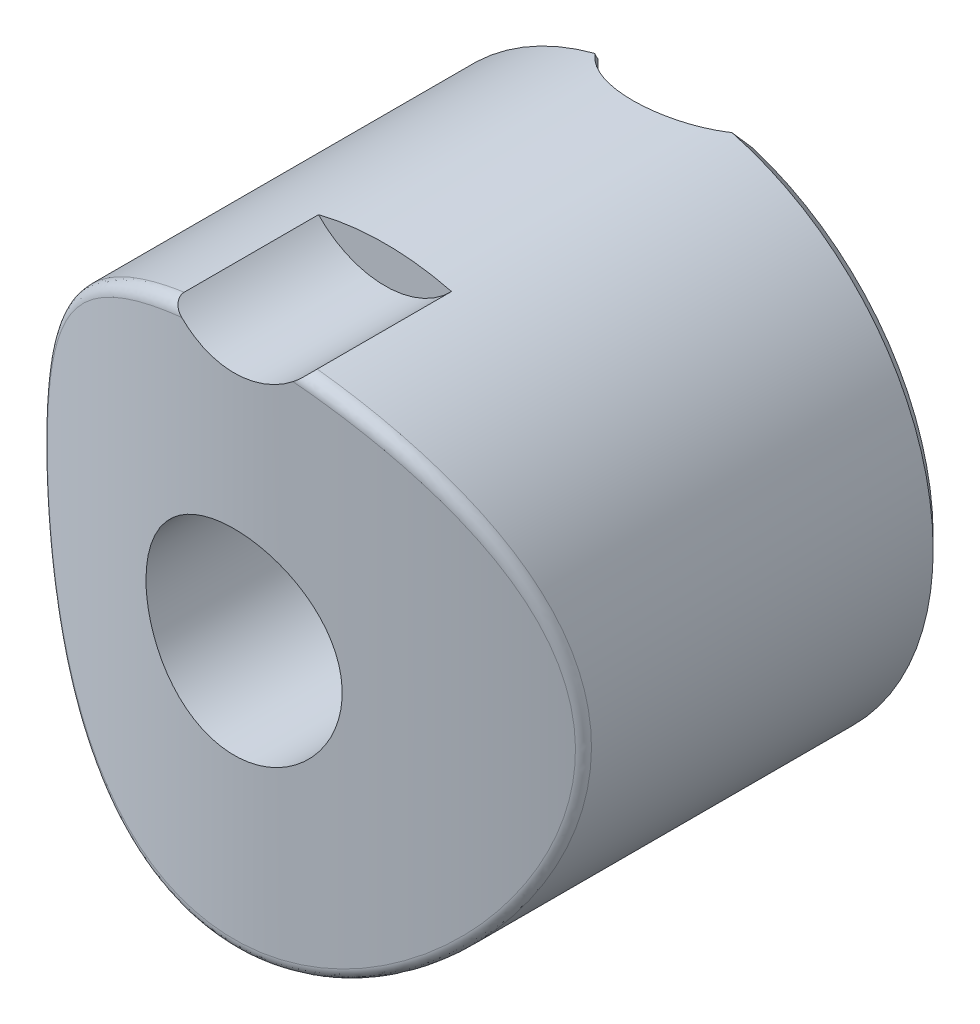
ISO-10303-21;
HEADER;
FILE_DESCRIPTION(('STEP AP214'),'2;1');
FILE_NAME('part.step','',(''),(''),'','','');
FILE_SCHEMA(('AUTOMOTIVE_DESIGN { 1 0 10303 214 1 1 1 1 }'));
ENDSEC;
DATA;
#1=APPLICATION_CONTEXT('core data for automotive mechanical design processes');
#2=APPLICATION_PROTOCOL_DEFINITION('international standard','automotive_design',2000,#1);
#3=PRODUCT_CONTEXT('',#1,'mechanical');
#4=PRODUCT('Part','Part','',(#3));
#5=PRODUCT_RELATED_PRODUCT_CATEGORY('part','',(#4));
#6=PRODUCT_DEFINITION_FORMATION('','',#4);
#7=PRODUCT_DEFINITION_CONTEXT('part definition',#1,'design');
#8=PRODUCT_DEFINITION('design','',#6,#7);
#9=PRODUCT_DEFINITION_SHAPE('','',#8);
#10=(LENGTH_UNIT() NAMED_UNIT(*) SI_UNIT(.MILLI.,.METRE.));
#11=(NAMED_UNIT(*) PLANE_ANGLE_UNIT() SI_UNIT($,.RADIAN.));
#12=(NAMED_UNIT(*) SI_UNIT($,.STERADIAN.) SOLID_ANGLE_UNIT());
#13=UNCERTAINTY_MEASURE_WITH_UNIT(LENGTH_MEASURE(1.E-05),#10,'distance_accuracy_value','');
#14=(GEOMETRIC_REPRESENTATION_CONTEXT(3) GLOBAL_UNCERTAINTY_ASSIGNED_CONTEXT((#13)) GLOBAL_UNIT_ASSIGNED_CONTEXT((#10,
#11,#12)) REPRESENTATION_CONTEXT('',''));
#15=CARTESIAN_POINT('',(0.,0.,0.));
#16=DIRECTION('',(0.,0.,1.));
#17=DIRECTION('',(1.,0.,0.));
#18=AXIS2_PLACEMENT_3D('',#15,#16,#17);
#19=CARTESIAN_POINT('',(0.,12.3245735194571,0.));
#20=DIRECTION('',(0.,-1.,0.));
#21=DIRECTION('',(1.,0.,0.));
#22=AXIS2_PLACEMENT_3D('',#19,#20,#21);
#23=TOROIDAL_SURFACE('',#22,11.,0.5);
#24=CARTESIAN_POINT('',(0.,12.7575862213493,0.));
#25=DIRECTION('',(0.,-1.,0.));
#26=DIRECTION('',(1.,0.,0.));
#27=AXIS2_PLACEMENT_3D('',#24,#25,#26);
#28=CIRCLE('',#27,11.25);
#29=CARTESIAN_POINT('',(10.5148704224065,12.7575862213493,4.));
#30=VERTEX_POINT('',#29);
#31=CARTESIAN_POINT('',(-10.5148704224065,12.7575862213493,4.));
#32=VERTEX_POINT('',#31);
#33=EDGE_CURVE('E309',#30,#32,#28,.T.);
#34=ORIENTED_EDGE('',*,*,#33,.F.);
#35=CARTESIAN_POINT('',(10.7819293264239,12.3245735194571,4.));
#36=CARTESIAN_POINT('',(10.7819599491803,12.3514174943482,4.));
#37=CARTESIAN_POINT('',(10.7796256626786,12.3782445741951,4.));
#38=CARTESIAN_POINT('',(10.7704634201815,12.4310647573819,4.));
#39=CARTESIAN_POINT('',(10.7636449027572,12.4570594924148,4.));
#40=CARTESIAN_POINT('',(10.7457496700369,12.5075305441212,4.));
#41=CARTESIAN_POINT('',(10.7346734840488,12.5320070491,4.));
#42=CARTESIAN_POINT('',(10.7086721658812,12.5788127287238,4.));
#43=CARTESIAN_POINT('',(10.6937471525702,12.6011419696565,4.));
#44=CARTESIAN_POINT('',(10.6601212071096,12.6436627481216,4.));
#45=CARTESIAN_POINT('',(10.6413351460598,12.6637868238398,4.));
#46=CARTESIAN_POINT('',(10.6008051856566,12.7008278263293,4.));
#47=CARTESIAN_POINT('',(10.5790582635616,12.7177414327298,4.));
#48=CARTESIAN_POINT('',(10.5318564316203,12.7489356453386,4.));
#49=CARTESIAN_POINT('',(10.5062574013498,12.7629976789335,4.));
#50=CARTESIAN_POINT('',(10.4532071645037,12.7869032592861,4.));
#51=CARTESIAN_POINT('',(10.4257590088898,12.7967535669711,4.));
#52=CARTESIAN_POINT('',(10.3977286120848,12.8044008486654,4.));
#53=B_SPLINE_CURVE_WITH_KNOTS('',3,(#35,#36,#37,#38,#39,#40,#41,#42,#43,#44,#45,#46,#47,#48,#49,
#50,#51,#52),.UNSPECIFIED.,.F.,.F.,(4,2,2,2,2,2,2,2,4),(0.,0.08040459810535,0.160640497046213,
0.240866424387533,0.321089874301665,0.403320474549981,0.485635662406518,0.57288452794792,
0.659992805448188),.UNSPECIFIED.);
#54=CARTESIAN_POINT('',(10.7819293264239,12.32457351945,4.));
#55=VERTEX_POINT('',#54);
#56=EDGE_CURVE('E23',#30,#55,#53,.F.);
#57=ORIENTED_EDGE('',*,*,#56,.T.);
#58=CARTESIAN_POINT('',(0.,12.3245735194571,0.));
#59=DIRECTION('',(0.,-1.,0.));
#60=DIRECTION('',(1.,0.,0.));
#61=AXIS2_PLACEMENT_3D('',#58,#59,#60);
#62=CIRCLE('',#61,11.5);
#63=CARTESIAN_POINT('',(-10.7819293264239,12.32457351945,4.));
#64=VERTEX_POINT('',#63);
#65=EDGE_CURVE('E310',#64,#55,#62,.F.);
#66=ORIENTED_EDGE('',*,*,#65,.F.);
#67=CARTESIAN_POINT('',(-10.5148704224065,12.7575862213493,4.));
#68=CARTESIAN_POINT('',(-10.5404948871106,12.7437849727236,4.));
#69=CARTESIAN_POINT('',(-10.5650083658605,12.7278775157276,4.));
#70=CARTESIAN_POINT('',(-10.6111455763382,12.6922112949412,4.));
#71=CARTESIAN_POINT('',(-10.6327619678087,12.672443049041,4.));
#72=CARTESIAN_POINT('',(-10.6723420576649,12.6294460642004,4.));
#73=CARTESIAN_POINT('',(-10.6902983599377,12.6062104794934,4.));
#74=CARTESIAN_POINT('',(-10.7217998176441,12.5569593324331,4.));
#75=CARTESIAN_POINT('',(-10.7353516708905,12.5309480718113,4.));
#76=CARTESIAN_POINT('',(-10.7569938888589,12.4781666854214,4.));
#77=CARTESIAN_POINT('',(-10.7653106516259,12.4514894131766,4.));
#78=CARTESIAN_POINT('',(-10.777125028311,12.3970688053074,4.));
#79=CARTESIAN_POINT('',(-10.7806205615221,12.3693250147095,4.));
#80=CARTESIAN_POINT('',(-10.78258261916,12.3148989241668,4.));
#81=CARTESIAN_POINT('',(-10.7812653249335,12.2882241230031,4.));
#82=CARTESIAN_POINT('',(-10.7741650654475,12.235459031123,4.));
#83=CARTESIAN_POINT('',(-10.7683793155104,12.2093691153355,4.));
#84=CARTESIAN_POINT('',(-10.7604034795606,12.1839601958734,4.));
#85=B_SPLINE_CURVE_WITH_KNOTS('',3,(#67,#68,#69,#70,#71,#72,#73,#74,#75,#76,#77,#78,#79,#80,#81,
#82,#83,#84),.UNSPECIFIED.,.F.,.F.,(4,2,2,2,2,2,2,2,4),(0.,0.08725320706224,0.174723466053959,
0.26236876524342,0.349880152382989,0.433285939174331,0.51672771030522,0.59646848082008,
0.676258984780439),.UNSPECIFIED.);
#86=EDGE_CURVE('E9',#64,#32,#85,.F.);
#87=ORIENTED_EDGE('',*,*,#86,.T.);
#88=EDGE_LOOP('',(#34,#57,#66,#87));
#89=FACE_BOUND('',#88,.T.);
#90=ADVANCED_FACE('F14',(#89),#23,.F.);
#91=CARTESIAN_POINT('',(0.,0.,4.));
#92=DIRECTION('',(0.,0.,1.));
#93=DIRECTION('',(1.,0.,0.));
#94=AXIS2_PLACEMENT_3D('',#91,#92,#93);
#95=PLANE('',#94);
#96=ORIENTED_EDGE('',*,*,#56,.F.);
#97=CARTESIAN_POINT('',(18.836315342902,8.13512148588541,4.));
#98=CARTESIAN_POINT('',(18.4403173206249,8.35875750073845,4.));
#99=CARTESIAN_POINT('',(18.044194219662,8.58217243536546,4.));
#100=CARTESIAN_POINT('',(17.2516316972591,9.02844286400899,4.));
#101=CARTESIAN_POINT('',(16.8551922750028,9.25129835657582,4.));
#102=CARTESIAN_POINT('',(16.0618756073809,9.69636365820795,4.));
#103=CARTESIAN_POINT('',(15.6649983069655,9.91857336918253,4.));
#104=CARTESIAN_POINT('',(14.8707731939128,10.3621496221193,4.));
#105=CARTESIAN_POINT('',(14.4734253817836,10.5835161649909,4.));
#106=CARTESIAN_POINT('',(13.6812328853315,11.0234695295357,4.));
#107=CARTESIAN_POINT('',(13.2863927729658,11.2420645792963,4.));
#108=CARTESIAN_POINT('',(12.4959735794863,11.6779142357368,4.));
#109=CARTESIAN_POINT('',(12.1003944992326,11.8951688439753,4.));
#110=CARTESIAN_POINT('',(11.3083115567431,12.3279068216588,4.));
#111=CARTESIAN_POINT('',(10.9118077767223,12.543390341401,4.));
#112=CARTESIAN_POINT('',(10.1175301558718,12.971999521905,4.));
#113=CARTESIAN_POINT('',(9.71975632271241,13.1851251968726,4.));
#114=CARTESIAN_POINT('',(8.88755187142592,13.6266737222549,4.));
#115=CARTESIAN_POINT('',(8.45296348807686,13.8548004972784,4.));
#116=CARTESIAN_POINT('',(7.79882864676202,14.1927252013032,4.));
#117=CARTESIAN_POINT('',(7.5803893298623,14.3046653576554,4.));
#118=CARTESIAN_POINT('',(7.14260348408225,14.5267556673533,4.));
#119=CARTESIAN_POINT('',(6.92325696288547,14.6369058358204,4.));
#120=CARTESIAN_POINT('',(6.48186791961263,14.8557426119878,4.));
#121=CARTESIAN_POINT('',(6.25981734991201,14.9644130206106,4.));
#122=CARTESIAN_POINT('',(5.81431268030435,15.1788318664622,4.));
#123=CARTESIAN_POINT('',(5.59085861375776,15.2845803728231,4.));
#124=CARTESIAN_POINT('',(5.14223089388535,15.4922558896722,4.));
#125=CARTESIAN_POINT('',(4.91705761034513,15.594183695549,4.));
#126=CARTESIAN_POINT('',(4.46450497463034,15.7929964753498,4.));
#127=CARTESIAN_POINT('',(4.23712577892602,15.8898818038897,4.));
#128=CARTESIAN_POINT('',(3.75562365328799,16.0866660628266,4.));
#129=CARTESIAN_POINT('',(3.50119232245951,16.1858191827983,4.));
#130=CARTESIAN_POINT('',(2.98798112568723,16.372483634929,4.));
#131=CARTESIAN_POINT('',(2.72920034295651,16.4599924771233,4.));
#132=CARTESIAN_POINT('',(2.20967828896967,16.6174701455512,4.));
#133=CARTESIAN_POINT('',(1.94900091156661,16.6876426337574,4.));
#134=CARTESIAN_POINT('',(1.55426783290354,16.7761475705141,4.));
#135=CARTESIAN_POINT('',(1.42208422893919,16.8028550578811,4.));
#136=CARTESIAN_POINT('',(1.15659501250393,16.8498784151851,4.));
#137=CARTESIAN_POINT('',(1.02328964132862,16.8701956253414,4.));
#138=CARTESIAN_POINT('',(0.777546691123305,16.9009954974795,4.));
#139=CARTESIAN_POINT('',(0.665242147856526,16.9125403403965,4.));
#140=CARTESIAN_POINT('',(0.440224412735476,16.9303223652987,4.));
#141=CARTESIAN_POINT('',(0.327511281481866,16.9365603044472,4.));
#142=CARTESIAN_POINT('',(0.101938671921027,16.9435408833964,4.));
#143=CARTESIAN_POINT('',(-0.0109207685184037,16.9442847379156,4.));
#144=CARTESIAN_POINT('',(-0.236541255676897,16.9402574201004,4.));
#145=CARTESIAN_POINT('',(-0.349302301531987,16.9354861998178,4.));
#146=CARTESIAN_POINT('',(-0.575436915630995,16.9205102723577,4.));
#147=CARTESIAN_POINT('',(-0.688807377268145,16.9102590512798,4.));
#148=CARTESIAN_POINT('',(-0.914963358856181,16.8845945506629,4.));
#149=CARTESIAN_POINT('',(-1.02774884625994,16.8691809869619,4.));
#150=CARTESIAN_POINT('',(-1.25258715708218,16.8335978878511,4.));
#151=CARTESIAN_POINT('',(-1.36463981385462,16.8134273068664,4.));
#152=CARTESIAN_POINT('',(-1.5878697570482,16.768803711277,4.));
#153=CARTESIAN_POINT('',(-1.69904712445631,16.7443510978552,4.));
#154=CARTESIAN_POINT('',(-2.01931978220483,16.6681312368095,4.));
#155=CARTESIAN_POINT('',(-2.2272532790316,16.6114626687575,4.));
#156=CARTESIAN_POINT('',(-2.63999206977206,16.4876108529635,4.));
#157=CARTESIAN_POINT('',(-2.84479594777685,16.4204229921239,4.));
#158=CARTESIAN_POINT('',(-3.25192390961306,16.2779512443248,4.));
#159=CARTESIAN_POINT('',(-3.454243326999,16.2026541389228,4.));
#160=CARTESIAN_POINT('',(-3.85646701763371,16.0459968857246,4.));
#161=CARTESIAN_POINT('',(-4.05637163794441,15.9646376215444,4.));
#162=CARTESIAN_POINT('',(-4.45527838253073,15.7968274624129,4.));
#163=CARTESIAN_POINT('',(-4.65426999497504,15.7103517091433,4.));
#164=CARTESIAN_POINT('',(-5.05063537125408,15.5337696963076,4.));
#165=CARTESIAN_POINT('',(-5.2480090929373,15.4436633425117,4.));
#166=CARTESIAN_POINT('',(-5.64125207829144,15.2606934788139,4.));
#167=CARTESIAN_POINT('',(-5.83712254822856,15.1678325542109,4.));
#168=CARTESIAN_POINT('',(-6.22777886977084,14.9798534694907,4.));
#169=CARTESIAN_POINT('',(-6.42256470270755,14.8847352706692,4.));
#170=CARTESIAN_POINT('',(-7.01504252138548,14.5920144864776,4.));
#171=CARTESIAN_POINT('',(-7.41131419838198,14.3915391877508,4.));
#172=CARTESIAN_POINT('',(-8.20136712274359,13.9855755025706,4.));
#173=CARTESIAN_POINT('',(-8.59514784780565,13.7800861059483,4.));
#174=CARTESIAN_POINT('',(-9.37949525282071,13.3663624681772,4.));
#175=CARTESIAN_POINT('',(-9.77006836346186,13.1581404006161,4.));
#176=CARTESIAN_POINT('',(-10.5498505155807,12.7392265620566,4.));
#177=CARTESIAN_POINT('',(-10.9390596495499,12.5285349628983,4.));
#178=CARTESIAN_POINT('',(-11.7467507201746,12.0888234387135,4.));
#179=CARTESIAN_POINT('',(-12.1651513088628,11.8596542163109,4.));
#180=CARTESIAN_POINT('',(-13.0010702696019,11.3997116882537,4.));
#181=CARTESIAN_POINT('',(-13.4185886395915,11.1689383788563,4.));
#182=CARTESIAN_POINT('',(-14.6701419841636,10.4747955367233,4.));
#183=CARTESIAN_POINT('',(-15.5031677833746,10.0096071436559,4.));
#184=CARTESIAN_POINT('',(-17.1675846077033,9.07621359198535,4.));
#185=CARTESIAN_POINT('',(-17.9989755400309,8.60800826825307,4.));
#186=CARTESIAN_POINT('',(-19.6606207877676,7.66959589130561,4.));
#187=CARTESIAN_POINT('',(-20.4908751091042,7.19938884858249,4.));
#188=CARTESIAN_POINT('',(-22.1519371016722,6.25681713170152,4.));
#189=CARTESIAN_POINT('',(-22.9827434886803,5.78445019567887,4.));
#190=CARTESIAN_POINT('',(-24.6437778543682,4.83869824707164,4.));
#191=CARTESIAN_POINT('',(-25.4740058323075,4.365313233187,4.));
#192=CARTESIAN_POINT('',(-27.9640081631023,2.94405927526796,4.));
#193=CARTESIAN_POINT('',(-29.623141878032,1.99506813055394,4.));
#194=CARTESIAN_POINT('',(-32.7639947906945,0.196327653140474,4.));
#195=CARTESIAN_POINT('',(-34.2458166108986,-0.653242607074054,4.));
#196=CARTESIAN_POINT('',(-37.2089125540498,-2.35336403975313,4.));
#197=CARTESIAN_POINT('',(-38.6901866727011,-3.20391521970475,4.));
#198=CARTESIAN_POINT('',(-41.6499849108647,-4.90434600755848,4.));
#199=CARTESIAN_POINT('',(-43.128509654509,-5.75422452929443,4.));
#200=CARTESIAN_POINT('',(-46.0852531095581,-7.454486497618,4.));
#201=CARTESIAN_POINT('',(-47.5634718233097,-8.30486994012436,4.));
#202=CARTESIAN_POINT('',(-49.0415918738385,-9.15542472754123,4.));
#203=B_SPLINE_CURVE_WITH_KNOTS('',3,(#97,#98,#99,#100,#101,#102,#103,#104,#105,#106,#107,#108,
#109,#110,#111,#112,#113,#114,#115,#116,#117,#118,#119,#120,#121,#122,#123,#124,#125,#126,#127,
#128,#129,#130,#131,#132,#133,#134,#135,#136,#137,#138,#139,#140,#141,#142,#143,#144,#145,#146,
#147,#148,#149,#150,#151,#152,#153,#154,#155,#156,#157,#158,#159,#160,#161,#162,#163,#164,#165,
#166,#167,#168,#169,#170,#171,#172,#173,#174,#175,#176,#177,#178,#179,#180,#181,#182,#183,#184,
#185,#186,#187,#188,#189,#190,#191,#192,#193,#194,#195,#196,#197,#198,#199,#200,#201,#202),
.UNSPECIFIED.,.F.,.F.,(4,2,2,2,2,2,2,2,2,2,2,2,2,2,2,2,2,2,2,2,2,2,2,2,2,2,2,2,2,2,2,2,2,2,2,2,
2,2,2,2,2,2,2,2,2,2,2,2,2,2,2,2,4),(0.,1.36434897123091,2.72870147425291,4.09325138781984,
5.45779982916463,6.81173376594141,8.16566612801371,9.51948238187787,10.8732904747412,
12.3457310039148,13.0820786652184,13.8184201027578,14.5600514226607,15.3016651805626,
16.0431236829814,16.7845299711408,17.6035301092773,18.422705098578,19.2317425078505,
19.6361792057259,20.0405310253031,20.3791044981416,20.7176296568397,21.056079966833,
21.3945332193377,21.7359059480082,22.077297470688,22.4187641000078,22.7601987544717,
23.4063452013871,24.0527758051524,24.7002765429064,25.3476830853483,25.9985450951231,
26.6494240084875,27.299710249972,27.9500076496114,29.2822341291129,30.6147312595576,
31.942548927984,33.2702747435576,34.7014227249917,36.132574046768,38.9949020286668,
41.8573880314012,44.7198590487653,47.586969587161,50.4540837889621,56.1881708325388,
61.3124352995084,66.4367391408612,71.5528860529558,76.6689921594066),.UNSPECIFIED.);
#204=CARTESIAN_POINT('',(6.34428877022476,14.9226497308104,4.));
#205=VERTEX_POINT('',#204);
#206=EDGE_CURVE('E298',#30,#205,#203,.T.);
#207=ORIENTED_EDGE('',*,*,#206,.T.);
#208=DIRECTION('',(0.,-1.,0.));
#209=VECTOR('',#208,1.);
#210=CARTESIAN_POINT('',(6.34428877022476,30.,4.));
#211=LINE('',#210,#209);
#212=CARTESIAN_POINT('',(6.34428877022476,20.0187412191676,4.));
#213=VERTEX_POINT('',#212);
#214=EDGE_CURVE('E288',#213,#205,#211,.T.);
#215=ORIENTED_EDGE('',*,*,#214,.F.);
#216=CARTESIAN_POINT('',(0.,0.,4.));
#217=DIRECTION('',(0.,0.,1.));
#218=DIRECTION('',(1.,0.,0.));
#219=AXIS2_PLACEMENT_3D('',#216,#217,#218);
#220=CIRCLE('',#219,21.);
#221=CARTESIAN_POINT('',(10.7819293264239,-18.0208212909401,4.));
#222=VERTEX_POINT('',#221);
#223=EDGE_CURVE('E113',#213,#222,#220,.F.);
#224=ORIENTED_EDGE('',*,*,#223,.T.);
#225=DIRECTION('',(0.,-1.,0.));
#226=VECTOR('',#225,1.);
#227=CARTESIAN_POINT('',(10.7819293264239,0.,4.));
#228=LINE('',#227,#226);
#229=EDGE_CURVE('E96',#222,#55,#228,.F.);
#230=ORIENTED_EDGE('',*,*,#229,.T.);
#231=EDGE_LOOP('',(#96,#207,#215,#224,#230));
#232=FACE_BOUND('',#231,.T.);
#233=ADVANCED_FACE('F337',(#232),#95,.F.);
#234=CARTESIAN_POINT('',(0.,0.,4.));
#235=DIRECTION('',(0.,0.,1.));
#236=DIRECTION('',(1.,0.,0.));
#237=AXIS2_PLACEMENT_3D('',#234,#235,#236);
#238=CONICAL_SURFACE('',#237,21.,0.785398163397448);
#239=CARTESIAN_POINT('',(-8.51859594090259,-23.2117303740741,7.72551119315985));
#240=CARTESIAN_POINT('',(-8.61316162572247,-23.0659435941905,7.62123206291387));
#241=CARTESIAN_POINT('',(-8.70500830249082,-22.919017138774,7.51611494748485));
#242=CARTESIAN_POINT('',(-8.88344211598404,-22.6231058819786,7.30435778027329));
#243=CARTESIAN_POINT('',(-8.97002972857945,-22.4741212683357,7.197717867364));
#244=CARTESIAN_POINT('',(-9.2221241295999,-22.0245008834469,6.87580735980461));
#245=CARTESIAN_POINT('',(-9.38004365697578,-21.7210725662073,6.65845587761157));
#246=CARTESIAN_POINT('',(-9.67650868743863,-21.1089710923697,6.21973549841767));
#247=CARTESIAN_POINT('',(-9.81509640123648,-20.8003110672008,5.99837658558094));
#248=CARTESIAN_POINT('',(-10.0743598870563,-20.1782168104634,5.55192767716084));
#249=CARTESIAN_POINT('',(-10.1950356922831,-19.8647825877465,5.32683768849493));
#250=CARTESIAN_POINT('',(-10.4051162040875,-19.27406300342,4.9022762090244));
#251=CARTESIAN_POINT('',(-10.4965457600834,-18.9972288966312,4.70317204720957));
#252=CARTESIAN_POINT('',(-10.6668675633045,-18.4411878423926,4.3029334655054));
#253=CARTESIAN_POINT('',(-10.7457600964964,-18.1619809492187,4.10179909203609));
#254=CARTESIAN_POINT('',(-10.8614193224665,-17.7169981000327,3.78094260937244));
#255=CARTESIAN_POINT('',(-10.9021595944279,-17.5518350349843,3.66178583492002));
#256=CARTESIAN_POINT('',(-10.9794967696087,-17.2209489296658,3.42292409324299));
#257=CARTESIAN_POINT('',(-11.0160938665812,-17.0552259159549,3.30321915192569));
#258=CARTESIAN_POINT('',(-11.1061536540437,-16.6226839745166,2.99057907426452));
#259=CARTESIAN_POINT('',(-11.1563923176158,-16.355477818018,2.79723896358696));
#260=CARTESIAN_POINT('',(-11.2239921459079,-15.9539843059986,2.50637324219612));
#261=CARTESIAN_POINT('',(-11.2452334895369,-15.8200306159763,2.40926925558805));
#262=CARTESIAN_POINT('',(-11.28514976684,-15.5519154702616,2.21477987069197));
#263=CARTESIAN_POINT('',(-11.3038243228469,-15.4177539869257,2.11739443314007));
#264=CARTESIAN_POINT('',(-11.3686895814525,-14.9172712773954,1.75383885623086));
#265=CARTESIAN_POINT('',(-11.4066561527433,-14.5504452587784,1.48684591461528));
#266=CARTESIAN_POINT('',(-11.4637531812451,-13.816440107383,0.951263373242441));
#267=CARTESIAN_POINT('',(-11.4828810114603,-13.4492609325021,0.682673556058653));
#268=CARTESIAN_POINT('',(-11.5022563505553,-12.7152886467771,0.144043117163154));
#269=CARTESIAN_POINT('',(-11.5024981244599,-12.348495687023,-0.125997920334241));
#270=CARTESIAN_POINT('',(-11.4838154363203,-11.6163042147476,-0.667342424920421));
#271=CARTESIAN_POINT('',(-11.4648903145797,-11.2509057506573,-0.938645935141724));
#272=CARTESIAN_POINT('',(-11.4071345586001,-10.5202504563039,-1.48426170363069));
#273=CARTESIAN_POINT('',(-11.3681764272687,-10.1550097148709,-1.7585820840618));
#274=CARTESIAN_POINT('',(-11.2693526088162,-9.42849337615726,-2.30863798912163));
#275=CARTESIAN_POINT('',(-11.2094909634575,-9.06721702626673,-2.58437323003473));
#276=CARTESIAN_POINT('',(-11.1028560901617,-8.52965013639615,-2.99949716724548));
#277=CARTESIAN_POINT('',(-11.0644863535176,-8.35111904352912,-3.13817809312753));
#278=CARTESIAN_POINT('',(-10.9818519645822,-7.99589658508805,-3.4161309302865));
#279=CARTESIAN_POINT('',(-10.9375876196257,-7.8192051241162,-3.5554028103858));
#280=CARTESIAN_POINT('',(-10.8428012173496,-7.46796388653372,-3.83477054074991));
#281=CARTESIAN_POINT('',(-10.7922751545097,-7.2934155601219,-3.97486686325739));
#282=CARTESIAN_POINT('',(-10.6845064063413,-6.9471579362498,-4.25604158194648));
#283=CARTESIAN_POINT('',(-10.6272625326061,-6.77544914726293,-4.39712014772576));
#284=CARTESIAN_POINT('',(-10.5664278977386,-6.60548199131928,-4.5387885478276));
#285=B_SPLINE_CURVE_WITH_KNOTS('',3,(#239,#240,#241,#242,#243,#244,#245,#246,#247,#248,#249,
#250,#251,#252,#253,#254,#255,#256,#257,#258,#259,#260,#261,#262,#263,#264,#265,#266,#267,#268,
#269,#270,#271,#272,#273,#274,#275,#276,#277,#278,#279,#280,#281,#282,#283,#284),.UNSPECIFIED.,
.F.,.F.,(4,2,2,2,2,2,2,2,2,2,2,2,2,2,2,2,2,2,2,2,2,2,4),(0.,0.607922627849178,1.21579016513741,
2.43100131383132,3.64351608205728,4.85602860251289,5.91492165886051,6.97379055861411,
7.59683491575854,8.2198501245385,9.22052142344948,9.72092022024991,10.2213925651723,
11.5868177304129,12.9524332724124,14.3184634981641,15.6845407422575,17.0594218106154,
18.4340371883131,19.1218656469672,19.8096582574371,20.4978931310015,21.1862499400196),.UNSPECIFIED.);
#286=CARTESIAN_POINT('',(-10.356157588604,-19.4100489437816,5.));
#287=VERTEX_POINT('',#286);
#288=CARTESIAN_POINT('',(-10.7819293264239,-18.0208212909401,4.));
#289=VERTEX_POINT('',#288);
#290=EDGE_CURVE('E99',#287,#289,#285,.T.);
#291=ORIENTED_EDGE('',*,*,#290,.F.);
#292=CARTESIAN_POINT('',(0.,0.,5.));
#293=DIRECTION('',(0.,0.,1.));
#294=DIRECTION('',(1.,0.,0.));
#295=AXIS2_PLACEMENT_3D('',#292,#293,#294);
#296=CIRCLE('',#295,22.);
#297=CARTESIAN_POINT('',(-5.59016994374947,21.2779228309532,5.));
#298=VERTEX_POINT('',#297);
#299=EDGE_CURVE('E162',#298,#287,#296,.T.);
#300=ORIENTED_EDGE('',*,*,#299,.F.);
#301=CARTESIAN_POINT('',(-6.34428877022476,20.0187412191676,4.));
#302=CARTESIAN_POINT('',(-6.2899565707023,20.1263514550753,4.08616868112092));
#303=CARTESIAN_POINT('',(-6.23357027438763,20.2334303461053,4.17171602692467));
#304=CARTESIAN_POINT('',(-6.11662936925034,20.4462295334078,4.3413661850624));
#305=CARTESIAN_POINT('',(-6.05607923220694,20.5519511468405,4.42547042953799));
#306=CARTESIAN_POINT('',(-5.93063483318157,20.7619704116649,4.59221696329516));
#307=CARTESIAN_POINT('',(-5.86574048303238,20.8662680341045,4.67485922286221));
#308=CARTESIAN_POINT('',(-5.73139646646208,21.0733298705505,4.83862670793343));
#309=CARTESIAN_POINT('',(-5.66194204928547,21.1760923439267,4.91975023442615));
#310=CARTESIAN_POINT('',(-5.59016994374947,21.2779228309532,5.));
#311=B_SPLINE_CURVE_WITH_KNOTS('',3,(#301,#302,#303,#304,#305,#306,#307,#308,#309,#310),
.UNSPECIFIED.,.F.,.F.,(4,2,2,2,4),(0.,0.444528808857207,0.888587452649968,1.332655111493,
1.7771929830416),.UNSPECIFIED.);
#312=CARTESIAN_POINT('',(-6.34428877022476,20.0187412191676,4.));
#313=VERTEX_POINT('',#312);
#314=EDGE_CURVE('E111',#313,#298,#311,.T.);
#315=ORIENTED_EDGE('',*,*,#314,.F.);
#316=EDGE_CURVE('E92',#289,#313,#220,.F.);
#317=ORIENTED_EDGE('',*,*,#316,.F.);
#318=EDGE_LOOP('',(#291,#300,#315,#317));
#319=FACE_BOUND('',#318,.T.);
#320=ADVANCED_FACE('F110',(#319),#238,.T.);
#321=CARTESIAN_POINT('',(0.,0.,0.));
#322=DIRECTION('',(0.,-1.,0.));
#323=DIRECTION('',(1.,0.,0.));
#324=AXIS2_PLACEMENT_3D('',#321,#322,#323);
#325=CYLINDRICAL_SURFACE('',#324,11.5);
#326=DIRECTION('',(0.,-1.,0.));
#327=VECTOR('',#326,1.);
#328=CARTESIAN_POINT('',(-10.7819293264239,0.,4.));
#329=LINE('',#328,#327);
#330=EDGE_CURVE('E87',#64,#289,#329,.T.);
#331=ORIENTED_EDGE('',*,*,#330,.F.);
#332=ORIENTED_EDGE('',*,*,#65,.T.);
#333=ORIENTED_EDGE('',*,*,#229,.F.);
#334=CARTESIAN_POINT('',(10.5664278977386,-6.60548199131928,-4.53878854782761));
#335=CARTESIAN_POINT('',(10.6174596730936,-6.74802005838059,-4.41996505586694));
#336=CARTESIAN_POINT('',(10.665952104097,-6.89179538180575,-4.3015677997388));
#337=CARTESIAN_POINT('',(10.7581554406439,-7.18142263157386,-4.06548759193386));
#338=CARTESIAN_POINT('',(10.8018669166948,-7.3272743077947,-3.94780455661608));
#339=CARTESIAN_POINT('',(10.9262492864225,-7.76724455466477,-3.59570056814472));
#340=CARTESIAN_POINT('',(11.0002211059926,-8.06392892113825,-3.36210019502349));
#341=CARTESIAN_POINT('',(11.1318454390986,-8.66179990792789,-2.89662415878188));
#342=CARTESIAN_POINT('',(11.1895102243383,-8.96298296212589,-2.66474732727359));
#343=CARTESIAN_POINT('',(11.2896718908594,-9.56877214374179,-2.20211731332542));
#344=CARTESIAN_POINT('',(11.3321666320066,-9.87337874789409,-1.97136429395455));
#345=CARTESIAN_POINT('',(11.4024946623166,-10.4831532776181,-1.51219392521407));
#346=CARTESIAN_POINT('',(11.4304136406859,-10.7883070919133,-1.28377084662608));
#347=CARTESIAN_POINT('',(11.4724513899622,-11.4002046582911,-0.827809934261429));
#348=CARTESIAN_POINT('',(11.4865705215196,-11.706948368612,-0.600272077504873));
#349=CARTESIAN_POINT('',(11.5013155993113,-12.3213672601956,-0.146113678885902));
#350=CARTESIAN_POINT('',(11.5019433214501,-12.6290423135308,0.0805069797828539));
#351=CARTESIAN_POINT('',(11.4898785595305,-13.2448070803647,0.532784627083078));
#352=CARTESIAN_POINT('',(11.47718731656,-13.5528967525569,0.758441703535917));
#353=CARTESIAN_POINT('',(11.4504200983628,-13.9795789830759,1.07025553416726));
#354=CARTESIAN_POINT('',(11.4419936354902,-14.0982100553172,1.15687406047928));
#355=CARTESIAN_POINT('',(11.4231715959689,-14.335422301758,1.3299349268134));
#356=CARTESIAN_POINT('',(11.4127762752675,-14.4540034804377,1.41637728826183));
#357=CARTESIAN_POINT('',(11.3786265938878,-14.8096967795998,1.6754744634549));
#358=CARTESIAN_POINT('',(11.3519111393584,-15.046716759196,1.84786875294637));
#359=CARTESIAN_POINT('',(11.2647799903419,-15.7190322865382,2.33624702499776));
#360=CARTESIAN_POINT('',(11.1948976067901,-16.153797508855,2.65132144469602));
#361=CARTESIAN_POINT('',(11.027625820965,-17.0204043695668,3.27821922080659));
#362=CARTESIAN_POINT('',(10.9302360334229,-17.4522459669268,3.59004253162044));
#363=CARTESIAN_POINT('',(10.745747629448,-18.1620219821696,4.10182841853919));
#364=CARTESIAN_POINT('',(10.6668496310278,-18.4412498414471,4.30297806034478));
#365=CARTESIAN_POINT('',(10.4965277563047,-18.9972842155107,4.70321189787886));
#366=CARTESIAN_POINT('',(10.405106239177,-19.2740911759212,4.90229647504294));
#367=CARTESIAN_POINT('',(10.1950557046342,-19.8647261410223,5.32679709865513));
#368=CARTESIAN_POINT('',(10.0744037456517,-20.1781028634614,5.5518458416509));
#369=CARTESIAN_POINT('',(9.81519472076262,-20.8000838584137,5.99821358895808));
#370=CARTESIAN_POINT('',(9.67663768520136,-21.1086881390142,6.2195325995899));
#371=CARTESIAN_POINT('',(9.38018712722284,-21.7207929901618,6.65825558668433));
#372=CARTESIAN_POINT('',(9.22224441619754,-22.0242782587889,6.87564792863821));
#373=CARTESIAN_POINT('',(8.97010957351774,-22.4739829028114,7.19761882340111));
#374=CARTESIAN_POINT('',(8.88350735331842,-22.6229956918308,7.30427891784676));
#375=CARTESIAN_POINT('',(8.70504239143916,-22.9189626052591,7.51607593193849));
#376=CARTESIAN_POINT('',(8.61317917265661,-23.0659165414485,7.6212127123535));
#377=CARTESIAN_POINT('',(8.51859594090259,-23.2117303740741,7.72551119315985));
#378=B_SPLINE_CURVE_WITH_KNOTS('',3,(#334,#335,#336,#337,#338,#339,#340,#341,#342,#343,#344,
#345,#346,#347,#348,#349,#350,#351,#352,#353,#354,#355,#356,#357,#358,#359,#360,#361,#362,#363,
#364,#365,#366,#367,#368,#369,#370,#371,#372,#373,#374,#375,#376,#377),.UNSPECIFIED.,.F.,.F.,(4,
2,2,2,2,2,2,2,2,2,2,2,2,2,2,2,2,2,2,2,2,4),(0.,0.577322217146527,1.15457546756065,
2.30847532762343,3.46150450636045,4.6146962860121,5.7610299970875,6.90733374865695,
8.05348660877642,9.19953267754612,9.64091170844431,10.0822334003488,10.9650326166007,
12.5886782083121,14.2123465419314,15.2713271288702,16.3301084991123,17.5424001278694,
18.7546897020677,19.9701214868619,20.578101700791,21.1861371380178),.UNSPECIFIED.);
#379=CARTESIAN_POINT('',(10.356157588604,-19.4100489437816,5.));
#380=VERTEX_POINT('',#379);
#381=EDGE_CURVE('E108',#222,#380,#378,.T.);
#382=ORIENTED_EDGE('',*,*,#381,.T.);
#383=CARTESIAN_POINT('',(-10.356157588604,-19.4100489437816,5.));
#384=CARTESIAN_POINT('',(-10.2106169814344,-19.4877014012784,5.3014459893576));
#385=CARTESIAN_POINT('',(-10.0524283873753,-19.5700021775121,5.59548066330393));
#386=CARTESIAN_POINT('',(-9.71214006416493,-19.7410882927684,6.1672500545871));
#387=CARTESIAN_POINT('',(-9.53004874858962,-19.8298713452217,6.44499045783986));
#388=CARTESIAN_POINT('',(-9.14293015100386,-20.0113116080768,6.98333256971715));
#389=CARTESIAN_POINT('',(-8.93786708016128,-20.1039747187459,7.24390650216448));
#390=CARTESIAN_POINT('',(-8.50622602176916,-20.290376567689,7.74621077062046));
#391=CARTESIAN_POINT('',(-8.27964593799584,-20.3841154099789,7.98793926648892));
#392=CARTESIAN_POINT('',(-7.80627939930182,-20.5700419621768,8.4511302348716));
#393=CARTESIAN_POINT('',(-7.55950272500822,-20.6622303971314,8.67260240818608));
#394=CARTESIAN_POINT('',(-7.04687681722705,-20.8426328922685,9.09404265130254));
#395=CARTESIAN_POINT('',(-6.78102866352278,-20.9308471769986,9.29401193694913));
#396=CARTESIAN_POINT('',(-6.23174586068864,-21.1008991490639,9.67089510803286));
#397=CARTESIAN_POINT('',(-5.94832086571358,-21.1827402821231,9.84782148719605));
#398=CARTESIAN_POINT('',(-5.3653357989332,-21.3378567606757,10.1771921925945));
#399=CARTESIAN_POINT('',(-5.06577622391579,-21.4111323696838,10.3296372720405));
#400=CARTESIAN_POINT('',(-4.45870150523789,-21.5456408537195,10.6056050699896));
#401=CARTESIAN_POINT('',(-4.1514748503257,-21.6070895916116,10.729656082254));
#402=CARTESIAN_POINT('',(-3.52549977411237,-21.7180077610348,10.9513047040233));
#403=CARTESIAN_POINT('',(-3.20675142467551,-21.7674772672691,11.0489024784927));
#404=CARTESIAN_POINT('',(-2.56048290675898,-21.8529194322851,11.2162947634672));
#405=CARTESIAN_POINT('',(-2.2329687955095,-21.8889011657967,11.2861079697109));
#406=CARTESIAN_POINT('',(-1.57186140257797,-21.9462818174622,11.3969973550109));
#407=CARTESIAN_POINT('',(-1.23826884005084,-21.967682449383,11.4380769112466));
#408=CARTESIAN_POINT('',(-0.604670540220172,-21.9937198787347,11.4879978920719));
#409=CARTESIAN_POINT('',(-0.304963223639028,-21.9999284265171,11.4998628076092));
#410=CARTESIAN_POINT('',(0.294450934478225,-22.000070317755,11.5001347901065));
#411=CARTESIAN_POINT('',(0.594157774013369,-21.9940046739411,11.4885437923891));
#412=CARTESIAN_POINT('',(1.19120387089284,-21.9697586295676,11.4420576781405));
#413=CARTESIAN_POINT('',(1.48854352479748,-21.9515803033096,11.4071665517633));
#414=CARTESIAN_POINT('',(2.07867936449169,-21.9035781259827,11.3145173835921));
#415=CARTESIAN_POINT('',(2.37147552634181,-21.8737542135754,11.2567592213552));
#416=CARTESIAN_POINT('',(2.93951899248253,-21.8045408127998,11.1216558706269));
#417=CARTESIAN_POINT('',(3.21501167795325,-21.7655544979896,11.0451315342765));
#418=CARTESIAN_POINT('',(3.75820305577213,-21.6783665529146,10.8723107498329));
#419=CARTESIAN_POINT('',(4.02590202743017,-21.6301652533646,10.7760150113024));
#420=CARTESIAN_POINT('',(4.55208435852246,-21.5255776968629,10.5645133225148));
#421=CARTESIAN_POINT('',(4.81056686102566,-21.469190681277,10.4493056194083));
#422=CARTESIAN_POINT('',(5.31713131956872,-21.3493768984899,10.2008694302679));
#423=CARTESIAN_POINT('',(5.56520928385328,-21.2859474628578,10.0676341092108));
#424=CARTESIAN_POINT('',(6.06780710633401,-21.1483933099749,9.7735695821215));
#425=CARTESIAN_POINT('',(6.32143646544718,-21.0738241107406,9.61142577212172));
#426=CARTESIAN_POINT('',(6.81429204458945,-20.9196591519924,9.26852752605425));
#427=CARTESIAN_POINT('',(7.05351270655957,-20.8400614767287,9.08776598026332));
#428=CARTESIAN_POINT('',(7.51648243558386,-20.6775882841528,8.70872922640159));
#429=CARTESIAN_POINT('',(7.74023143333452,-20.5947127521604,8.51045393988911));
#430=CARTESIAN_POINT('',(8.17128387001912,-20.427521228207,8.09748635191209));
#431=CARTESIAN_POINT('',(8.37858881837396,-20.3432053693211,7.8827955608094));
#432=CARTESIAN_POINT('',(8.9322761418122,-20.1087717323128,7.26278627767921));
#433=CARTESIAN_POINT('',(9.25997495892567,-19.9589972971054,6.84021154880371));
#434=CARTESIAN_POINT('',(9.70600022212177,-19.7438836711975,6.17374415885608));
#435=CARTESIAN_POINT('',(9.84706254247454,-19.6737846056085,5.94620691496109));
#436=CARTESIAN_POINT('',(10.1135202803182,-19.5381413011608,5.48074076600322));
#437=CARTESIAN_POINT('',(10.238910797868,-19.4725984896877,5.24280864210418));
#438=CARTESIAN_POINT('',(10.356157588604,-19.4100489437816,5.));
#439=B_SPLINE_CURVE_WITH_KNOTS('',3,(#383,#384,#385,#386,#387,#388,#389,#390,#391,#392,#393,
#394,#395,#396,#397,#398,#399,#400,#401,#402,#403,#404,#405,#406,#407,#408,#409,#410,#411,#412,
#413,#414,#415,#416,#417,#418,#419,#420,#421,#422,#423,#424,#425,#426,#427,#428,#429,#430,#431,
#432,#433,#434,#435,#436,#437,#438),.UNSPECIFIED.,.F.,.F.,(4,2,2,2,2,2,2,2,2,2,2,2,2,2,2,2,2,2,
2,2,2,2,2,2,2,2,2,4),(0.,1.03041421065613,2.06046669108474,3.09214686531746,4.12392765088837,
5.1552116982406,6.18643740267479,7.21710163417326,8.24773414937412,9.25726367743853,
10.2667869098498,11.2756296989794,12.2843538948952,13.1832310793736,14.0820341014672,
14.980683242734,15.8793371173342,16.744099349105,17.6088305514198,18.4736419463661,
19.3387821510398,20.2681914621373,21.1979570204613,22.1277267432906,23.0574110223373,
24.7174599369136,25.5471253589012,26.3770495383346),.UNSPECIFIED.);
#440=EDGE_CURVE('E103',#287,#380,#439,.T.);
#441=ORIENTED_EDGE('',*,*,#440,.F.);
#442=ORIENTED_EDGE('',*,*,#290,.T.);
#443=EDGE_LOOP('',(#331,#332,#333,#382,#441,#442));
#444=FACE_BOUND('',#443,.T.);
#445=CARTESIAN_POINT('',(-10.5,0.,4.69041575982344));
#446=CARTESIAN_POINT('',(-10.4999991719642,0.150856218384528,4.69041893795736));
#447=CARTESIAN_POINT('',(-10.496737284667,0.3017325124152,4.69774054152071));
#448=CARTESIAN_POINT('',(-10.4838140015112,0.601853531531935,4.72650837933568));
#449=CARTESIAN_POINT('',(-10.4741509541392,0.751097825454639,4.74795825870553));
#450=CARTESIAN_POINT('',(-10.448716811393,1.04712484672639,4.80367010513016));
#451=CARTESIAN_POINT('',(-10.4329253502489,1.19389764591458,4.8379747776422));
#452=CARTESIAN_POINT('',(-10.3956674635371,1.48373590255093,4.9175222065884));
#453=CARTESIAN_POINT('',(-10.3741979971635,1.62679932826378,4.96277082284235));
#454=CARTESIAN_POINT('',(-10.313900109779,1.97983212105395,5.08727124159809));
#455=CARTESIAN_POINT('',(-10.2717732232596,2.18723850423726,5.17217529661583));
#456=CARTESIAN_POINT('',(-10.1769248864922,2.59300685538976,5.35639277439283));
#457=CARTESIAN_POINT('',(-10.1241960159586,2.79136236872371,5.45571627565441));
#458=CARTESIAN_POINT('',(-10.008809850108,3.1804108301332,5.66462881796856));
#459=CARTESIAN_POINT('',(-9.94612090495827,3.37107683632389,5.77425011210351));
#460=CARTESIAN_POINT('',(-9.8114732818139,3.74492428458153,6.00019135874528));
#461=CARTESIAN_POINT('',(-9.73951605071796,3.92810688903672,6.11651026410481));
#462=CARTESIAN_POINT('',(-9.59467477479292,4.26881278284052,6.34098882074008));
#463=CARTESIAN_POINT('',(-9.52268792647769,4.42700545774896,6.4487161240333));
#464=CARTESIAN_POINT('',(-9.37161816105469,4.73842947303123,6.66635907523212));
#465=CARTESIAN_POINT('',(-9.29253433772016,4.89166017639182,6.77627500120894));
#466=CARTESIAN_POINT('',(-9.04461067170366,5.34449572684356,7.10781831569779));
#467=CARTESIAN_POINT('',(-8.8651503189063,5.63712308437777,7.33115956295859));
#468=CARTESIAN_POINT('',(-8.47802220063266,6.20409168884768,7.77560603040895));
#469=CARTESIAN_POINT('',(-8.27038824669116,6.47845427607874,7.99671359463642));
#470=CARTESIAN_POINT('',(-7.82620600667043,7.0085636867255,8.43190939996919));
#471=CARTESIAN_POINT('',(-7.58967302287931,7.26432024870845,8.64600128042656));
#472=CARTESIAN_POINT('',(-7.14981177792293,7.6941321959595,9.01056121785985));
#473=CARTESIAN_POINT('',(-6.95292990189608,7.87264747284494,9.1635727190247));
#474=CARTESIAN_POINT('',(-6.54232489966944,8.21704170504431,9.46109097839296));
#475=CARTESIAN_POINT('',(-6.32860197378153,8.38292081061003,9.60559783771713));
#476=CARTESIAN_POINT('',(-5.88464715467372,8.70030329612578,9.88379789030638));
#477=CARTESIAN_POINT('',(-5.65443895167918,8.85182660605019,10.0175060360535));
#478=CARTESIAN_POINT('',(-5.17756306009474,9.1389413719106,10.2720906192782));
#479=CARTESIAN_POINT('',(-4.93089903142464,9.2745363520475,10.3929698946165));
#480=CARTESIAN_POINT('',(-4.47283553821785,9.50239124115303,10.5968580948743));
#481=CARTESIAN_POINT('',(-4.26426179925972,9.59789228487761,10.6826039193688));
#482=CARTESIAN_POINT('',(-3.83772570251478,9.7762605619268,10.8431434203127));
#483=CARTESIAN_POINT('',(-3.61976540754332,9.8591305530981,10.9179394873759));
#484=CARTESIAN_POINT('',(-3.17542109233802,10.0110843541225,11.0553497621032));
#485=CARTESIAN_POINT('',(-2.94903979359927,10.0801725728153,11.1179678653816));
#486=CARTESIAN_POINT('',(-2.48902851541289,10.2035009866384,11.2299048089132));
#487=CARTESIAN_POINT('',(-2.2553984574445,10.2577410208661,11.2792235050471));
#488=CARTESIAN_POINT('',(-1.78091719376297,10.3507076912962,11.3638363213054));
#489=CARTESIAN_POINT('',(-1.54002875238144,10.3893305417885,11.3990366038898));
#490=CARTESIAN_POINT('',(-1.05441047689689,10.4497885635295,11.4541663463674));
#491=CARTESIAN_POINT('',(-0.809680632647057,10.4716236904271,11.4740957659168));
#492=CARTESIAN_POINT('',(-0.318592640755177,10.4980448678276,11.498213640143));
#493=CARTESIAN_POINT('',(-0.0722350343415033,10.502636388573,11.5024070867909));
#494=CARTESIAN_POINT('',(0.419940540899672,10.4944848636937,11.4949645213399));
#495=CARTESIAN_POINT('',(0.665758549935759,10.481743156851,11.483329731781));
#496=CARTESIAN_POINT('',(1.12916144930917,10.4414236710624,11.4465396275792));
#497=CARTESIAN_POINT('',(1.34701910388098,10.4155302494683,11.4229195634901));
#498=CARTESIAN_POINT('',(1.77915313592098,10.3504767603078,11.3636345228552));
#499=CARTESIAN_POINT('',(1.99342831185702,10.311312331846,11.3279655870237));
#500=CARTESIAN_POINT('',(2.41697854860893,10.2203293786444,11.2452112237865));
#501=CARTESIAN_POINT('',(2.6262543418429,10.1685127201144,11.1981274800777));
#502=CARTESIAN_POINT('',(3.03876042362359,10.0529513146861,11.0932970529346));
#503=CARTESIAN_POINT('',(3.24198995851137,9.98920508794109,11.0355490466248));
#504=CARTESIAN_POINT('',(3.65094038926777,9.84731703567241,10.9072768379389));
#505=CARTESIAN_POINT('',(3.85632578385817,9.7686375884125,10.8362781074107));
#506=CARTESIAN_POINT('',(4.25866918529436,9.60007059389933,10.6845689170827));
#507=CARTESIAN_POINT('',(4.45562711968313,9.51018295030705,10.6038583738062));
#508=CARTESIAN_POINT('',(5.03314484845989,9.22505380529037,10.3486413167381));
#509=CARTESIAN_POINT('',(5.4004672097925,9.0143041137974,10.1610112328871));
#510=CARTESIAN_POINT('',(6.01446767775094,8.61262882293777,9.80666539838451));
#511=CARTESIAN_POINT('',(6.26915276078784,8.42877273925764,9.64547267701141));
#512=CARTESIAN_POINT('',(6.75628027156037,8.0435705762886,9.31074251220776));
#513=CARTESIAN_POINT('',(6.98872019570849,7.84222253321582,9.13720368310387));
#514=CARTESIAN_POINT('',(7.43214968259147,7.42337648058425,8.78034394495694));
#515=CARTESIAN_POINT('',(7.64306816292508,7.2058288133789,8.59699348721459));
#516=CARTESIAN_POINT('',(8.04297563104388,6.75655028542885,8.22406563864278));
#517=CARTESIAN_POINT('',(8.23196893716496,6.5248222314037,8.03448948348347));
#518=CARTESIAN_POINT('',(8.592874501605,6.04198717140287,7.64749647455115));
#519=CARTESIAN_POINT('',(8.76425170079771,5.79054352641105,7.45000149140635));
#520=CARTESIAN_POINT('',(9.08486586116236,5.27331666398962,7.05548030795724));
#521=CARTESIAN_POINT('',(9.23409195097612,5.00752649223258,6.85845438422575));
#522=CARTESIAN_POINT('',(9.50991878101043,4.46147884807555,6.47053891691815));
#523=CARTESIAN_POINT('',(9.63658298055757,4.18126490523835,6.2796334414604));
#524=CARTESIAN_POINT('',(9.86711202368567,3.6037130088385,5.91076776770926));
#525=CARTESIAN_POINT('',(9.97100299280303,3.30639517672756,5.73279289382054));
#526=CARTESIAN_POINT('',(10.1405980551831,2.73726707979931,5.42625261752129));
#527=CARTESIAN_POINT('',(10.2096954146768,2.46834576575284,5.29428184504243));
#528=CARTESIAN_POINT('',(10.3279758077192,1.91389812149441,5.05965754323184));
#529=CARTESIAN_POINT('',(10.3771989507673,1.6284065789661,4.95694509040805));
#530=CARTESIAN_POINT('',(10.4460936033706,1.09061639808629,4.80986654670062));
#531=CARTESIAN_POINT('',(10.4693343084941,0.840769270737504,4.75860859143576));
#532=CARTESIAN_POINT('',(10.4906061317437,0.461817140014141,4.71141359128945));
#533=CARTESIAN_POINT('',(10.4954326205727,0.33485252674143,4.70062902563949));
#534=CARTESIAN_POINT('',(10.5004623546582,0.0803512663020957,4.68938664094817));
#535=CARTESIAN_POINT('',(10.5006656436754,-0.0471853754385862,4.68892872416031));
#536=CARTESIAN_POINT('',(10.4964346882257,-0.301781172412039,4.6983913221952));
#537=CARTESIAN_POINT('',(10.4920007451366,-0.428840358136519,4.70831116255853));
#538=CARTESIAN_POINT('',(10.478620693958,-0.681581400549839,4.73801280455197));
#539=CARTESIAN_POINT('',(10.4696726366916,-0.807262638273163,4.75779886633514));
#540=CARTESIAN_POINT('',(10.4363249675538,-1.18142118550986,4.83073688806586));
#541=CARTESIAN_POINT('',(10.405426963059,-1.42674633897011,4.89745573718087));
#542=CARTESIAN_POINT('',(10.3346127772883,-1.86751349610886,5.04492721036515));
#543=CARTESIAN_POINT('',(10.2969000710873,-2.06470201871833,5.12178334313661));
#544=CARTESIAN_POINT('',(10.2118271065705,-2.45106032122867,5.28936979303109));
#545=CARTESIAN_POINT('',(10.1644592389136,-2.64022363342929,5.38011103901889));
#546=CARTESIAN_POINT('',(10.0606979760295,-3.01159167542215,5.57173884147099));
#547=CARTESIAN_POINT('',(10.0042727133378,-3.19376891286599,5.67266073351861));
#548=CARTESIAN_POINT('',(9.88300948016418,-3.55130387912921,5.88138648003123));
#549=CARTESIAN_POINT('',(9.81816843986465,-3.72665908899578,5.98919283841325));
#550=CARTESIAN_POINT('',(9.68499123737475,-4.05966971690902,6.2020678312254));
#551=CARTESIAN_POINT('',(9.61717669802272,-4.21772556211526,6.30683942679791));
#552=CARTESIAN_POINT('',(9.47462830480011,-4.52887273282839,6.51903215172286));
#553=CARTESIAN_POINT('',(9.39989343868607,-4.68196332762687,6.62645366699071));
#554=CARTESIAN_POINT('',(9.1653190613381,-5.13444739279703,6.95112319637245));
#555=CARTESIAN_POINT('',(8.99516537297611,-5.42691505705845,7.17068548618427));
#556=CARTESIAN_POINT('',(8.62751966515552,-5.99416073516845,7.609063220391));
#557=CARTESIAN_POINT('',(8.43004948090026,-6.26895262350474,7.82787911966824));
#558=CARTESIAN_POINT('',(8.0072005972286,-6.80073788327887,8.2599053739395));
#559=CARTESIAN_POINT('',(7.78183606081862,-7.0577401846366,8.4731185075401));
#560=CARTESIAN_POINT('',(7.35473768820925,-7.49869387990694,8.84418166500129));
#561=CARTESIAN_POINT('',(7.15853339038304,-7.68637182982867,9.00398279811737));
#562=CARTESIAN_POINT('',(6.74839199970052,-8.04885699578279,9.31533558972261));
#563=CARTESIAN_POINT('',(6.53445462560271,-8.22366400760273,9.46688711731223));
#564=CARTESIAN_POINT('',(6.08914093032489,-8.55861341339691,9.7592626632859));
#565=CARTESIAN_POINT('',(5.85779217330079,-8.71877813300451,9.90010295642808));
#566=CARTESIAN_POINT('',(5.37759982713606,-9.02286684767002,10.1689270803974));
#567=CARTESIAN_POINT('',(5.12876055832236,-9.16679483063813,10.2969140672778));
#568=CARTESIAN_POINT('',(4.66887404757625,-9.40765400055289,10.5119777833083));
#569=CARTESIAN_POINT('',(4.46101386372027,-9.50807666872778,10.6019722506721));
#570=CARTESIAN_POINT('',(4.0354503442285,-9.69635240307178,10.7711439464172));
#571=CARTESIAN_POINT('',(3.81774924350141,-9.78420830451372,10.8503236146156));
#572=CARTESIAN_POINT('',(3.37339935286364,-9.94615869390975,10.996584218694));
#573=CARTESIAN_POINT('',(3.14675319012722,-10.0202571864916,11.0636686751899));
#574=CARTESIAN_POINT('',(2.68563902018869,-10.1535674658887,11.1845492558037));
#575=CARTESIAN_POINT('',(2.45117092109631,-10.2127790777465,11.2383452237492));
#576=CARTESIAN_POINT('',(1.97426593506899,-10.3156283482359,11.3318898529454));
#577=CARTESIAN_POINT('',(1.73178436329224,-10.3591527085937,11.3715363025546));
#578=CARTESIAN_POINT('',(1.24234715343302,-10.4291743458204,11.4353604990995));
#579=CARTESIAN_POINT('',(0.995391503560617,-10.4556715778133,11.4595382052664));
#580=CARTESIAN_POINT('',(0.499272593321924,-10.4910699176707,11.4918447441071));
#581=CARTESIAN_POINT('',(0.250110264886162,-10.4999781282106,11.4999800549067));
#582=CARTESIAN_POINT('',(-0.248204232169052,-10.5000217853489,11.5000198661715));
#583=CARTESIAN_POINT('',(-0.497356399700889,-10.4911588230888,11.4919258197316));
#584=CARTESIAN_POINT('',(-0.965597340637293,-10.4578395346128,11.4615168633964));
#585=CARTESIAN_POINT('',(-1.18493276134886,-10.4352374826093,11.4408931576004));
#586=CARTESIAN_POINT('',(-1.62028382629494,-10.3765562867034,11.3873954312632));
#587=CARTESIAN_POINT('',(-1.83629937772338,-10.3404767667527,11.3545210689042));
#588=CARTESIAN_POINT('',(-2.26363314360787,-10.2554100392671,11.2771062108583));
#589=CARTESIAN_POINT('',(-2.47495130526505,-10.2064226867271,11.2325655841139));
#590=CARTESIAN_POINT('',(-2.8917330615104,-10.0962544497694,11.1325567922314));
#591=CARTESIAN_POINT('',(-3.09719632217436,-10.0350728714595,11.0770880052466));
#592=CARTESIAN_POINT('',(-3.50855870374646,-9.89891965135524,10.953891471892));
#593=CARTESIAN_POINT('',(-3.71421006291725,-9.82353271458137,10.8857959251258));
#594=CARTESIAN_POINT('',(-4.11743928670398,-9.66146840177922,10.7397738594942));
#595=CARTESIAN_POINT('',(-4.31501418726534,-9.57478692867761,10.6618437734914));
#596=CARTESIAN_POINT('',(-4.89469262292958,-9.29918573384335,10.4148052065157));
#597=CARTESIAN_POINT('',(-5.26392297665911,-9.0946508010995,10.2323952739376));
#598=CARTESIAN_POINT('',(-5.8800054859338,-8.70486407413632,9.88779582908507));
#599=CARTESIAN_POINT('',(-6.13487696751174,-8.52688528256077,9.73136244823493));
#600=CARTESIAN_POINT('',(-6.62309294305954,-8.15346854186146,9.40588405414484));
#601=CARTESIAN_POINT('',(-6.85642784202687,-7.95802288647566,9.23683347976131));
#602=CARTESIAN_POINT('',(-7.30206711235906,-7.55123310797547,8.88875675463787));
#603=CARTESIAN_POINT('',(-7.514315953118,-7.33984945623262,8.7097061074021));
#604=CARTESIAN_POINT('',(-7.91743911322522,-6.90307635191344,8.3449394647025));
#605=CARTESIAN_POINT('',(-8.10831710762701,-6.67768931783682,8.15922462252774));
#606=CARTESIAN_POINT('',(-8.47345410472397,-6.20815230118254,7.77956145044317));
#607=CARTESIAN_POINT('',(-8.64720650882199,-5.96368251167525,7.58552243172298));
#608=CARTESIAN_POINT('',(-8.97317415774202,-5.46094812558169,7.19697347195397));
#609=CARTESIAN_POINT('',(-9.12538124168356,-5.20267835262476,7.00246338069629));
#610=CARTESIAN_POINT('',(-9.40802362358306,-4.67218388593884,6.61784881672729));
#611=CARTESIAN_POINT('',(-9.5384971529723,-4.39998482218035,6.427737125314));
#612=CARTESIAN_POINT('',(-9.7775596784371,-3.83955086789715,6.05785252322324));
#613=CARTESIAN_POINT('',(-9.88616778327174,-3.55133026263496,5.8780706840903));
#614=CARTESIAN_POINT('',(-10.0294575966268,-3.11162050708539,5.62749930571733));
#615=CARTESIAN_POINT('',(-10.0730868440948,-2.96749278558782,5.54889927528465));
#616=CARTESIAN_POINT('',(-10.1548091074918,-2.67451265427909,5.3978913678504));
#617=CARTESIAN_POINT('',(-10.1929014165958,-2.52565964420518,5.32548428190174));
#618=CARTESIAN_POINT('',(-10.2981840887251,-2.07208913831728,5.12061818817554));
#619=CARTESIAN_POINT('',(-10.3566648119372,-1.75950406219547,5.00000213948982));
#620=CARTESIAN_POINT('',(-10.4332615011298,-1.2048664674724,4.83766088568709));
#621=CARTESIAN_POINT('',(-10.4580953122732,-0.967579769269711,4.78330164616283));
#622=CARTESIAN_POINT('',(-10.483133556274,-0.607017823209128,4.72803046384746));
#623=CARTESIAN_POINT('',(-10.489444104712,-0.486126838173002,4.71398520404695));
#624=CARTESIAN_POINT('',(-10.4978771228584,-0.243494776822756,4.69517776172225));
#625=CARTESIAN_POINT('',(-10.500000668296,-0.121753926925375,4.69041319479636));
#626=CARTESIAN_POINT('',(-10.5,0.,4.69041575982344));
#627=B_SPLINE_CURVE_WITH_KNOTS('',3,(#445,#446,#447,#448,#449,#450,#451,#452,#453,#454,#455,
#456,#457,#458,#459,#460,#461,#462,#463,#464,#465,#466,#467,#468,#469,#470,#471,#472,#473,#474,
#475,#476,#477,#478,#479,#480,#481,#482,#483,#484,#485,#486,#487,#488,#489,#490,#491,#492,#493,
#494,#495,#496,#497,#498,#499,#500,#501,#502,#503,#504,#505,#506,#507,#508,#509,#510,#511,#512,
#513,#514,#515,#516,#517,#518,#519,#520,#521,#522,#523,#524,#525,#526,#527,#528,#529,#530,#531,
#532,#533,#534,#535,#536,#537,#538,#539,#540,#541,#542,#543,#544,#545,#546,#547,#548,#549,#550,
#551,#552,#553,#554,#555,#556,#557,#558,#559,#560,#561,#562,#563,#564,#565,#566,#567,#568,#569,
#570,#571,#572,#573,#574,#575,#576,#577,#578,#579,#580,#581,#582,#583,#584,#585,#586,#587,#588,
#589,#590,#591,#592,#593,#594,#595,#596,#597,#598,#599,#600,#601,#602,#603,#604,#605,#606,#607,
#608,#609,#610,#611,#612,#613,#614,#615,#616,#617,#618,#619,#620,#621,#622,#623,#624,#625,#626),
.UNSPECIFIED.,.T.,.F.,(4,2,2,2,2,2,2,2,2,2,2,2,2,2,2,2,2,2,2,2,2,2,2,2,2,2,2,2,2,2,2,2,2,2,2,2,
2,2,2,2,2,2,2,2,2,2,2,2,2,2,2,2,2,2,2,2,2,2,2,2,2,2,2,2,2,2,2,2,2,2,2,2,2,2,2,2,2,2,2,2,2,2,2,2,
2,2,2,2,2,2,4),(0.,0.452399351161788,0.904915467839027,1.35894843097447,1.81322504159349,
2.49612269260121,3.17949997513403,3.86509391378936,4.55058095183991,5.16381229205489,
5.77712204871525,7.00420452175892,8.22982717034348,9.45480363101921,10.3740513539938,
11.2932881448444,12.2112294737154,13.1289673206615,13.8629829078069,14.5968380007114,
15.3304579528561,16.0640858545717,16.8025120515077,17.5409401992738,18.2791340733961,
19.017270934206,19.6784899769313,20.3399265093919,21.0012655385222,21.6626866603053,
22.3553399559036,23.0479992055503,24.4329267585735,25.4908360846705,26.5488643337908,
27.6102810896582,28.6714884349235,29.7588213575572,30.8466861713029,31.9314411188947,
33.0149450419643,33.9354914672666,34.854170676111,35.6189490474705,36.00104422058,
36.3831357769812,36.7652025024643,37.1474343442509,37.9126901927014,38.5567397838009,
39.2012989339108,39.8481777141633,40.4952931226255,41.0992444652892,41.7032842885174,
42.9118852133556,44.1195255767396,45.3265552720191,46.2709252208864,47.2153101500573,
48.158230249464,49.100918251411,49.843545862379,50.5860056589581,51.3282489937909,
52.0705010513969,52.8180112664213,53.5655234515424,54.3127337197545,55.0598770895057,
55.7234832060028,56.387107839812,57.0507399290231,57.7144097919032,58.4018406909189,
59.0895216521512,60.4643180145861,61.5070847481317,62.550313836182,63.5962212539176,
64.6419485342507,65.7126838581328,66.7838236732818,67.853058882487,68.9213555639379,
69.4307043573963,69.9401181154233,70.9558512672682,71.6870988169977,72.0523177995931,
72.4174429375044),.UNSPECIFIED.);
#628=CARTESIAN_POINT('',(-10.5,0.,4.69041575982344));
#629=VERTEX_POINT('',#628);
#630=EDGE_CURVE('E123',#629,#629,#627,.T.);
#631=ORIENTED_EDGE('',*,*,#630,.F.);
#632=EDGE_LOOP('',(#631));
#633=FACE_BOUND('',#632,.T.);
#634=ADVANCED_FACE('F100',(#444,#633),#325,.F.);
#635=ORIENTED_EDGE('',*,*,#86,.F.);
#636=ORIENTED_EDGE('',*,*,#330,.T.);
#637=ORIENTED_EDGE('',*,*,#316,.T.);
#638=DIRECTION('',(0.,-1.,0.));
#639=VECTOR('',#638,1.);
#640=CARTESIAN_POINT('',(-6.34428877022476,30.,4.));
#641=LINE('',#640,#639);
#642=CARTESIAN_POINT('',(-6.34428877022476,14.9226497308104,4.));
#643=VERTEX_POINT('',#642);
#644=EDGE_CURVE('E290',#643,#313,#641,.F.);
#645=ORIENTED_EDGE('',*,*,#644,.F.);
#646=EDGE_CURVE('E95',#643,#32,#203,.T.);
#647=ORIENTED_EDGE('',*,*,#646,.T.);
#648=EDGE_LOOP('',(#635,#636,#637,#645,#647));
#649=FACE_BOUND('',#648,.T.);
#650=ADVANCED_FACE('F89',(#649),#95,.F.);
#651=CARTESIAN_POINT('',(0.,0.,0.));
#652=DIRECTION('',(0.,0.,-1.));
#653=DIRECTION('',(-1.,0.,0.));
#654=AXIS2_PLACEMENT_3D('',#651,#652,#653);
#655=CYLINDRICAL_SURFACE('',#654,22.);
#656=CARTESIAN_POINT('',(0.,0.,27.7));
#657=DIRECTION('',(0.,0.,-1.));
#658=DIRECTION('',(-1.,0.,0.));
#659=AXIS2_PLACEMENT_3D('',#656,#657,#658);
#660=CIRCLE('',#659,22.);
#661=CARTESIAN_POINT('',(-5.42452009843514,21.3207547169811,27.7));
#662=VERTEX_POINT('',#661);
#663=CARTESIAN_POINT('',(5.42452009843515,21.3207547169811,27.7));
#664=VERTEX_POINT('',#663);
#665=EDGE_CURVE('E114',#662,#664,#660,.T.);
#666=ORIENTED_EDGE('',*,*,#665,.T.);
#667=DIRECTION('',(0.,0.,-1.));
#668=VECTOR('',#667,1.);
#669=CARTESIAN_POINT('',(5.42452009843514,21.3207547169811,35.1156374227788));
#670=LINE('',#669,#668);
#671=CARTESIAN_POINT('',(5.42452009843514,21.3207547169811,38.6547386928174));
#672=VERTEX_POINT('',#671);
#673=EDGE_CURVE('E286',#664,#672,#670,.F.);
#674=ORIENTED_EDGE('',*,*,#673,.T.);
#675=CARTESIAN_POINT('',(-21.3730816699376,-2.59736511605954,33.8111132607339));
#676=CARTESIAN_POINT('',(-21.8364179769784,-2.67819251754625,33.5182236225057));
#677=CARTESIAN_POINT('',(-21.8310762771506,-2.72104916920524,32.9658354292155));
#678=CARTESIAN_POINT('',(-21.4428826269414,-2.05137438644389,33.7669881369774));
#679=CARTESIAN_POINT('',(-21.9053973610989,-2.11566799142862,33.4732808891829));
#680=CARTESIAN_POINT('',(-21.9023729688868,-2.14905888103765,32.9228134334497));
#681=CARTESIAN_POINT('',(-21.4907717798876,-1.5017062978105,33.7364430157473));
#682=CARTESIAN_POINT('',(-21.9528264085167,-1.54848110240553,33.4421053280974));
#683=CARTESIAN_POINT('',(-21.9512883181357,-1.57321612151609,32.8930319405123));
#684=CARTESIAN_POINT('',(-21.54198930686,-0.399612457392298,33.7037636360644));
#685=CARTESIAN_POINT('',(-22.0034782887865,-0.412202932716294,33.4087999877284));
#686=CARTESIAN_POINT('',(-22.003603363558,-0.418641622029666,32.8611695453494));
#687=CARTESIAN_POINT('',(-21.545321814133,0.152813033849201,33.7016267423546));
#688=CARTESIAN_POINT('',(-22.0067786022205,0.157708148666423,33.4066192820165));
#689=CARTESIAN_POINT('',(-22.0070072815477,0.160089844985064,32.8590860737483));
#690=CARTESIAN_POINT('',(-21.5073767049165,1.25553118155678,33.7258539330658));
#691=CARTESIAN_POINT('',(-21.9692531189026,1.29459527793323,33.4313099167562));
#692=CARTESIAN_POINT('',(-21.9682490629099,1.31531838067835,32.8827075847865));
#693=CARTESIAN_POINT('',(-21.4661037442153,1.80582405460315,33.7522150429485));
#694=CARTESIAN_POINT('',(-21.9283774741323,1.86239480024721,33.4582140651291));
#695=CARTESIAN_POINT('',(-21.9260916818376,1.89181567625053,32.908409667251));
#696=CARTESIAN_POINT('',(-21.3396181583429,2.89964697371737,33.8323258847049));
#697=CARTESIAN_POINT('',(-21.8032510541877,2.99052158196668,33.5398919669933));
#698=CARTESIAN_POINT('',(-21.7968956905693,3.0377254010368,32.986517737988));
#699=CARTESIAN_POINT('',(-21.2544062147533,3.44317712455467,33.8860751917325));
#700=CARTESIAN_POINT('',(-21.7188230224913,3.55163361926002,33.5947805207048));
#701=CARTESIAN_POINT('',(-21.7098577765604,3.60713794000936,33.0389233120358));
#702=CARTESIAN_POINT('',(-21.0510649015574,4.47001729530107,34.0127264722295));
#703=CARTESIAN_POINT('',(-21.5175721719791,4.61131875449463,33.7239998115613));
#704=CARTESIAN_POINT('',(-21.5021591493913,4.68287526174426,33.1624083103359));
#705=CARTESIAN_POINT('',(-20.9366523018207,4.95429382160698,34.083431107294));
#706=CARTESIAN_POINT('',(-21.4041574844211,5.11163395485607,33.796256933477));
#707=CARTESIAN_POINT('',(-21.3852948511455,5.19021257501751,33.2313453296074));
#708=CARTESIAN_POINT('',(-20.6738223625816,5.91114834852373,34.2434918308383));
#709=CARTESIAN_POINT('',(-21.1437591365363,6.10027457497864,33.9597828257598));
#710=CARTESIAN_POINT('',(-21.1168328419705,6.19263160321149,33.3874045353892));
#711=CARTESIAN_POINT('',(-20.5253939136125,6.38372247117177,34.3328540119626));
#712=CARTESIAN_POINT('',(-20.9964863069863,6.58906013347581,34.0512237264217));
#713=CARTESIAN_POINT('',(-20.9652237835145,6.68770925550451,33.4745326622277));
#714=CARTESIAN_POINT('',(-20.1959930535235,7.3145919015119,34.5276473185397));
#715=CARTESIAN_POINT('',(-20.6697553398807,7.55217681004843,34.2505438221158));
#716=CARTESIAN_POINT('',(-20.6287643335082,7.66290580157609,33.6644561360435));
#717=CARTESIAN_POINT('',(-20.0150262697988,7.77288966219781,34.6330756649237));
#718=CARTESIAN_POINT('',(-20.4899757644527,8.02689676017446,34.358602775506));
#719=CARTESIAN_POINT('',(-20.44391968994,8.1430272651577,33.7672487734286));
#720=CARTESIAN_POINT('',(-19.6219017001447,8.67357850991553,34.8573117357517));
#721=CARTESIAN_POINT('',(-20.0994675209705,8.96039738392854,34.5884974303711));
#722=CARTESIAN_POINT('',(-20.0423710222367,9.0866060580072,33.9858789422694));
#723=CARTESIAN_POINT('',(-19.4097300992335,9.1159624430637,34.9761253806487));
#724=CARTESIAN_POINT('',(-19.8883640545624,9.41947139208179,34.7105240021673));
#725=CARTESIAN_POINT('',(-19.8256528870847,9.5500558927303,34.101722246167));
#726=CARTESIAN_POINT('',(-18.9320901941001,10.0280527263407,35.2371606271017));
#727=CARTESIAN_POINT('',(-19.412888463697,10.3671033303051,34.9788711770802));
#728=CARTESIAN_POINT('',(-19.337777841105,10.505579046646,34.3562316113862));
#729=CARTESIAN_POINT('',(-18.6633761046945,10.4958313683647,35.3805318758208));
#730=CARTESIAN_POINT('',(-19.1449630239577,10.8536701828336,35.1265145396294));
#731=CARTESIAN_POINT('',(-19.063305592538,10.9956328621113,34.4960185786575));
#732=CARTESIAN_POINT('',(-18.0914953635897,11.4080752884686,35.6763426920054));
#733=CARTESIAN_POINT('',(-18.5745519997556,11.8037074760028,35.4314318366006));
#734=CARTESIAN_POINT('',(-18.4791702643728,11.9513169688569,34.7844341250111));
#735=CARTESIAN_POINT('',(-17.7883252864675,11.8525382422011,35.8287831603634));
#736=CARTESIAN_POINT('',(-18.2715383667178,12.2673360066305,35.5889089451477));
#737=CARTESIAN_POINT('',(-18.1695036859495,12.4169448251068,34.9330635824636));
#738=CARTESIAN_POINT('',(-17.1490053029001,12.7167698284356,36.1391467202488));
#739=CARTESIAN_POINT('',(-17.6321055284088,13.1702499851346,35.9099683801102));
#740=CARTESIAN_POINT('',(-17.516483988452,13.3223302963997,35.2356680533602));
#741=CARTESIAN_POINT('',(-16.8128377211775,13.1365250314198,36.2970727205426));
#742=CARTESIAN_POINT('',(-17.2951558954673,13.6095538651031,36.0737080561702));
#743=CARTESIAN_POINT('',(-17.1731128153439,13.7620738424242,35.3896459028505));
#744=CARTESIAN_POINT('',(-16.1091368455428,13.9496153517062,36.6148165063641));
#745=CARTESIAN_POINT('',(-16.5890882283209,14.4621599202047,36.4037440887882));
#746=CARTESIAN_POINT('',(-16.4543326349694,14.6138827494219,35.6994460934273));
#747=CARTESIAN_POINT('',(-15.7415986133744,14.3429462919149,36.7746345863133));
#748=CARTESIAN_POINT('',(-16.2194864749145,14.8753655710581,36.5701355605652));
#749=CARTESIAN_POINT('',(-16.0789185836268,15.0259437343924,35.8552687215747));
#750=CARTESIAN_POINT('',(-14.9250309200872,15.1527703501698,37.114207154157));
#751=CARTESIAN_POINT('',(-15.396615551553,15.7286814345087,36.924715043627));
#752=CARTESIAN_POINT('',(-15.2448530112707,15.8743308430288,36.1863519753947));
#753=CARTESIAN_POINT('',(-14.4716955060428,15.5652360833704,37.2937443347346));
#754=CARTESIAN_POINT('',(-14.938881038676,16.1639149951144,37.1125629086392));
#755=CARTESIAN_POINT('',(-14.7818032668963,16.3064378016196,36.3614007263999));
#756=CARTESIAN_POINT('',(-13.5288696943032,16.3515292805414,37.6460204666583));
#757=CARTESIAN_POINT('',(-13.9850661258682,16.996198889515,37.4822717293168));
#758=CARTESIAN_POINT('',(-13.8187740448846,17.1301735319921,36.7048699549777));
#759=CARTESIAN_POINT('',(-13.0393912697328,16.7253694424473,37.8187616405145));
#760=CARTESIAN_POINT('',(-13.4885409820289,17.3927560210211,37.6640485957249));
#761=CARTESIAN_POINT('',(-13.3188067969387,17.521815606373,36.8732925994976));
#762=CARTESIAN_POINT('',(-12.0263539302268,17.4320648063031,38.1529990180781));
#763=CARTESIAN_POINT('',(-12.4584647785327,18.1450934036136,38.0170351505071));
#764=CARTESIAN_POINT('',(-12.2840615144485,18.2621631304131,37.1991740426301));
#765=CARTESIAN_POINT('',(-11.5027853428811,17.7649082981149,38.3144920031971));
#766=CARTESIAN_POINT('',(-11.9246695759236,18.5001762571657,38.1880282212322));
#767=CARTESIAN_POINT('',(-11.749273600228,18.6108563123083,37.3566297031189));
#768=CARTESIAN_POINT('',(-10.4244944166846,18.3866363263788,38.6218089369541));
#769=CARTESIAN_POINT('',(-10.822259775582,19.16610420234,38.5147433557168));
#770=CARTESIAN_POINT('',(-10.6478764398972,19.2621904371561,37.6562637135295));
#771=CARTESIAN_POINT('',(-9.8697737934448,18.6755232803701,38.767633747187));
#772=CARTESIAN_POINT('',(-10.2537029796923,19.4761226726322,38.670137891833));
#773=CARTESIAN_POINT('',(-10.081268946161,19.5648339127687,37.7984429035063));
#774=CARTESIAN_POINT('',(-8.740741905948,19.2025690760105,39.0375638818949));
#775=CARTESIAN_POINT('',(-9.09304362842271,20.0441090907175,38.9590202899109));
#776=CARTESIAN_POINT('',(-8.92804351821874,20.1169771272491,38.0616247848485));
#777=CARTESIAN_POINT('',(-8.16682953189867,19.4414005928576,39.1619525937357));
#778=CARTESIAN_POINT('',(-8.50170816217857,20.3019219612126,39.0924134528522));
#779=CARTESIAN_POINT('',(-8.34183302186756,20.3671815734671,38.1829037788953));
#780=CARTESIAN_POINT('',(-6.9958954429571,19.8707284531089,39.3879791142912));
#781=CARTESIAN_POINT('',(-7.29141896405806,20.7673822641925,39.3358773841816));
#782=CARTESIAN_POINT('',(-7.14580748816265,20.8169536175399,38.4032796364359));
#783=CARTESIAN_POINT('',(-6.39887357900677,20.0612244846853,39.4896167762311));
#784=CARTESIAN_POINT('',(-6.67324669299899,20.9741361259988,39.4455092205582));
#785=CARTESIAN_POINT('',(-6.53599229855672,21.0165208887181,38.5023763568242));
#786=CARTESIAN_POINT('',(-5.18696421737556,20.3911679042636,39.666989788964));
#787=CARTESIAN_POINT('',(-5.41454323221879,21.3337520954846,39.6376596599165));
#788=CARTESIAN_POINT('',(-5.29811345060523,21.3621758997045,38.675315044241));
#789=CARTESIAN_POINT('',(-4.57209310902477,20.5306606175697,39.7427481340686));
#790=CARTESIAN_POINT('',(-4.77520114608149,21.4858527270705,39.7197831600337));
#791=CARTESIAN_POINT('',(-4.67006653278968,21.5083111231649,38.7491794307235));
#792=CARTESIAN_POINT('',(-3.32944036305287,20.7567280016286,39.8660815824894));
#793=CARTESIAN_POINT('',(-3.47952026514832,21.7333089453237,39.8540067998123));
#794=CARTESIAN_POINT('',(-3.40078551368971,21.7451436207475,38.8694295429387));
#795=CARTESIAN_POINT('',(-2.70166044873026,20.8433096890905,39.9136604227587));
#796=CARTESIAN_POINT('',(-2.82470590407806,21.8280440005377,39.9057745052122));
#797=CARTESIAN_POINT('',(-2.75955317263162,21.835848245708,38.915818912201));
#798=CARTESIAN_POINT('',(-1.51160451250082,20.9553730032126,39.9753475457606));
#799=CARTESIAN_POINT('',(-1.58085816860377,21.9510305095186,39.9730973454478));
#800=CARTESIAN_POINT('',(-1.5439960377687,21.9532479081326,38.9759638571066));
#801=CARTESIAN_POINT('',(-0.950066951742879,20.9867198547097,39.992666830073));
#802=CARTESIAN_POINT('',(-0.994004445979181,21.9854089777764,39.9919873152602));
#803=CARTESIAN_POINT('',(-0.970425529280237,21.9860874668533,38.9928501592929));
#804=CARTESIAN_POINT('',(0.174007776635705,21.0064637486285,40.0035689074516));
#805=CARTESIAN_POINT('',(0.182221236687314,22.0071061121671,40.0039019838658));
#806=CARTESIAN_POINT('',(0.177736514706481,22.0067715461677,39.0034796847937));
#807=CARTESIAN_POINT('',(0.7365448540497,20.9948644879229,39.9971537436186));
#808=CARTESIAN_POINT('',(0.770297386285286,21.9943810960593,39.9969026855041));
#809=CARTESIAN_POINT('',(0.752327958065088,21.9946199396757,38.9972249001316));
#810=CARTESIAN_POINT('',(1.85810756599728,20.9288779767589,39.9607588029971));
#811=CARTESIAN_POINT('',(1.94347096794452,21.92189874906,39.9571459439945));
#812=CARTESIAN_POINT('',(1.89792415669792,21.9254912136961,38.9617398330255));
#813=CARTESIAN_POINT('',(2.41713369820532,20.8744969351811,39.9307824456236));
#814=CARTESIAN_POINT('',(2.52729852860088,21.8623061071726,39.924478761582));
#815=CARTESIAN_POINT('',(2.46892942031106,21.8685205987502,38.9325128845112));
#816=CARTESIAN_POINT('',(3.52746349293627,20.7236591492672,39.8480478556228));
#817=CARTESIAN_POINT('',(3.68678963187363,21.6969217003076,39.8342780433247));
#818=CARTESIAN_POINT('',(3.603051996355,21.710500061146,38.8518466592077));
#819=CARTESIAN_POINT('',(4.07876715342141,20.6272023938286,39.7952896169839));
#820=CARTESIAN_POINT('',(4.26129661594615,21.5914737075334,39.7769307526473));
#821=CARTESIAN_POINT('',(4.16616930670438,21.6094501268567,38.8004073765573));
#822=CARTESIAN_POINT('',(5.14427254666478,20.398840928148,39.6712831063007));
#823=CARTESIAN_POINT('',(5.37098808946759,21.3418267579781,39.6421612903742));
#824=CARTESIAN_POINT('',(5.25450695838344,21.3702143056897,38.679501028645));
#825=CARTESIAN_POINT('',(5.65900821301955,20.2687907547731,39.6010074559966));
#826=CARTESIAN_POINT('',(5.90575500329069,21.2001203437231,39.5660421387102));
#827=CARTESIAN_POINT('',(5.78027267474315,21.2339712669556,38.6109822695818));
#828=CARTESIAN_POINT('',(6.67485380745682,19.9728167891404,39.4424985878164));
#829=CARTESIAN_POINT('',(6.95983479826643,20.8778624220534,39.3945182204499));
#830=CARTESIAN_POINT('',(6.81788638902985,20.9239033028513,38.4564361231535));
#831=CARTESIAN_POINT('',(7.1759589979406,19.8068806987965,39.3542592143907));
#832=CARTESIAN_POINT('',(7.47848673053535,20.6977994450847,39.2993643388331));
#833=CARTESIAN_POINT('',(7.32972954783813,20.7500654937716,38.3704027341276));
#834=CARTESIAN_POINT('',(8.16147383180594,19.4407685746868,39.1617465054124));
#835=CARTESIAN_POINT('',(8.4968566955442,20.3009917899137,39.0920653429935));
#836=CARTESIAN_POINT('',(8.33636255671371,20.3665194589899,38.1827028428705));
#837=CARTESIAN_POINT('',(8.64588772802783,19.2406013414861,39.0574772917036));
#838=CARTESIAN_POINT('',(8.99612196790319,20.084793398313,38.9801873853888));
#839=CARTESIAN_POINT('',(8.83115675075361,20.1568204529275,38.0810403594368));
#840=CARTESIAN_POINT('',(9.59597305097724,18.8075893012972,38.8349775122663));
#841=CARTESIAN_POINT('',(9.97346085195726,19.6178117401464,38.7418832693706));
#842=CARTESIAN_POINT('',(9.8016010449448,19.7031887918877,37.8641030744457));
#843=CARTESIAN_POINT('',(10.0616371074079,18.5747318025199,38.7167415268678));
#844=CARTESIAN_POINT('',(10.4512660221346,19.3675459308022,38.6156941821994));
#845=CARTESIAN_POINT('',(10.2772436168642,19.4592428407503,37.7488229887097));
#846=CARTESIAN_POINT('',(11.0049592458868,18.0601227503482,38.4596776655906));
#847=CARTESIAN_POINT('',(11.4168151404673,18.8156141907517,38.3419984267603));
#848=CARTESIAN_POINT('',(11.240779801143,18.9201285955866,37.4981857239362));
#849=CARTESIAN_POINT('',(11.4810499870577,17.7760532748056,38.3199790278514));
#850=CARTESIAN_POINT('',(11.9030466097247,18.5119189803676,38.1937494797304));
#851=CARTESIAN_POINT('',(11.727072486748,18.6225320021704,37.3619795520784));
#852=CARTESIAN_POINT('',(12.4072050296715,17.1742979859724,38.0302093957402));
#853=CARTESIAN_POINT('',(12.8467016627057,17.8698314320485,37.8869606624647));
#854=CARTESIAN_POINT('',(12.673073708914,17.9921216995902,37.0794541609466));
#855=CARTESIAN_POINT('',(12.8572603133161,16.8566006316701,37.8801348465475));
#856=CARTESIAN_POINT('',(13.3042109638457,17.5319540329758,37.7286004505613));
#857=CARTESIAN_POINT('',(13.1327730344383,17.6592958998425,36.9331314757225));
#858=CARTESIAN_POINT('',(13.729573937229,16.189449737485,37.5727659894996));
#859=CARTESIAN_POINT('',(14.1888442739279,16.8238354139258,37.4050474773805));
#860=CARTESIAN_POINT('',(14.023779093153,16.9603759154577,36.6334468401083));
#861=CARTESIAN_POINT('',(14.1518205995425,15.8399830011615,37.4154686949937));
#862=CARTESIAN_POINT('',(14.616210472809,16.4540032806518,37.2399570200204));
#863=CARTESIAN_POINT('',(14.4550738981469,16.5942679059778,36.4800819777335));
#864=CARTESIAN_POINT('',(14.9667279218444,15.1111832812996,37.0970143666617));
#865=CARTESIAN_POINT('',(15.4390332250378,15.6842564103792,36.9065428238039));
#866=CARTESIAN_POINT('',(15.287443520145,15.8307634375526,36.1695890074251));
#867=CARTESIAN_POINT('',(15.359386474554,14.731848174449,36.9358570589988));
#868=CARTESIAN_POINT('',(15.8348614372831,15.2846449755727,36.7382440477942));
#869=CARTESIAN_POINT('',(15.6885161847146,15.4333647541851,36.0124606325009));
#870=CARTESIAN_POINT('',(16.1556327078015,13.9011090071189,36.5951272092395));
#871=CARTESIAN_POINT('',(16.6352020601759,14.4116841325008,36.383479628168));
#872=CARTESIAN_POINT('',(16.5018248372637,14.563066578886,35.6802490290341));
#873=CARTESIAN_POINT('',(16.5555630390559,13.4463843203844,36.4155036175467));
#874=CARTESIAN_POINT('',(17.0368939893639,13.9347369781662,36.1967773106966));
#875=CARTESIAN_POINT('',(16.9103251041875,14.0866883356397,35.5051160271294));
#876=CARTESIAN_POINT('',(17.31475119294,12.5044292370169,36.0607118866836));
#877=CARTESIAN_POINT('',(17.7974859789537,12.9487178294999,35.828970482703));
#878=CARTESIAN_POINT('',(17.6857815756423,13.0998782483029,35.1591940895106));
#879=CARTESIAN_POINT('',(17.6740214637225,12.0172088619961,35.8855423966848));
#880=CARTESIAN_POINT('',(18.1571082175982,12.4397059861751,35.6476884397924));
#881=CARTESIAN_POINT('',(18.0527504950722,12.5894569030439,34.9884038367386));
#882=CARTESIAN_POINT('',(18.3500558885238,11.0119351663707,35.5446042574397));
#883=CARTESIAN_POINT('',(18.8321418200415,11.3914532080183,35.2957555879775));
#884=CARTESIAN_POINT('',(18.7432713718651,11.5363130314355,34.6559891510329));
#885=CARTESIAN_POINT('',(18.66678833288,10.4938592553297,35.3788426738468));
#886=CARTESIAN_POINT('',(19.1482702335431,10.852032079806,35.12484815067));
#887=CARTESIAN_POINT('',(19.0667909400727,10.9935668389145,34.4943716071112));
#888=CARTESIAN_POINT('',(19.2549905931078,9.42956817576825,35.0621871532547));
#889=CARTESIAN_POINT('',(19.7339647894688,9.74584552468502,34.7991695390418));
#890=CARTESIAN_POINT('',(19.6675975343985,9.87859523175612,34.1856324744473));
#891=CARTESIAN_POINT('',(19.5264551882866,8.88334977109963,34.911294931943));
#892=CARTESIAN_POINT('',(20.0042697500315,9.17871540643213,34.6440747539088));
#893=CARTESIAN_POINT('',(19.9448792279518,9.30636642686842,34.0385125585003));
#894=CARTESIAN_POINT('',(20.0221921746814,7.76392361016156,34.6293729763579));
#895=CARTESIAN_POINT('',(20.4967616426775,8.01835291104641,34.3549956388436));
#896=CARTESIAN_POINT('',(20.4512391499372,8.13363425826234,33.7636386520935));
#897=CARTESIAN_POINT('',(20.2463075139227,7.19063352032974,34.4984097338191));
#898=CARTESIAN_POINT('',(20.7195008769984,7.42445326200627,34.2207195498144));
#899=CARTESIAN_POINT('',(20.6801569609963,7.53304464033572,33.635949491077));
#900=CARTESIAN_POINT('',(20.6432731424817,6.02281079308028,34.2623508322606));
#901=CARTESIAN_POINT('',(21.1131623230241,6.21648612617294,33.9792467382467));
#902=CARTESIAN_POINT('',(21.085628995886,6.3096113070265,33.4057920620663));
#903=CARTESIAN_POINT('',(20.8161535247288,5.42829085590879,34.1572399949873));
#904=CARTESIAN_POINT('',(21.2847353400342,5.60165545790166,33.8716832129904));
#905=CARTESIAN_POINT('',(21.2622139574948,5.68678089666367,33.3033089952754));
#906=CARTESIAN_POINT('',(21.1077556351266,4.22406858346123,33.9778158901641));
#907=CARTESIAN_POINT('',(21.5735243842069,4.35801603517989,33.688474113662));
#908=CARTESIAN_POINT('',(21.5600646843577,4.42521470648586,33.1283704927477));
#909=CARTESIAN_POINT('',(21.2266197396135,3.61441068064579,33.9034217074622));
#910=CARTESIAN_POINT('',(21.691371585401,3.7283007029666,33.6124468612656));
#911=CARTESIAN_POINT('',(21.6814758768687,3.78652547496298,33.0558361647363));
#912=CARTESIAN_POINT('',(21.4086314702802,2.38454623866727,33.7887887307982));
#913=CARTESIAN_POINT('',(21.871462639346,2.45954397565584,33.4955399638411));
#914=CARTESIAN_POINT('',(21.8673878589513,2.49809605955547,32.9440690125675));
#915=CARTESIAN_POINT('',(21.4718174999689,1.76434727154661,33.7485263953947));
#916=CARTESIAN_POINT('',(21.9340674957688,1.81941403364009,33.4544294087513));
#917=CARTESIAN_POINT('',(21.9319278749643,1.84836380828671,32.9048132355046));
#918=CARTESIAN_POINT('',(21.5341216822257,0.649254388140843,33.7087888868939));
#919=CARTESIAN_POINT('',(21.995699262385,0.66956917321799,33.4139203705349));
#920=CARTESIAN_POINT('',(21.995567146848,0.680171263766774,32.8660691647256));
#921=CARTESIAN_POINT('',(21.5438291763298,0.15511843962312,33.7025738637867));
#922=CARTESIAN_POINT('',(22.0053075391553,0.159855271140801,33.407581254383));
#923=CARTESIAN_POINT('',(22.0054826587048,0.162505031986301,32.8600095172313));
#924=CARTESIAN_POINT('',(21.5274934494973,-0.832353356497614,33.7130116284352));
#925=CARTESIAN_POINT('',(21.9891518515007,-0.858189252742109,33.4182189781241));
#926=CARTESIAN_POINT('',(21.9887968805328,-0.871989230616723,32.870186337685));
#927=CARTESIAN_POINT('',(21.501451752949,-1.32568923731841,33.7296634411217));
#928=CARTESIAN_POINT('',(21.9633706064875,-1.36711158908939,33.4352072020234));
#929=CARTESIAN_POINT('',(21.9621971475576,-1.38881729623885,32.8864218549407));
#930=CARTESIAN_POINT('',(21.4080513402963,-2.3742338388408,33.7890347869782));
#931=CARTESIAN_POINT('',(21.8709756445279,-2.44846727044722,33.4957357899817));
#932=CARTESIAN_POINT('',(21.8667952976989,-2.48729259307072,32.9443089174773));
#933=CARTESIAN_POINT('',(21.3356091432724,-2.92884516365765,33.8349575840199));
#934=CARTESIAN_POINT('',(21.799210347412,-3.02091399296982,33.542622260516));
#935=CARTESIAN_POINT('',(21.7928007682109,-3.06831398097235,32.9890836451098));
#936=CARTESIAN_POINT('',(21.1462245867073,-4.02824988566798,33.9536388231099));
#937=CARTESIAN_POINT('',(21.6117863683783,-4.15534592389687,33.6636907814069));
#938=CARTESIAN_POINT('',(21.5993579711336,-4.22007130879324,33.1047978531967));
#939=CARTESIAN_POINT('',(21.0292594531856,-4.57303810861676,34.0264109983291));
#940=CARTESIAN_POINT('',(21.4958373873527,-4.71809675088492,33.738056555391));
#941=CARTESIAN_POINT('',(21.4798864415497,-4.79080182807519,33.1757507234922));
#942=CARTESIAN_POINT('',(20.7522353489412,-5.64950073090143,34.1960683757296));
#943=CARTESIAN_POINT('',(21.2214363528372,-5.83003236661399,33.9113353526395));
#944=CARTESIAN_POINT('',(21.1969261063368,-5.91852457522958,33.3411666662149));
#945=CARTESIAN_POINT('',(20.5920962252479,-6.18114871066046,34.2929984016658));
#946=CARTESIAN_POINT('',(21.0625335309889,-6.37986046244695,34.0105184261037));
#947=CARTESIAN_POINT('',(21.0333554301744,-6.47548912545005,33.4356734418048));
#948=CARTESIAN_POINT('',(20.2307079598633,-7.22713836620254,34.5074278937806));
#949=CARTESIAN_POINT('',(20.7041206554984,-7.46191912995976,34.2298928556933));
#950=CARTESIAN_POINT('',(20.6642231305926,-7.5712878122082,33.6447421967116));
#951=CARTESIAN_POINT('',(20.0294397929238,-7.74147190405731,34.6249368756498));
#952=CARTESIAN_POINT('',(20.5041387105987,-7.99469456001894,34.3503489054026));
#953=CARTESIAN_POINT('',(20.458642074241,-8.11011342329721,33.7593134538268));
#954=CARTESIAN_POINT('',(19.58941315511,-8.74634630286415,34.875757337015));
#955=CARTESIAN_POINT('',(20.0670434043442,-9.03617674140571,34.6074980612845));
#956=CARTESIAN_POINT('',(20.0091862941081,-9.16283898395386,34.0038634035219));
#957=CARTESIAN_POINT('',(19.3509294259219,-9.23702951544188,35.0089513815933));
#958=CARTESIAN_POINT('',(19.8296912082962,-9.54546771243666,34.7443324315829));
#959=CARTESIAN_POINT('',(19.7655921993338,-9.67688806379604,34.1337275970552));
#960=CARTESIAN_POINT('',(18.8375477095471,-10.1961052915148,35.2878494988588));
#961=CARTESIAN_POINT('',(19.318682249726,-10.5418729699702,35.0310447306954));
#962=CARTESIAN_POINT('',(19.2412094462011,-10.6816341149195,34.4056532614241));
#963=CARTESIAN_POINT('',(18.5626541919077,-10.6645005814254,35.4335520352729));
#964=CARTESIAN_POINT('',(19.0445027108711,-11.029268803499,35.1811578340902));
#965=CARTESIAN_POINT('',(18.9604253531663,-11.1723339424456,34.5477132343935));
#966=CARTESIAN_POINT('',(17.6857990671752,-12.0338182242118,35.8837390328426));
#967=CARTESIAN_POINT('',(18.1657445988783,-12.462136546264,35.6474253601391));
#968=CARTESIAN_POINT('',(18.0647804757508,-12.6068571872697,34.9866455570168));
#969=CARTESIAN_POINT('',(17.031332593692,-12.8996205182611,36.2014996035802));
#970=CARTESIAN_POINT('',(17.5091353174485,-13.3672040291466,35.9767965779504));
#971=CARTESIAN_POINT('',(17.3962897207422,-13.5138881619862,35.2964621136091));
#972=CARTESIAN_POINT('',(15.9185217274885,-14.1584905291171,36.6986322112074));
#973=CARTESIAN_POINT('',(16.3971174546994,-14.6820473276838,36.4911642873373));
#974=CARTESIAN_POINT('',(16.2596329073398,-14.8327043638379,35.7811664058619));
#975=CARTESIAN_POINT('',(15.5034754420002,-14.5897233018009,36.8762989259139));
#976=CARTESIAN_POINT('',(15.9794272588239,-15.1353678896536,36.6762843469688));
#977=CARTESIAN_POINT('',(15.8356927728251,-15.2844720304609,35.9543914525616));
#978=CARTESIAN_POINT('',(14.6367384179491,-15.4172985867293,37.2288122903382));
#979=CARTESIAN_POINT('',(15.1057908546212,-16.0077017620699,37.0445500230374));
#980=CARTESIAN_POINT('',(14.9503828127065,-16.1514556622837,36.2980919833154));
#981=CARTESIAN_POINT('',(14.1850417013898,-15.813635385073,37.4036584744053));
#982=CARTESIAN_POINT('',(14.6492891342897,-16.4263770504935,37.2277069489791));
#983=CARTESIAN_POINT('',(14.4890068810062,-16.566665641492,36.4685670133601));
#984=CARTESIAN_POINT('',(13.2470134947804,-16.5690437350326,37.7460743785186));
#985=CARTESIAN_POINT('',(13.699391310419,-17.226865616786,37.5875084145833));
#986=CARTESIAN_POINT('',(13.5308780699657,-17.3580458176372,36.8024225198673));
#987=CARTESIAN_POINT('',(12.7606642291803,-16.9280959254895,37.9136402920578));
#988=CARTESIAN_POINT('',(13.2055869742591,-17.6081436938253,37.7640425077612));
#989=CARTESIAN_POINT('',(13.0341070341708,-17.7341957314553,36.9657992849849));
#990=CARTESIAN_POINT('',(11.756015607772,-17.6060918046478,38.2370813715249));
#991=CARTESIAN_POINT('',(12.1830686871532,-18.3306979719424,38.1060248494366));
#992=CARTESIAN_POINT('',(12.0079302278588,-18.4444771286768,37.2811543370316));
#993=CARTESIAN_POINT('',(11.2377304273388,-17.9250531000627,38.3929616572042));
#994=CARTESIAN_POINT('',(11.6541903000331,-18.6713228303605,38.2712579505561));
#995=CARTESIAN_POINT('',(11.4785389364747,-18.7786270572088,37.4331376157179));
#996=CARTESIAN_POINT('',(10.1592772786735,-18.5272953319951,38.6924988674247));
#997=CARTESIAN_POINT('',(10.5504871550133,-19.3171058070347,38.5900873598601));
#998=CARTESIAN_POINT('',(10.3769760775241,-19.4095474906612,37.7251863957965));
#999=CARTESIAN_POINT('',(9.59841484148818,-18.8095718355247,38.8357863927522));
#1000=CARTESIAN_POINT('',(9.97514159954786,-19.6203180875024,38.7429349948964));
#1001=CARTESIAN_POINT('',(9.80409515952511,-19.7052657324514,37.8648917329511));
#1002=CARTESIAN_POINT('',(8.44932389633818,-19.3265212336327,39.1018754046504));
#1003=CARTESIAN_POINT('',(8.79270416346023,-20.1780243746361,39.0280363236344));
#1004=CARTESIAN_POINT('',(8.63038083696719,-20.2468317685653,38.1243285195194));
#1005=CARTESIAN_POINT('',(7.86109449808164,-19.5611925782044,39.2246762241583));
#1006=CARTESIAN_POINT('',(8.18609392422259,-20.4315811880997,39.1598589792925));
#1007=CARTESIAN_POINT('',(8.0295465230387,-20.4926779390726,38.244059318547));
#1008=CARTESIAN_POINT('',(6.66206466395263,-19.9798257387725,39.4460162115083));
#1009=CARTESIAN_POINT('',(6.94561805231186,-20.8859092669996,39.3985364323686));
#1010=CARTESIAN_POINT('',(6.80482319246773,-20.9312460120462,38.459865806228));
#1011=CARTESIAN_POINT('',(6.05128387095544,-20.1638305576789,39.5445759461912));
#1012=CARTESIAN_POINT('',(6.31266809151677,-21.0857963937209,39.5049509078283));
#1013=CARTESIAN_POINT('',(6.18095423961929,-21.1240129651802,38.5559615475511));
#1014=CARTESIAN_POINT('',(4.81180834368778,-20.4787556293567,39.7144502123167));
#1015=CARTESIAN_POINT('',(5.02422417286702,-21.4293704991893,39.6891659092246));
#1016=CARTESIAN_POINT('',(4.91491852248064,-21.4539344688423,38.7215889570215));
#1017=CARTESIAN_POINT('',(4.18311618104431,-20.6096834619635,39.7857686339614));
#1018=CARTESIAN_POINT('',(4.37004551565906,-21.5722424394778,39.766540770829));
#1019=CARTESIAN_POINT('',(4.27275438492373,-21.5910969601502,38.7911244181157));
#1020=CARTESIAN_POINT('',(2.982481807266,-20.8052172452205,39.8927035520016));
#1021=CARTESIAN_POINT('',(3.11766797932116,-21.7863698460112,39.8829750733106));
#1022=CARTESIAN_POINT('',(3.0463921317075,-21.795941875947,38.8953859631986));
#1023=CARTESIAN_POINT('',(2.41177058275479,-20.8754717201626,39.9313508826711));
#1024=CARTESIAN_POINT('',(2.52202590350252,-21.8633012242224,39.9250590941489));
#1025=CARTESIAN_POINT('',(2.46345138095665,-21.8695418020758,38.9330671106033));
#1026=CARTESIAN_POINT('',(1.26529595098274,-20.9712339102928,39.9840993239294));
#1027=CARTESIAN_POINT('',(1.32327454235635,-21.9684450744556,39.9826533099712));
#1028=CARTESIAN_POINT('',(1.29240943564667,-21.9698640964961,38.9844968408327));
#1029=CARTESIAN_POINT('',(0.68953293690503,-20.9967450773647,39.9982023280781));
#1030=CARTESIAN_POINT('',(0.721502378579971,-21.9964235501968,39.9980355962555));
#1031=CARTESIAN_POINT('',(0.704308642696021,-21.996590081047,38.9982472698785));
#1032=CARTESIAN_POINT('',(-0.462125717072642,-21.0026696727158,40.0014744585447));
#1033=CARTESIAN_POINT('',(-0.483628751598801,-22.0029338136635,40.0016114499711));
#1034=CARTESIAN_POINT('',(-0.472028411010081,-22.0027967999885,39.0014375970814));
#1035=CARTESIAN_POINT('',(-1.03802126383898,-20.983096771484,39.9906511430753));
#1036=CARTESIAN_POINT('',(-1.08559202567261,-21.9814655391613,39.9898049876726));
#1037=CARTESIAN_POINT('',(-1.06026457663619,-21.9822918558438,38.9908848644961));
#1038=CARTESIAN_POINT('',(-2.18535760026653,-20.8991529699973,39.9443839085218));
#1039=CARTESIAN_POINT('',(-2.28546781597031,-21.8892806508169,39.9392771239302));
#1040=CARTESIAN_POINT('',(-2.23218669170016,-21.8943507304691,38.9457743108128));
#1041=CARTESIAN_POINT('',(-2.75679850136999,-20.8347831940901,39.9089406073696));
#1042=CARTESIAN_POINT('',(-2.88203100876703,-21.8187747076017,39.9006710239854));
#1043=CARTESIAN_POINT('',(-2.8158727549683,-21.8269157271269,38.9112170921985));
#1044=CARTESIAN_POINT('',(-3.85088935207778,-20.6681778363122,39.8177176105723));
#1045=CARTESIAN_POINT('',(-4.02415491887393,-21.6361735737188,39.8012587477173));
#1046=CARTESIAN_POINT('',(-3.9334084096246,-21.6523767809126,38.8222746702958));
#1047=CARTESIAN_POINT('',(-4.37415292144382,-20.5689108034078,39.7635365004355));
#1048=CARTESIAN_POINT('',(-4.56919297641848,-21.5277015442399,39.7423936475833));
#1049=CARTESIAN_POINT('',(-4.46788476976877,-21.5483827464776,38.769448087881));
#1050=CARTESIAN_POINT('',(-5.40944445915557,-20.3335015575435,39.6359674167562));
#1051=CARTESIAN_POINT('',(-5.64667575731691,-21.2705428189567,39.6038623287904));
#1052=CARTESIAN_POINT('',(-5.52536112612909,-21.3017635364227,38.6450682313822));
#1053=CARTESIAN_POINT('',(-5.92147311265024,-20.1973616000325,39.5625806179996));
#1054=CARTESIAN_POINT('',(-6.17831076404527,-21.1222976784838,39.5244290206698));
#1055=CARTESIAN_POINT('',(-6.04836182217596,-21.1591407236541,38.5735161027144));
#1056=CARTESIAN_POINT('',(-6.93121387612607,-19.8896034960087,39.3982225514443));
#1057=CARTESIAN_POINT('',(-7.22535171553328,-20.7874560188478,39.3467163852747));
#1058=CARTESIAN_POINT('',(-7.07973988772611,-20.8367274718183,38.4132669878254));
#1059=CARTESIAN_POINT('',(-7.42892716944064,-19.7179882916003,39.3072527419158));
#1060=CARTESIAN_POINT('',(-7.74013836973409,-20.6013717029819,39.2486980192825));
#1061=CARTESIAN_POINT('',(-7.58811846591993,-20.6569401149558,38.3245714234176));
#1062=CARTESIAN_POINT('',(-8.40759498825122,-19.3407826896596,39.1096112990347));
#1063=CARTESIAN_POINT('',(-8.75067695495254,-20.1928776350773,39.0360653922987));
#1064=CARTESIAN_POINT('',(-8.58775773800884,-20.2617723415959,38.1318710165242));
#1065=CARTESIAN_POINT('',(-8.8885429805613,-19.1351792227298,39.0029336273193));
#1066=CARTESIAN_POINT('',(-9.24600171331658,-19.9709897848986,38.9217044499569));
#1067=CARTESIAN_POINT('',(-9.07901175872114,-20.0463782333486,38.0278602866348));
#1068=CARTESIAN_POINT('',(-9.85548514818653,-18.6802864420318,38.7702110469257));
#1069=CARTESIAN_POINT('',(-10.2396761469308,-19.4809482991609,38.6727413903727));
#1070=CARTESIAN_POINT('',(-10.0666741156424,-19.5698238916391,37.8009557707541));
#1071=CARTESIAN_POINT('',(-10.340463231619,-18.4292924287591,38.6434515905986));
#1072=CARTESIAN_POINT('',(-10.7368569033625,-19.2114734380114,38.5376063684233));
#1073=CARTESIAN_POINT('',(-10.5620445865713,-19.3068777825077,37.6773653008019));
#1074=CARTESIAN_POINT('',(-11.2870355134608,-17.8935156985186,38.3776578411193));
#1075=CARTESIAN_POINT('',(-11.7050904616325,-18.6372849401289,38.2548630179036));
#1076=CARTESIAN_POINT('',(-11.5289005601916,-18.7455878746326,37.4182163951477));
#1077=CARTESIAN_POINT('',(-11.7486216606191,-17.6087214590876,38.238619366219));
#1078=CARTESIAN_POINT('',(-12.1760783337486,-18.333117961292,38.1074750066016));
#1079=CARTESIAN_POINT('',(-12.0003778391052,-18.4472320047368,37.2826538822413));
#1080=CARTESIAN_POINT('',(-12.6464645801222,-17.0072261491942,37.9511421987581));
#1081=CARTESIAN_POINT('',(-13.0900808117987,-17.6919420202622,37.8034407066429));
#1082=CARTESIAN_POINT('',(-12.9174602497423,-17.817094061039,37.0023636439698));
#1083=CARTESIAN_POINT('',(-13.0827144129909,-16.6905164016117,37.802700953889));
#1084=CARTESIAN_POINT('',(-13.5332073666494,-17.3554030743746,37.6469512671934));
#1085=CARTESIAN_POINT('',(-13.3630582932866,-17.4853028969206,36.8576334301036));
#1086=CARTESIAN_POINT('',(-13.9281169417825,-16.0270362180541,37.4994569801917));
#1087=CARTESIAN_POINT('',(-14.3899182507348,-16.6517660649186,37.3280308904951));
#1088=CARTESIAN_POINT('',(-14.2265765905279,-16.7902284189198,36.5619705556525));
#1089=CARTESIAN_POINT('',(-14.3372680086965,-15.6802639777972,37.3446538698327));
#1090=CARTESIAN_POINT('',(-14.803759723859,-16.285046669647,37.1656864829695));
#1091=CARTESIAN_POINT('',(-14.6444951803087,-16.4269432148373,36.4110375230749));
#1092=CARTESIAN_POINT('',(-15.1719747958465,-14.9171823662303,37.0139832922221));
#1093=CARTESIAN_POINT('',(-15.6455691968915,-15.4801165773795,36.8199443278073));
#1094=CARTESIAN_POINT('',(-15.4970885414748,-15.6275243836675,36.08863370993));
#1095=CARTESIAN_POINT('',(-15.5940916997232,-14.4974513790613,36.8377247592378));
#1096=CARTESIAN_POINT('',(-16.0708295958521,-15.0383253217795,36.6360358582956));
#1097=CARTESIAN_POINT('',(-15.9282508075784,-15.1878062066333,35.9167816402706));
#1098=CARTESIAN_POINT('',(-16.4007585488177,-13.6250180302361,36.4857336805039));
#1099=CARTESIAN_POINT('',(-16.8814297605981,-14.1219077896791,36.2697277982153));
#1100=CARTESIAN_POINT('',(-16.7522033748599,-14.2738284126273,35.5735903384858));
#1101=CARTESIAN_POINT('',(-16.7853184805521,-13.1723244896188,36.3100010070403));
#1102=CARTESIAN_POINT('',(-17.2673938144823,-13.6474862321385,36.0872391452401));
#1103=CARTESIAN_POINT('',(-17.1450038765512,-13.799578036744,35.4022509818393));
#1104=CARTESIAN_POINT('',(-17.5153231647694,-12.2354961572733,35.963548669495));
#1105=CARTESIAN_POINT('',(-17.9982503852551,-12.6676040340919,35.7283903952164));
#1106=CARTESIAN_POINT('',(-17.890651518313,-12.8181388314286,35.0644599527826));
#1107=CARTESIAN_POINT('',(-17.8607349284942,-11.7513353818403,35.7928333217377));
#1108=CARTESIAN_POINT('',(-18.3437936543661,-12.1621233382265,35.5518497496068));
#1109=CARTESIAN_POINT('',(-18.2434649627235,-12.3109227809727,34.8980124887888));
#1110=CARTESIAN_POINT('',(-18.5099546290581,-10.7539423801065,35.46145034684));
#1111=CARTESIAN_POINT('',(-18.9917158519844,-11.122716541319,35.2100109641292));
#1112=CARTESIAN_POINT('',(-18.9065965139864,-11.2660348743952,34.5749140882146));
#1113=CARTESIAN_POINT('',(-18.813756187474,-10.2407057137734,35.3007842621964));
#1114=CARTESIAN_POINT('',(-19.294798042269,-10.5886056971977,35.0444531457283));
#1115=CARTESIAN_POINT('',(-19.2169081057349,-10.7283583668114,34.4182646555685));
#1116=CARTESIAN_POINT('',(-19.3878963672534,-9.16780897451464,34.988858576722));
#1117=CARTESIAN_POINT('',(-19.8661769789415,-9.47415827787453,34.7238534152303));
#1118=CARTESIAN_POINT('',(-19.8033512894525,-9.60437130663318,34.1141371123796));
#1119=CARTESIAN_POINT('',(-19.6565536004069,-8.60712986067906,34.8381773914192));
#1120=CARTESIAN_POINT('',(-20.1336074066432,-8.89224191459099,34.5690395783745));
#1121=CARTESIAN_POINT('',(-20.0777654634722,-9.01699318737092,33.9672229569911));
#1122=CARTESIAN_POINT('',(-20.1434514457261,-7.4605891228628,34.5589378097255));
#1123=CARTESIAN_POINT('',(-20.617158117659,-7.7042390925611,34.2828382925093));
#1124=CARTESIAN_POINT('',(-20.5750968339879,-7.81585527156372,33.6949643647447));
#1125=CARTESIAN_POINT('',(-20.3617196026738,-6.87474146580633,34.4303673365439));
#1126=CARTESIAN_POINT('',(-20.8340319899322,-7.09753131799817,34.1510616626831));
#1127=CARTESIAN_POINT('',(-20.7980421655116,-7.20211010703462,33.5696081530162));
#1128=CARTESIAN_POINT('',(-20.7448276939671,-5.68245125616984,34.2009066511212));
#1129=CARTESIAN_POINT('',(-21.2138442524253,-5.86466971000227,33.9164273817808));
#1130=CARTESIAN_POINT('',(-21.1893597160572,-5.95304417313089,33.3458839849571));
#1131=CARTESIAN_POINT('',(-20.9097370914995,-5.076036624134,34.0999804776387));
#1132=CARTESIAN_POINT('',(-21.3774771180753,-5.23769883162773,33.8131732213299));
#1133=CARTESIAN_POINT('',(-21.3578028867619,-5.3177526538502,33.2474809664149));
#1134=CARTESIAN_POINT('',(-21.1837589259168,-3.84715223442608,33.9304361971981));
#1135=CARTESIAN_POINT('',(-21.6487934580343,-3.9689220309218,33.6401051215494));
#1136=CARTESIAN_POINT('',(-21.6376966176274,-4.03034995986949,33.0821752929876));
#1137=CARTESIAN_POINT('',(-21.2928832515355,-3.22468592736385,33.861811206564));
#1138=CARTESIAN_POINT('',(-21.7569705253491,-3.32608377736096,33.5699867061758));
#1139=CARTESIAN_POINT('',(-21.7491593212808,-3.37824240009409,33.0152659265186));
#1140=CARTESIAN_POINT('',(-21.3730816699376,-2.59736511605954,33.8111132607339));
#1141=CARTESIAN_POINT('',(-21.8364179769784,-2.67819251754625,33.5182236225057));
#1142=CARTESIAN_POINT('',(-21.8310762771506,-2.72104916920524,32.9658354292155));
#1143=(BOUNDED_SURFACE() B_SPLINE_SURFACE(3,2,((#675,#676,#677),(#678,#679,#680),(#681,#682,
#683),(#684,#685,#686),(#687,#688,#689),(#690,#691,#692),(#693,#694,#695),(#696,#697,#698),
(#699,#700,#701),(#702,#703,#704),(#705,#706,#707),(#708,#709,#710),(#711,#712,#713),(#714,#715,
#716),(#717,#718,#719),(#720,#721,#722),(#723,#724,#725),(#726,#727,#728),(#729,#730,#731),
(#732,#733,#734),(#735,#736,#737),(#738,#739,#740),(#741,#742,#743),(#744,#745,#746),(#747,#748,
#749),(#750,#751,#752),(#753,#754,#755),(#756,#757,#758),(#759,#760,#761),(#762,#763,#764),
(#765,#766,#767),(#768,#769,#770),(#771,#772,#773),(#774,#775,#776),(#777,#778,#779),(#780,#781,
#782),(#783,#784,#785),(#786,#787,#788),(#789,#790,#791),(#792,#793,#794),(#795,#796,#797),
(#798,#799,#800),(#801,#802,#803),(#804,#805,#806),(#807,#808,#809),(#810,#811,#812),(#813,#814,
#815),(#816,#817,#818),(#819,#820,#821),(#822,#823,#824),(#825,#826,#827),(#828,#829,#830),
(#831,#832,#833),(#834,#835,#836),(#837,#838,#839),(#840,#841,#842),(#843,#844,#845),(#846,#847,
#848),(#849,#850,#851),(#852,#853,#854),(#855,#856,#857),(#858,#859,#860),(#861,#862,#863),
(#864,#865,#866),(#867,#868,#869),(#870,#871,#872),(#873,#874,#875),(#876,#877,#878),(#879,#880,
#881),(#882,#883,#884),(#885,#886,#887),(#888,#889,#890),(#891,#892,#893),(#894,#895,#896),
(#897,#898,#899),(#900,#901,#902),(#903,#904,#905),(#906,#907,#908),(#909,#910,#911),(#912,#913,
#914),(#915,#916,#917),(#918,#919,#920),(#921,#922,#923),(#924,#925,#926),(#927,#928,#929),
(#930,#931,#932),(#933,#934,#935),(#936,#937,#938),(#939,#940,#941),(#942,#943,#944),(#945,#946,
#947),(#948,#949,#950),(#951,#952,#953),(#954,#955,#956),(#957,#958,#959),(#960,#961,#962),
(#963,#964,#965),(#966,#967,#968),(#969,#970,#971),(#972,#973,#974),(#975,#976,#977),(#978,#979,
#980),(#981,#982,#983),(#984,#985,#986),(#987,#988,#989),(#990,#991,#992),(#993,#994,#995),
(#996,#997,#998),(#999,#1000,#1001),(#1002,#1003,#1004),(#1005,#1006,#1007),(#1008,#1009,#1010),
(#1011,#1012,#1013),(#1014,#1015,#1016),(#1017,#1018,#1019),(#1020,#1021,#1022),(#1023,#1024,
#1025),(#1026,#1027,#1028),(#1029,#1030,#1031),(#1032,#1033,#1034),(#1035,#1036,#1037),(#1038,
#1039,#1040),(#1041,#1042,#1043),(#1044,#1045,#1046),(#1047,#1048,#1049),(#1050,#1051,#1052),
(#1053,#1054,#1055),(#1056,#1057,#1058),(#1059,#1060,#1061),(#1062,#1063,#1064),(#1065,#1066,
#1067),(#1068,#1069,#1070),(#1071,#1072,#1073),(#1074,#1075,#1076),(#1077,#1078,#1079),(#1080,
#1081,#1082),(#1083,#1084,#1085),(#1086,#1087,#1088),(#1089,#1090,#1091),(#1092,#1093,#1094),
(#1095,#1096,#1097),(#1098,#1099,#1100),(#1101,#1102,#1103),(#1104,#1105,#1106),(#1107,#1108,
#1109),(#1110,#1111,#1112),(#1113,#1114,#1115),(#1116,#1117,#1118),(#1119,#1120,#1121),(#1122,
#1123,#1124),(#1125,#1126,#1127),(#1128,#1129,#1130),(#1131,#1132,#1133),(#1134,#1135,#1136),
(#1137,#1138,#1139),(#1140,#1141,#1142)),.UNSPECIFIED.,.T.,.F.,
.F.) B_SPLINE_SURFACE_WITH_KNOTS((4,2,2,2,2,2,2,2,2,2,2,2,2,2,2,2,2,2,2,2,2,2,2,2,2,2,2,2,2,2,2,
2,2,2,2,2,2,2,2,2,2,2,2,2,2,2,2,2,2,2,2,2,2,2,2,2,2,2,2,2,2,2,2,2,2,2,2,2,2,2,2,2,2,2,2,2,2,4),
(3,3),(0.,1.65502838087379,3.30990323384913,4.9646053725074,6.61928184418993,8.12284851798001,
9.62690695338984,11.130705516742,12.635171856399,14.2957396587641,15.9564726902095,
17.6181002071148,19.2799897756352,21.1659504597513,23.0512891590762,24.9371651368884,
26.8229373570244,28.6814613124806,30.5399972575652,32.3968775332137,34.2535115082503,
35.8973640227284,37.5410750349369,39.1845475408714,40.828020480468,42.3951591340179,
43.9628356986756,45.5301098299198,47.097994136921,48.7792463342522,50.4610774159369,
52.1436103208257,53.8262629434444,55.6964065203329,57.5659759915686,59.4369314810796,
61.3081025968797,63.1853859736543,65.0615645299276,66.9327687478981,68.8026813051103,
70.2838052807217,71.7648661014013,73.4450192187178,75.1260329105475,76.8101891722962,
78.4951262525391,80.1681664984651,81.8410015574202,85.1841862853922,87.0312809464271,
88.8786774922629,90.7270286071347,92.5745651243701,94.4651463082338,96.3557890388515,
98.244822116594,100.133585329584,101.817720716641,103.501726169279,105.185221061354,
106.868673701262,108.434193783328,109.999618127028,111.56491269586,113.130810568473,
114.77736541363,116.424483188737,118.072049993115,119.719715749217,121.555035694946,
123.389866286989,125.226231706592,127.062878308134,128.968376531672,130.872830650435,
132.774795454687,134.676354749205),(0.,1.),
.UNSPECIFIED.) GEOMETRIC_REPRESENTATION_ITEM() RATIONAL_B_SPLINE_SURFACE(((1.,0.874706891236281,
1.),(1.,0.875696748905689,1.),(1.,0.876378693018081,1.),(1.,0.877108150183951,1.),(1.,
0.877155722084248,1.),(1.,0.876615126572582,1.),(1.,0.876027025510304,1.),(1.,0.874231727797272,
1.),(1.,0.873024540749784,1.),(1.,0.870161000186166,1.),(1.,0.86855573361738,1.),(1.,
0.864894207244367,1.),(1.,0.862837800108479,1.),(1.,0.85831484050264,1.),(1.,0.855848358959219,
1.),(1.,0.850548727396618,1.),(1.,0.847715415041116,1.),(1.,0.841420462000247,1.),(1.,
0.837924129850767,1.),(1.,0.830613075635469,1.),(1.,0.826798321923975,1.),(1.,0.818921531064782,
1.),(1.,0.814859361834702,1.),(1.,0.806567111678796,1.),(1.,0.80233700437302,1.),(1.,
0.793216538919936,1.),(1.,0.788314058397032,1.),(1.,0.778535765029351,1.),(1.,0.77365994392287,
1.),(1.,0.76407654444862,1.),(1.,0.759369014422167,1.),(1.,0.750279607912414,1.),(1.,
0.745897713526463,1.),(1.,0.737681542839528,1.),(1.,0.733840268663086,1.),(1.,0.726785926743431,
1.),(1.,0.723572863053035,1.),(1.,0.71792021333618,1.),(1.,0.715479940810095,1.),(1.,
0.711486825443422,1.),(1.,0.709933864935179,1.),(1.,0.707916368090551,1.),(1.,0.707347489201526,
1.),(1.,0.70698964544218,1.),(1.,0.707200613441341,1.),(1.,0.708393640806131,1.),(1.,
0.709375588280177,1.),(1.,0.712070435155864,1.),(1.,0.71378333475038,1.),(1.,0.717777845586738,
1.),(1.,0.720029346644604,1.),(1.,0.725061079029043,1.),(1.,0.727841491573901,1.),(1.,
0.733842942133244,1.),(1.,0.737063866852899,1.),(1.,0.743855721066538,1.),(1.,0.747426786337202,
1.),(1.,0.7550920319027,1.),(1.,0.759205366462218,1.),(1.,0.767614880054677,1.),(1.,
0.771911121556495,1.),(1.,0.780580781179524,1.),(1.,0.784954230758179,1.),(1.,0.793677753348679,
1.),(1.,0.798027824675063,1.),(1.,0.807091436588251,1.),(1.,0.81179146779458,1.),(1.,
0.820931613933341,1.),(1.,0.825371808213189,1.),(1.,0.833889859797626,1.),(1.,0.837967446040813,
1.),(1.,0.845656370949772,1.),(1.,0.849267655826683,1.),(1.,0.855940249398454,1.),(1.,
0.858999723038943,1.),(1.,0.864465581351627,1.),(1.,0.866872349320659,1.),(1.,0.87095501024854,
1.),(1.,0.872632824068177,1.),(1.,0.875209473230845,1.),(1.,0.876108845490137,1.),(1.,
0.876996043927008,1.),(1.,0.877134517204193,1.),(1.,0.876901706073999,1.),(1.,0.87653044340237,
1.),(1.,0.875202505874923,1.),(1.,0.874173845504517,1.),(1.,0.871499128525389,1.),(1.,
0.869852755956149,1.),(1.,0.865982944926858,1.),(1.,0.863758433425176,1.),(1.,0.858787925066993,
1.),(1.,0.856041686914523,1.),(1.,0.85011177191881,1.),(1.,0.846931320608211,1.),(1.,
0.840187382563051,1.),(1.,0.836623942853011,1.),(1.,0.82546024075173,1.),(1.,0.817382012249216,
1.),(1.,0.804358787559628,1.),(1.,0.799629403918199,1.),(1.,0.790092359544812,1.),(1.,
0.785284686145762,1.),(1.,0.775717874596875,1.),(1.,0.770958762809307,1.),(1.,0.761631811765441,
1.),(1.,0.757063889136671,1.),(1.,0.748162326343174,1.),(1.,0.743836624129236,1.),(1.,
0.735701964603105,1.),(1.,0.731893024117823,1.),(1.,0.724956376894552,1.),(1.,0.721828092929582,
1.),(1.,0.716395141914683,1.),(1.,0.71409035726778,1.),(1.,0.710618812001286,1.),(1.,
0.709355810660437,1.),(1.,0.707629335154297,1.),(1.,0.707165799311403,1.),(1.,0.707058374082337,
1.),(1.,0.707414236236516,1.),(1.,0.708929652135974,1.),(1.,0.710089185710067,1.),(1.,
0.713054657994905,1.),(1.,0.714809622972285,1.),(1.,0.718909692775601,1.),(1.,0.721254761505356,
1.),(1.,0.726457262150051,1.),(1.,0.729314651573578,1.),(1.,0.735455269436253,1.),(1.,
0.738738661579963,1.),(1.,0.745815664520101,1.),(1.,0.749626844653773,1.),(1.,0.75750994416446,
1.),(1.,0.761581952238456,1.),(1.,0.769882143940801,1.),(1.,0.774110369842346,1.),(1.,
0.782623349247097,1.),(1.,0.78690810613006,1.),(1.,0.795928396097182,1.),(1.,0.800659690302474,
1.),(1.,0.809959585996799,1.),(1.,0.814528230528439,1.),(1.,0.823400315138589,1.),(1.,
0.827703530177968,1.),(1.,0.835940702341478,1.),(1.,0.839874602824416,1.),(1.,0.847417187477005,
1.),(1.,0.851008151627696,1.),(1.,0.857590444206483,1.),(1.,0.860582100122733,1.),(1.,
0.865875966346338,1.),(1.,0.86817907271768,1.),(1.,0.87202580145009,1.),(1.,0.873569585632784,
1.),(1.,0.874706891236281,1.))) REPRESENTATION_ITEM('') SURFACE());
#1144=CARTESIAN_POINT('',(-21.8310762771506,-2.72104916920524,32.9658354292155));
#1145=CARTESIAN_POINT('',(-21.9023729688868,-2.14905888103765,32.9228134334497));
#1146=CARTESIAN_POINT('',(-21.9512883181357,-1.57321612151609,32.8930319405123));
#1147=CARTESIAN_POINT('',(-22.003603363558,-0.418641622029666,32.8611695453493));
#1148=CARTESIAN_POINT('',(-22.0070072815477,0.160089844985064,32.8590860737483));
#1149=CARTESIAN_POINT('',(-21.9682490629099,1.31531838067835,32.8827075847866));
#1150=CARTESIAN_POINT('',(-21.9260916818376,1.89181567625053,32.908409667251));
#1151=CARTESIAN_POINT('',(-21.7968956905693,3.0377254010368,32.986517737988));
#1152=CARTESIAN_POINT('',(-21.7098577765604,3.60713794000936,33.0389233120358));
#1153=CARTESIAN_POINT('',(-21.5021591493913,4.68287526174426,33.1624083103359));
#1154=CARTESIAN_POINT('',(-21.3852948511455,5.19021257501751,33.2313453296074));
#1155=CARTESIAN_POINT('',(-21.1168328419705,6.19263160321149,33.3874045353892));
#1156=CARTESIAN_POINT('',(-20.9652237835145,6.68770925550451,33.4745326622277));
#1157=CARTESIAN_POINT('',(-20.6287643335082,7.66290580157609,33.6644561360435));
#1158=CARTESIAN_POINT('',(-20.44391968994,8.1430272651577,33.7672487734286));
#1159=CARTESIAN_POINT('',(-20.0423710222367,9.0866060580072,33.9858789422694));
#1160=CARTESIAN_POINT('',(-19.8256528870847,9.5500558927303,34.101722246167));
#1161=CARTESIAN_POINT('',(-19.337777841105,10.505579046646,34.3562316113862));
#1162=CARTESIAN_POINT('',(-19.063305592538,10.9956328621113,34.4960185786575));
#1163=CARTESIAN_POINT('',(-18.4791702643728,11.9513169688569,34.7844341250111));
#1164=CARTESIAN_POINT('',(-18.1695036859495,12.4169448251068,34.9330635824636));
#1165=CARTESIAN_POINT('',(-17.516483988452,13.3223302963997,35.2356680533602));
#1166=CARTESIAN_POINT('',(-17.1731128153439,13.7620738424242,35.3896459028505));
#1167=CARTESIAN_POINT('',(-16.4543326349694,14.6138827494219,35.6994460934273));
#1168=CARTESIAN_POINT('',(-16.0789185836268,15.0259437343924,35.8552687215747));
#1169=CARTESIAN_POINT('',(-15.2448530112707,15.8743308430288,36.1863519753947));
#1170=CARTESIAN_POINT('',(-14.7818032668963,16.3064378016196,36.3614007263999));
#1171=CARTESIAN_POINT('',(-13.8187740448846,17.1301735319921,36.7048699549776));
#1172=CARTESIAN_POINT('',(-13.3188067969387,17.521815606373,36.8732925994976));
#1173=CARTESIAN_POINT('',(-12.2840615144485,18.2621631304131,37.1991740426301));
#1174=CARTESIAN_POINT('',(-11.749273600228,18.6108563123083,37.3566297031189));
#1175=CARTESIAN_POINT('',(-10.6478764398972,19.2621904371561,37.6562637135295));
#1176=CARTESIAN_POINT('',(-10.081268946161,19.5648339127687,37.7984429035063));
#1177=CARTESIAN_POINT('',(-8.92804351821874,20.1169771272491,38.0616247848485));
#1178=CARTESIAN_POINT('',(-8.34183302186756,20.3671815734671,38.1829037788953));
#1179=CARTESIAN_POINT('',(-7.14580748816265,20.8169536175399,38.4032796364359));
#1180=CARTESIAN_POINT('',(-6.53599229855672,21.0165208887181,38.5023763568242));
#1181=CARTESIAN_POINT('',(-5.29811345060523,21.3621758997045,38.675315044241));
#1182=CARTESIAN_POINT('',(-4.67006653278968,21.5083111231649,38.7491794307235));
#1183=CARTESIAN_POINT('',(-3.40078551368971,21.7451436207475,38.8694295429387));
#1184=CARTESIAN_POINT('',(-2.75955317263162,21.835848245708,38.915818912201));
#1185=CARTESIAN_POINT('',(-1.54399603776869,21.9532479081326,38.9759638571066));
#1186=CARTESIAN_POINT('',(-0.970425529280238,21.9860874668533,38.9928501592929));
#1187=CARTESIAN_POINT('',(0.177736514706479,22.0067715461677,39.0034796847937));
#1188=CARTESIAN_POINT('',(0.75232795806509,21.9946199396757,38.9972249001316));
#1189=CARTESIAN_POINT('',(1.89792415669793,21.9254912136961,38.9617398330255));
#1190=CARTESIAN_POINT('',(2.46892942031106,21.8685205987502,38.9325128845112));
#1191=CARTESIAN_POINT('',(3.603051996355,21.710500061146,38.8518466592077));
#1192=CARTESIAN_POINT('',(4.16616930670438,21.6094501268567,38.8004073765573));
#1193=CARTESIAN_POINT('',(5.25450695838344,21.3702143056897,38.679501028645));
#1194=CARTESIAN_POINT('',(5.78027267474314,21.2339712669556,38.6109822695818));
#1195=CARTESIAN_POINT('',(6.81788638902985,20.9239033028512,38.4564361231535));
#1196=CARTESIAN_POINT('',(7.32972954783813,20.7500654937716,38.3704027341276));
#1197=CARTESIAN_POINT('',(8.33636255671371,20.3665194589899,38.1827028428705));
#1198=CARTESIAN_POINT('',(8.83115675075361,20.1568204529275,38.0810403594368));
#1199=CARTESIAN_POINT('',(9.8016010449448,19.7031887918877,37.8641030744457));
#1200=CARTESIAN_POINT('',(10.2772436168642,19.4592428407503,37.7488229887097));
#1201=CARTESIAN_POINT('',(11.240779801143,18.9201285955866,37.4981857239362));
#1202=CARTESIAN_POINT('',(11.727072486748,18.6225320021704,37.3619795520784));
#1203=CARTESIAN_POINT('',(12.673073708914,17.9921216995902,37.0794541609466));
#1204=CARTESIAN_POINT('',(13.1327730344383,17.6592958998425,36.9331314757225));
#1205=CARTESIAN_POINT('',(14.023779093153,16.9603759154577,36.6334468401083));
#1206=CARTESIAN_POINT('',(14.4550738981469,16.5942679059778,36.4800819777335));
#1207=CARTESIAN_POINT('',(15.287443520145,15.8307634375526,36.1695890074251));
#1208=CARTESIAN_POINT('',(15.6885161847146,15.4333647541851,36.0124606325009));
#1209=CARTESIAN_POINT('',(16.5018248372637,14.563066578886,35.6802490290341));
#1210=CARTESIAN_POINT('',(16.9103251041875,14.0866883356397,35.5051160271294));
#1211=CARTESIAN_POINT('',(17.6857815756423,13.0998782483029,35.1591940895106));
#1212=CARTESIAN_POINT('',(18.0527504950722,12.5894569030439,34.9884038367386));
#1213=CARTESIAN_POINT('',(18.7432713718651,11.5363130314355,34.6559891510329));
#1214=CARTESIAN_POINT('',(19.0667909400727,10.9935668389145,34.4943716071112));
#1215=CARTESIAN_POINT('',(19.6675975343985,9.87859523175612,34.1856324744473));
#1216=CARTESIAN_POINT('',(19.9448792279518,9.30636642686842,34.0385125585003));
#1217=CARTESIAN_POINT('',(20.4512391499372,8.13363425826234,33.7636386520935));
#1218=CARTESIAN_POINT('',(20.6801569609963,7.53304464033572,33.635949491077));
#1219=CARTESIAN_POINT('',(21.085628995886,6.3096113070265,33.4057920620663));
#1220=CARTESIAN_POINT('',(21.2622139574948,5.68678089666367,33.3033089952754));
#1221=CARTESIAN_POINT('',(21.5600646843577,4.42521470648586,33.1283704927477));
#1222=CARTESIAN_POINT('',(21.6814758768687,3.78652547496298,33.0558361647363));
#1223=CARTESIAN_POINT('',(21.8673878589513,2.49809605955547,32.9440690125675));
#1224=CARTESIAN_POINT('',(21.9319278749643,1.84836380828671,32.9048132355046));
#1225=CARTESIAN_POINT('',(21.995567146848,0.680171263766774,32.8660691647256));
#1226=CARTESIAN_POINT('',(22.0054826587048,0.162505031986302,32.8600095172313));
#1227=CARTESIAN_POINT('',(21.9887968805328,-0.871989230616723,32.870186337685));
#1228=CARTESIAN_POINT('',(21.9621971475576,-1.38881729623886,32.8864218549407));
#1229=CARTESIAN_POINT('',(21.8667952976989,-2.48729259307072,32.9443089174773));
#1230=CARTESIAN_POINT('',(21.7928007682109,-3.06831398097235,32.9890836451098));
#1231=CARTESIAN_POINT('',(21.5993579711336,-4.22007130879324,33.1047978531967));
#1232=CARTESIAN_POINT('',(21.4798864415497,-4.79080182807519,33.1757507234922));
#1233=CARTESIAN_POINT('',(21.1969261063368,-5.91852457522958,33.3411666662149));
#1234=CARTESIAN_POINT('',(21.0333554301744,-6.47548912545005,33.4356734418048));
#1235=CARTESIAN_POINT('',(20.6642231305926,-7.5712878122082,33.6447421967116));
#1236=CARTESIAN_POINT('',(20.458642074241,-8.11011342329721,33.7593134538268));
#1237=CARTESIAN_POINT('',(20.0091862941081,-9.16283898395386,34.0038634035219));
#1238=CARTESIAN_POINT('',(19.7655921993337,-9.67688806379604,34.1337275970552));
#1239=CARTESIAN_POINT('',(19.2412094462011,-10.6816341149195,34.4056532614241));
#1240=CARTESIAN_POINT('',(18.9604253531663,-11.1723339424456,34.5477132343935));
#1241=CARTESIAN_POINT('',(18.0647804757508,-12.6068571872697,34.9866455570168));
#1242=CARTESIAN_POINT('',(17.3962897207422,-13.5138881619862,35.2964621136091));
#1243=CARTESIAN_POINT('',(16.2596329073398,-14.8327043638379,35.7811664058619));
#1244=CARTESIAN_POINT('',(15.8356927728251,-15.2844720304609,35.9543914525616));
#1245=CARTESIAN_POINT('',(14.9503828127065,-16.1514556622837,36.2980919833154));
#1246=CARTESIAN_POINT('',(14.4890068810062,-16.566665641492,36.4685670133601));
#1247=CARTESIAN_POINT('',(13.5308780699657,-17.3580458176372,36.8024225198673));
#1248=CARTESIAN_POINT('',(13.0341070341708,-17.7341957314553,36.9657992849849));
#1249=CARTESIAN_POINT('',(12.0079302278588,-18.4444771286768,37.2811543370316));
#1250=CARTESIAN_POINT('',(11.4785389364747,-18.7786270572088,37.4331376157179));
#1251=CARTESIAN_POINT('',(10.3769760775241,-19.4095474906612,37.7251863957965));
#1252=CARTESIAN_POINT('',(9.80409515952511,-19.7052657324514,37.8648917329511));
#1253=CARTESIAN_POINT('',(8.63038083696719,-20.2468317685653,38.1243285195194));
#1254=CARTESIAN_POINT('',(8.0295465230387,-20.4926779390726,38.244059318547));
#1255=CARTESIAN_POINT('',(6.80482319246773,-20.9312460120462,38.459865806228));
#1256=CARTESIAN_POINT('',(6.18095423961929,-21.1240129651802,38.5559615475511));
#1257=CARTESIAN_POINT('',(4.91491852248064,-21.4539344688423,38.7215889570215));
#1258=CARTESIAN_POINT('',(4.27275438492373,-21.5910969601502,38.7911244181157));
#1259=CARTESIAN_POINT('',(3.0463921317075,-21.795941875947,38.8953859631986));
#1260=CARTESIAN_POINT('',(2.46345138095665,-21.8695418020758,38.9330671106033));
#1261=CARTESIAN_POINT('',(1.29240943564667,-21.9698640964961,38.9844968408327));
#1262=CARTESIAN_POINT('',(0.704308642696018,-21.996590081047,38.9982472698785));
#1263=CARTESIAN_POINT('',(-0.472028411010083,-22.0027967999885,39.0014375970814));
#1264=CARTESIAN_POINT('',(-1.06026457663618,-21.9822918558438,38.9908848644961));
#1265=CARTESIAN_POINT('',(-2.23218669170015,-21.8943507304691,38.9457743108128));
#1266=CARTESIAN_POINT('',(-2.81587275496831,-21.8269157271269,38.9112170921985));
#1267=CARTESIAN_POINT('',(-3.93340840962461,-21.6523767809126,38.8222746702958));
#1268=CARTESIAN_POINT('',(-4.46788476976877,-21.5483827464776,38.769448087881));
#1269=CARTESIAN_POINT('',(-5.52536112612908,-21.3017635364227,38.6450682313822));
#1270=CARTESIAN_POINT('',(-6.04836182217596,-21.1591407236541,38.5735161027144));
#1271=CARTESIAN_POINT('',(-7.07973988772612,-20.8367274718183,38.4132669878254));
#1272=CARTESIAN_POINT('',(-7.58811846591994,-20.6569401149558,38.3245714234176));
#1273=CARTESIAN_POINT('',(-8.58775773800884,-20.2617723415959,38.1318710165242));
#1274=CARTESIAN_POINT('',(-9.07901175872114,-20.0463782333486,38.0278602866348));
#1275=CARTESIAN_POINT('',(-10.0666741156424,-19.5698238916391,37.8009557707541));
#1276=CARTESIAN_POINT('',(-10.5620445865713,-19.3068777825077,37.6773653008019));
#1277=CARTESIAN_POINT('',(-11.5289005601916,-18.7455878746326,37.4182163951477));
#1278=CARTESIAN_POINT('',(-12.0003778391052,-18.4472320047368,37.2826538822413));
#1279=CARTESIAN_POINT('',(-12.9174602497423,-17.817094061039,37.0023636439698));
#1280=CARTESIAN_POINT('',(-13.3630582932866,-17.4853028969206,36.8576334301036));
#1281=CARTESIAN_POINT('',(-14.2265765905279,-16.7902284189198,36.5619705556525));
#1282=CARTESIAN_POINT('',(-14.6444951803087,-16.4269432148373,36.4110375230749));
#1283=CARTESIAN_POINT('',(-15.4970885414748,-15.6275243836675,36.08863370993));
#1284=CARTESIAN_POINT('',(-15.9282508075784,-15.1878062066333,35.9167816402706));
#1285=CARTESIAN_POINT('',(-16.7522033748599,-14.2738284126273,35.5735903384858));
#1286=CARTESIAN_POINT('',(-17.1450038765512,-13.799578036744,35.4022509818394));
#1287=CARTESIAN_POINT('',(-17.890651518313,-12.8181388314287,35.0644599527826));
#1288=CARTESIAN_POINT('',(-18.2434649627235,-12.3109227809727,34.8980124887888));
#1289=CARTESIAN_POINT('',(-18.9065965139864,-11.2660348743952,34.5749140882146));
#1290=CARTESIAN_POINT('',(-19.2169081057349,-10.7283583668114,34.4182646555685));
#1291=CARTESIAN_POINT('',(-19.8033512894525,-9.60437130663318,34.1141371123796));
#1292=CARTESIAN_POINT('',(-20.0777654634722,-9.01699318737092,33.9672229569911));
#1293=CARTESIAN_POINT('',(-20.5750968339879,-7.81585527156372,33.6949643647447));
#1294=CARTESIAN_POINT('',(-20.7980421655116,-7.20211010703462,33.5696081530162));
#1295=CARTESIAN_POINT('',(-21.1893597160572,-5.95304417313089,33.3458839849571));
#1296=CARTESIAN_POINT('',(-21.3578028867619,-5.31775265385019,33.2474809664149));
#1297=CARTESIAN_POINT('',(-21.6376966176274,-4.03034995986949,33.0821752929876));
#1298=CARTESIAN_POINT('',(-21.7491593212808,-3.37824240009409,33.0152659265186));
#1299=CARTESIAN_POINT('',(-21.8310762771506,-2.72104916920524,32.9658354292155));
#1300=B_SPLINE_CURVE_WITH_KNOTS('',3,(#1144,#1145,#1146,#1147,#1148,#1149,#1150,#1151,#1152,
#1153,#1154,#1155,#1156,#1157,#1158,#1159,#1160,#1161,#1162,#1163,#1164,#1165,#1166,#1167,#1168,
#1169,#1170,#1171,#1172,#1173,#1174,#1175,#1176,#1177,#1178,#1179,#1180,#1181,#1182,#1183,#1184,
#1185,#1186,#1187,#1188,#1189,#1190,#1191,#1192,#1193,#1194,#1195,#1196,#1197,#1198,#1199,#1200,
#1201,#1202,#1203,#1204,#1205,#1206,#1207,#1208,#1209,#1210,#1211,#1212,#1213,#1214,#1215,#1216,
#1217,#1218,#1219,#1220,#1221,#1222,#1223,#1224,#1225,#1226,#1227,#1228,#1229,#1230,#1231,#1232,
#1233,#1234,#1235,#1236,#1237,#1238,#1239,#1240,#1241,#1242,#1243,#1244,#1245,#1246,#1247,#1248,
#1249,#1250,#1251,#1252,#1253,#1254,#1255,#1256,#1257,#1258,#1259,#1260,#1261,#1262,#1263,#1264,
#1265,#1266,#1267,#1268,#1269,#1270,#1271,#1272,#1273,#1274,#1275,#1276,#1277,#1278,#1279,#1280,
#1281,#1282,#1283,#1284,#1285,#1286,#1287,#1288,#1289,#1290,#1291,#1292,#1293,#1294,#1295,#1296,
#1297,#1298,#1299),.UNSPECIFIED.,.T.,.F.,(4,2,2,2,2,2,2,2,2,2,2,2,2,2,2,2,2,2,2,2,2,2,2,2,2,2,2,
2,2,2,2,2,2,2,2,2,2,2,2,2,2,2,2,2,2,2,2,2,2,2,2,2,2,2,2,2,2,2,2,2,2,2,2,2,2,2,2,2,2,2,2,2,2,2,2,
2,2,4),(0.,1.65502838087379,3.30990323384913,4.9646053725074,6.61928184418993,8.12284851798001,
9.62690695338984,11.130705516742,12.635171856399,14.2957396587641,15.9564726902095,
17.6181002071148,19.2799897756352,21.1659504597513,23.0512891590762,24.9371651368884,
26.8229373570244,28.6814613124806,30.5399972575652,32.3968775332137,34.2535115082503,
35.8973640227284,37.5410750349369,39.1845475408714,40.828020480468,42.3951591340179,
43.9628356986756,45.5301098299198,47.097994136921,48.7792463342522,50.4610774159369,
52.1436103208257,53.8262629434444,55.6964065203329,57.5659759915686,59.4369314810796,
61.3081025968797,63.1853859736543,65.0615645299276,66.9327687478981,68.8026813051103,
70.2838052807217,71.7648661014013,73.4450192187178,75.1260329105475,76.8101891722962,
78.4951262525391,80.1681664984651,81.8410015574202,85.1841862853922,87.0312809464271,
88.8786774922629,90.7270286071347,92.5745651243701,94.4651463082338,96.3557890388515,
98.244822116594,100.133585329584,101.817720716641,103.501726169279,105.185221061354,
106.868673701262,108.434193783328,109.999618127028,111.56491269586,113.130810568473,
114.77736541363,116.424483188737,118.072049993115,119.719715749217,121.555035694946,
123.389866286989,125.226231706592,127.062878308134,128.968376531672,130.872830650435,
132.774795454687,134.676354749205),.UNSPECIFIED.);
#1301=CARTESIAN_POINT('',(-5.42452009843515,21.3207547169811,38.6547386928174));
#1302=VERTEX_POINT('',#1301);
#1303=EDGE_CURVE('E216',#672,#1302,#1300,.T.);
#1304=ORIENTED_EDGE('',*,*,#1303,.T.);
#1305=DIRECTION('',(0.,0.,-1.));
#1306=VECTOR('',#1305,1.);
#1307=CARTESIAN_POINT('',(-5.42452009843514,21.3207547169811,35.1156374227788));
#1308=LINE('',#1307,#1306);
#1309=EDGE_CURVE('E256',#1302,#662,#1308,.T.);
#1310=ORIENTED_EDGE('',*,*,#1309,.T.);
#1311=EDGE_LOOP('',(#666,#674,#1304,#1310));
#1312=FACE_BOUND('',#1311,.T.);
#1313=ORIENTED_EDGE('',*,*,#299,.T.);
#1314=ORIENTED_EDGE('',*,*,#440,.T.);
#1315=CARTESIAN_POINT('',(5.59016994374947,21.2779228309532,5.));
#1316=VERTEX_POINT('',#1315);
#1317=EDGE_CURVE('E469',#380,#1316,#296,.T.);
#1318=ORIENTED_EDGE('',*,*,#1317,.T.);
#1319=CARTESIAN_POINT('',(-6.34428877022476,21.0653744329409,4.));
#1320=CARTESIAN_POINT('',(-6.23058331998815,21.0996188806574,4.18036893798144));
#1321=CARTESIAN_POINT('',(-6.10928411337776,21.1351476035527,4.35568746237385));
#1322=CARTESIAN_POINT('',(-5.85239908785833,21.2077164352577,4.69517630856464));
#1323=CARTESIAN_POINT('',(-5.71681417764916,21.2447564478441,4.85934733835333));
#1324=CARTESIAN_POINT('',(-5.43211472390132,21.3193291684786,5.17566060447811));
#1325=CARTESIAN_POINT('',(-5.28298800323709,21.3568622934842,5.32779177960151));
#1326=CARTESIAN_POINT('',(-4.97225918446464,21.4313359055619,5.61889288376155));
#1327=CARTESIAN_POINT('',(-4.81065704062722,21.4682763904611,5.75786276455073));
#1328=CARTESIAN_POINT('',(-4.4758805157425,21.5405624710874,6.02179004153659));
#1329=CARTESIAN_POINT('',(-4.30269891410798,21.5759070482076,6.14673856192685));
#1330=CARTESIAN_POINT('',(-3.94594924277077,21.6439935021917,6.38162140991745));
#1331=CARTESIAN_POINT('',(-3.76238128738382,21.676735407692,6.49155590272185));
#1332=CARTESIAN_POINT('',(-3.38618067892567,21.7386773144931,6.69548553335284));
#1333=CARTESIAN_POINT('',(-3.19355418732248,21.7678796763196,6.78949131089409));
#1334=CARTESIAN_POINT('',(-2.80044223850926,21.8219357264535,6.9608543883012));
#1335=CARTESIAN_POINT('',(-2.59995700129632,21.8467895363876,7.0382121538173));
#1336=CARTESIAN_POINT('',(-2.19677907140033,21.8909669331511,7.17415368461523));
#1337=CARTESIAN_POINT('',(-1.99421728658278,21.9103940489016,7.23309189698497));
#1338=CARTESIAN_POINT('',(-1.58442852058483,21.9438337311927,7.33376411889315));
#1339=CARTESIAN_POINT('',(-1.37720177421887,21.9578465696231,7.37549899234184));
#1340=CARTESIAN_POINT('',(-0.959657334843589,21.9800538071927,7.44135254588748));
#1341=CARTESIAN_POINT('',(-0.749339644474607,21.9882482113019,7.46547124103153));
#1342=CARTESIAN_POINT('',(-0.327272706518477,21.998578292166,7.49584239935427));
#1343=CARTESIAN_POINT('',(-0.115523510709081,22.0007141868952,7.50209550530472));
#1344=CARTESIAN_POINT('',(0.297682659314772,21.9989098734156,7.49680172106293));
#1345=CARTESIAN_POINT('',(0.49915204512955,21.9952526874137,7.48608395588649));
#1346=CARTESIAN_POINT('',(0.900470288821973,21.9824809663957,7.44847520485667));
#1347=CARTESIAN_POINT('',(1.10031857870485,21.9733645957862,7.42157877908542));
#1348=CARTESIAN_POINT('',(1.49677066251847,21.9499222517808,7.35188146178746));
#1349=CARTESIAN_POINT('',(1.69337651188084,21.9355997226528,7.30909108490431));
#1350=CARTESIAN_POINT('',(2.08221690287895,21.902111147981,7.20796420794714));
#1351=CARTESIAN_POINT('',(2.27444943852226,21.8829429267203,7.1496207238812));
#1352=CARTESIAN_POINT('',(2.65300005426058,21.8402802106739,7.01795639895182));
#1353=CARTESIAN_POINT('',(2.83932376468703,21.8167899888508,6.94465034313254));
#1354=CARTESIAN_POINT('',(3.20509777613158,21.7660617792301,6.78360403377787));
#1355=CARTESIAN_POINT('',(3.38454781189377,21.7388236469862,6.6958632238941));
#1356=CARTESIAN_POINT('',(3.73565174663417,21.6812495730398,6.5065137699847));
#1357=CARTESIAN_POINT('',(3.9072989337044,21.6509110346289,6.40489347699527));
#1358=CARTESIAN_POINT('',(4.24160772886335,21.5879062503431,6.18856991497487));
#1359=CARTESIAN_POINT('',(4.40427187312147,21.5552406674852,6.07387036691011));
#1360=CARTESIAN_POINT('',(4.73791340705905,21.4845175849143,5.81818445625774));
#1361=CARTESIAN_POINT('',(4.90769935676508,21.4462717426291,5.67569200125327));
#1362=CARTESIAN_POINT('',(5.23392505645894,21.3689995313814,5.37634194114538));
#1363=CARTESIAN_POINT('',(5.39036337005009,21.3299730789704,5.21948279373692));
#1364=CARTESIAN_POINT('',(5.68881237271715,21.252322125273,4.89248362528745));
#1365=CARTESIAN_POINT('',(5.8308225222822,21.2136976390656,4.72234310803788));
#1366=CARTESIAN_POINT('',(6.09939325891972,21.1380431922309,4.36995865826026));
#1367=CARTESIAN_POINT('',(6.2259544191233,21.1010131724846,4.18771517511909));
#1368=CARTESIAN_POINT('',(6.34428877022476,21.0653744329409,4.));
#1369=B_SPLINE_CURVE_WITH_KNOTS('',3,(#1319,#1320,#1321,#1322,#1323,#1324,#1325,#1326,#1327,
#1328,#1329,#1330,#1331,#1332,#1333,#1334,#1335,#1336,#1337,#1338,#1339,#1340,#1341,#1342,#1343,
#1344,#1345,#1346,#1347,#1348,#1349,#1350,#1351,#1352,#1353,#1354,#1355,#1356,#1357,#1358,#1359,
#1360,#1361,#1362,#1363,#1364,#1365,#1366,#1367,#1368),.UNSPECIFIED.,.F.,.F.,(4,2,2,2,2,2,2,2,2,
2,2,2,2,2,2,2,2,2,2,2,2,2,2,2,4),(0.,0.647633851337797,1.29522653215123,1.94340742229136,
2.5915906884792,3.240181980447,3.88876613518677,4.53691534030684,5.1850464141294,
5.81980393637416,6.45452957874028,7.08925467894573,7.72395694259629,8.3285944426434,
8.93343535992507,9.53787685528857,10.142590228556,10.7467089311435,11.350850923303,
11.955503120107,12.5599837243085,13.233901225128,13.9078911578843,14.5819062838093,
15.2558963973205),.UNSPECIFIED.);
#1370=EDGE_CURVE('E202',#298,#1316,#1369,.T.);
#1371=ORIENTED_EDGE('',*,*,#1370,.F.);
#1372=EDGE_LOOP('',(#1313,#1314,#1318,#1371));
#1373=FACE_BOUND('',#1372,.T.);
#1374=ADVANCED_FACE('F189',(#1312,#1373),#655,.T.);
#1375=CARTESIAN_POINT('',(0.,12.6132486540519,0.));
#1376=DIRECTION('',(0.,-1.,0.));
#1377=DIRECTION('',(1.,0.,0.));
#1378=AXIS2_PLACEMENT_3D('',#1375,#1376,#1377);
#1379=CONICAL_SURFACE('',#1378,11.5,1.0471975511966);
#1380=ORIENTED_EDGE('',*,*,#206,.F.);
#1381=ORIENTED_EDGE('',*,*,#33,.T.);
#1382=ORIENTED_EDGE('',*,*,#646,.F.);
#1383=CARTESIAN_POINT('',(0.,14.9226497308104,0.));
#1384=DIRECTION('',(0.,-1.,0.));
#1385=DIRECTION('',(1.,0.,0.));
#1386=AXIS2_PLACEMENT_3D('',#1383,#1384,#1385);
#1387=CIRCLE('',#1386,7.5);
#1388=EDGE_CURVE('E224',#205,#643,#1387,.T.);
#1389=ORIENTED_EDGE('',*,*,#1388,.F.);
#1390=EDGE_LOOP('',(#1380,#1381,#1382,#1389));
#1391=FACE_BOUND('',#1390,.T.);
#1392=ADVANCED_FACE('F194',(#1391),#1379,.F.);
#1393=CARTESIAN_POINT('',(0.,30.,0.));
#1394=DIRECTION('',(0.,-1.,0.));
#1395=DIRECTION('',(1.,0.,0.));
#1396=AXIS2_PLACEMENT_3D('',#1393,#1394,#1395);
#1397=CYLINDRICAL_SURFACE('',#1396,7.5);
#1398=ORIENTED_EDGE('',*,*,#644,.T.);
#1399=ORIENTED_EDGE('',*,*,#314,.T.);
#1400=ORIENTED_EDGE('',*,*,#1370,.T.);
#1401=CARTESIAN_POINT('',(5.59016994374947,21.2779228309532,5.));
#1402=CARTESIAN_POINT('',(5.66194204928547,21.1760923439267,4.91975023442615));
#1403=CARTESIAN_POINT('',(5.73139646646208,21.0733298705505,4.83862670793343));
#1404=CARTESIAN_POINT('',(5.86574048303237,20.8662680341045,4.67485922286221));
#1405=CARTESIAN_POINT('',(5.93063483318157,20.7619704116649,4.59221696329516));
#1406=CARTESIAN_POINT('',(6.05607923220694,20.5519511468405,4.42547042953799));
#1407=CARTESIAN_POINT('',(6.11662936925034,20.4462295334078,4.3413661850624));
#1408=CARTESIAN_POINT('',(6.23357027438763,20.2334303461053,4.17171602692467));
#1409=CARTESIAN_POINT('',(6.2899565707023,20.1263514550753,4.08616868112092));
#1410=CARTESIAN_POINT('',(6.34428877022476,20.0187412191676,4.));
#1411=B_SPLINE_CURVE_WITH_KNOTS('',3,(#1401,#1402,#1403,#1404,#1405,#1406,#1407,#1408,#1409,
#1410),.UNSPECIFIED.,.F.,.F.,(4,2,2,2,4),(0.,0.444537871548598,0.888605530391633,
1.33266417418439,1.7771929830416),.UNSPECIFIED.);
#1412=EDGE_CURVE('E117',#1316,#213,#1411,.T.);
#1413=ORIENTED_EDGE('',*,*,#1412,.T.);
#1414=ORIENTED_EDGE('',*,*,#214,.T.);
#1415=ORIENTED_EDGE('',*,*,#1388,.T.);
#1416=EDGE_LOOP('',(#1398,#1399,#1400,#1413,#1414,#1415));
#1417=FACE_BOUND('',#1416,.T.);
#1418=ADVANCED_FACE('F141',(#1417),#1397,.F.);
#1419=CARTESIAN_POINT('',(0.,50.,0.));
#1420=DIRECTION('',(0.,-1.,0.));
#1421=DIRECTION('',(1.,0.,0.));
#1422=AXIS2_PLACEMENT_3D('',#1419,#1420,#1421);
#1423=CYLINDRICAL_SURFACE('',#1422,40.);
#1424=CARTESIAN_POINT('',(-8.,0.,39.1918358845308));
#1425=CARTESIAN_POINT('',(-8.0000044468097,0.22233217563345,39.1918334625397));
#1426=CARTESIAN_POINT('',(-7.99072915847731,0.444608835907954,39.1937313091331));
#1427=CARTESIAN_POINT('',(-7.95371066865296,0.887621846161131,39.2012611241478));
#1428=CARTESIAN_POINT('',(-7.92596434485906,1.1083579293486,39.2068937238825));
#1429=CARTESIAN_POINT('',(-7.85219908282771,1.54674261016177,39.2217334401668));
#1430=CARTESIAN_POINT('',(-7.80617061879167,1.76438953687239,39.2309424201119));
#1431=CARTESIAN_POINT('',(-7.69618591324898,2.19502228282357,39.2526669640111));
#1432=CARTESIAN_POINT('',(-7.63222307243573,2.40800635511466,39.2651837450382));
#1433=CARTESIAN_POINT('',(-7.48697016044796,2.82744931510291,39.2931385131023));
#1434=CARTESIAN_POINT('',(-7.40570417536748,3.03391681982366,39.3085724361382));
#1435=CARTESIAN_POINT('',(-7.22636557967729,3.43929989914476,39.3419363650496));
#1436=CARTESIAN_POINT('',(-7.12828668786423,3.63821261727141,39.3598673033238));
#1437=CARTESIAN_POINT('',(-6.91610452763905,4.02697331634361,39.397704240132));
#1438=CARTESIAN_POINT('',(-6.80200908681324,4.21682566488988,39.4176092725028));
#1439=CARTESIAN_POINT('',(-6.55850211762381,4.58639762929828,39.45885578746));
#1440=CARTESIAN_POINT('',(-6.42908361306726,4.76611257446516,39.4801979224));
#1441=CARTESIAN_POINT('',(-6.15411905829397,5.11634756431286,39.5239982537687));
#1442=CARTESIAN_POINT('',(-6.00838917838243,5.28672197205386,39.5464671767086));
#1443=CARTESIAN_POINT('',(-5.70323504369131,5.61455584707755,39.5916264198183));
#1444=CARTESIAN_POINT('',(-5.54381683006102,5.77202095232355,39.6143166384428));
#1445=CARTESIAN_POINT('',(-5.21222816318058,6.0731255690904,39.6593075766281));
#1446=CARTESIAN_POINT('',(-5.04005175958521,6.21675855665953,39.6816081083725));
#1447=CARTESIAN_POINT('',(-4.68423328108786,6.48907791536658,39.7251817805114));
#1448=CARTESIAN_POINT('',(-4.50059525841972,6.61776952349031,39.7464552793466));
#1449=CARTESIAN_POINT('',(-4.12134830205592,6.8604385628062,39.7875757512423));
#1450=CARTESIAN_POINT('',(-3.92564710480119,6.97427431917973,39.8074082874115));
#1451=CARTESIAN_POINT('',(-3.52513751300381,7.18502681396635,39.8448723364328));
#1452=CARTESIAN_POINT('',(-3.32032926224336,7.28194381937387,39.8625038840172));
#1453=CARTESIAN_POINT('',(-2.90305593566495,7.45811983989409,39.8950630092));
#1454=CARTESIAN_POINT('',(-2.69059124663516,7.53737974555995,39.9099907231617));
#1455=CARTESIAN_POINT('',(-2.25952656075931,7.6776238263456,39.9367144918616));
#1456=CARTESIAN_POINT('',(-2.04092677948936,7.7386086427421,39.9485106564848));
#1457=CARTESIAN_POINT('',(-1.60205405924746,7.84114422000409,39.968500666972));
#1458=CARTESIAN_POINT('',(-1.38183970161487,7.88293704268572,39.9767392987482));
#1459=CARTESIAN_POINT('',(-0.938658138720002,7.94789647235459,39.9895991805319));
#1460=CARTESIAN_POINT('',(-0.715691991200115,7.97107002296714,39.9942217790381));
#1461=CARTESIAN_POINT('',(-0.268533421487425,7.99862942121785,39.9997236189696));
#1462=CARTESIAN_POINT('',(-0.0443408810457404,8.00301342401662,40.0006024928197));
#1463=CARTESIAN_POINT('',(0.403603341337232,7.99295264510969,39.9985908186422));
#1464=CARTESIAN_POINT('',(0.62735502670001,7.97850801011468,39.9957002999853));
#1465=CARTESIAN_POINT('',(1.06956007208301,7.9312528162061,39.9863007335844));
#1466=CARTESIAN_POINT('',(1.28804328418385,7.89871048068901,39.9798445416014));
#1467=CARTESIAN_POINT('',(1.72152458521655,7.81569377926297,39.9635260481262));
#1468=CARTESIAN_POINT('',(1.93652143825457,7.76521319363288,39.9536625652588));
#1469=CARTESIAN_POINT('',(2.36138127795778,7.6467312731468,39.9308042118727));
#1470=CARTESIAN_POINT('',(2.57124595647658,7.57873579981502,39.9178103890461));
#1471=CARTESIAN_POINT('',(2.98455504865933,7.42569938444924,39.8890381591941));
#1472=CARTESIAN_POINT('',(3.18799704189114,7.34065210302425,39.8732587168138));
#1473=CARTESIAN_POINT('',(3.58822554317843,7.1535815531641,39.8392422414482));
#1474=CARTESIAN_POINT('',(3.78496396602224,7.05145804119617,39.8209908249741));
#1475=CARTESIAN_POINT('',(4.16916132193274,6.83133313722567,39.7826013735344));
#1476=CARTESIAN_POINT('',(4.35661991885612,6.71333117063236,39.7624632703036));
#1477=CARTESIAN_POINT('',(4.72102648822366,6.46226504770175,39.7208452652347));
#1478=CARTESIAN_POINT('',(4.89797361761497,6.3291996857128,39.6993652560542));
#1479=CARTESIAN_POINT('',(5.24018167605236,6.04891839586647,39.6556459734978));
#1480=CARTESIAN_POINT('',(5.40544246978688,5.90170230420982,39.633406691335));
#1481=CARTESIAN_POINT('',(5.72596974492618,5.5914120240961,39.5883811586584));
#1482=CARTESIAN_POINT('',(5.88101130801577,5.42810580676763,39.5655921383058));
#1483=CARTESIAN_POINT('',(6.17680825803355,5.08897493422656,39.5204937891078));
#1484=CARTESIAN_POINT('',(6.31756390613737,4.91315050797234,39.4981844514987));
#1485=CARTESIAN_POINT('',(6.58384395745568,4.55012985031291,39.4546728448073));
#1486=CARTESIAN_POINT('',(6.70936487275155,4.36293102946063,39.4334708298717));
#1487=CARTESIAN_POINT('',(6.94419699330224,3.97854656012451,39.3927954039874));
#1488=CARTESIAN_POINT('',(7.05351435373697,3.78136474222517,39.3733213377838));
#1489=CARTESIAN_POINT('',(7.25544915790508,3.37779467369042,39.3366117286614));
#1490=CARTESIAN_POINT('',(7.3480235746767,3.17138435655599,39.3193819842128));
#1491=CARTESIAN_POINT('',(7.51539383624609,2.75135342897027,39.287734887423));
#1492=CARTESIAN_POINT('',(7.59019612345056,2.53773546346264,39.2733165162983));
#1493=CARTESIAN_POINT('',(7.72148193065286,2.10473318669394,39.2477157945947));
#1494=CARTESIAN_POINT('',(7.77796404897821,1.88534843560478,39.2365336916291));
#1495=CARTESIAN_POINT('',(7.87214359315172,1.44243322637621,39.2177468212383));
#1496=CARTESIAN_POINT('',(7.9098413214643,1.21890283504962,39.2101419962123));
#1497=CARTESIAN_POINT('',(7.96565933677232,0.773205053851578,39.1988401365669));
#1498=CARTESIAN_POINT('',(7.98410375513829,0.551079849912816,39.1950784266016));
#1499=CARTESIAN_POINT('',(8.00239684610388,0.106033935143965,39.1913476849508));
#1500=CARTESIAN_POINT('',(8.00224570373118,-0.11688676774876,39.1913786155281));
#1501=CARTESIAN_POINT('',(7.9833496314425,-0.561892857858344,39.1952321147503));
#1502=CARTESIAN_POINT('',(7.9646057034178,-0.783978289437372,39.1990544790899));
#1503=CARTESIAN_POINT('',(7.90867741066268,-1.22571899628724,39.2103766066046));
#1504=CARTESIAN_POINT('',(7.87149308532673,-1.44537427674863,39.2178763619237));
#1505=CARTESIAN_POINT('',(7.77943482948,-1.87854812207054,39.236240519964));
#1506=CARTESIAN_POINT('',(7.72473759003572,-2.09210570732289,39.2470712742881));
#1507=CARTESIAN_POINT('',(7.59795179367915,-2.51388930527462,39.2718130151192));
#1508=CARTESIAN_POINT('',(7.52585730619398,-2.72211347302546,39.2857250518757));
#1509=CARTESIAN_POINT('',(7.36484795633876,-3.13167989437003,39.3162271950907));
#1510=CARTESIAN_POINT('',(7.27593785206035,-3.33302407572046,39.3328165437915));
#1511=CARTESIAN_POINT('',(7.08189353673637,-3.72761879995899,39.3682169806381));
#1512=CARTESIAN_POINT('',(6.97675358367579,-3.92086644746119,39.387028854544));
#1513=CARTESIAN_POINT('',(6.74955710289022,-4.30035018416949,39.4266019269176));
#1514=CARTESIAN_POINT('',(6.62730047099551,-4.48646419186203,39.4473850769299));
#1515=CARTESIAN_POINT('',(6.36777572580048,-4.84777357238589,39.4901091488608));
#1516=CARTESIAN_POINT('',(6.23050740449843,-5.02296879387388,39.5120500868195));
#1517=CARTESIAN_POINT('',(5.94185978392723,-5.36132112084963,39.5564864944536));
#1518=CARTESIAN_POINT('',(5.79047699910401,-5.52447523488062,39.5789821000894));
#1519=CARTESIAN_POINT('',(5.4746937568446,-5.83756365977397,39.6238961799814));
#1520=CARTESIAN_POINT('',(5.31029738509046,-5.9875020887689,39.6463146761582));
#1521=CARTESIAN_POINT('',(4.96688279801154,-6.27543309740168,39.6908114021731));
#1522=CARTESIAN_POINT('',(4.78767697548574,-6.41320368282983,39.7128789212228));
#1523=CARTESIAN_POINT('',(4.41814700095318,-6.67315581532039,39.7556859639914));
#1524=CARTESIAN_POINT('',(4.22782296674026,-6.79533752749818,39.7764255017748));
#1525=CARTESIAN_POINT('',(3.8373647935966,-7.02322775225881,39.8159908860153));
#1526=CARTESIAN_POINT('',(3.63723070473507,-7.12893634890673,39.8348167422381));
#1527=CARTESIAN_POINT('',(3.22855396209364,-7.32308776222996,39.8700200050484));
#1528=CARTESIAN_POINT('',(3.02001158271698,-7.41153114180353,39.8863974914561));
#1529=CARTESIAN_POINT('',(2.5971707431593,-7.57003300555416,39.9161542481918));
#1530=CARTESIAN_POINT('',(2.38291066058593,-7.64019081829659,39.9295496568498));
#1531=CARTESIAN_POINT('',(1.9491458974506,-7.76218841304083,39.9530722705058));
#1532=CARTESIAN_POINT('',(1.72964320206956,-7.81403501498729,39.9632006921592));
#1533=CARTESIAN_POINT('',(1.28689374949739,-7.89903294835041,39.979907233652));
#1534=CARTESIAN_POINT('',(1.06364667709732,-7.932182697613,39.9864850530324));
#1535=CARTESIAN_POINT('',(0.615072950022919,-7.97950798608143,39.995899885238));
#1536=CARTESIAN_POINT('',(0.389746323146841,-7.99368377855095,39.9987369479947));
#1537=CARTESIAN_POINT('',(-0.0573422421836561,-8.00286344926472,40.0005725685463));
#1538=CARTESIAN_POINT('',(-0.279097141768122,-7.99820027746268,39.9996377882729));
#1539=CARTESIAN_POINT('',(-0.721486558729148,-7.97048258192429,39.9941046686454));
#1540=CARTESIAN_POINT('',(-0.942120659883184,-7.94742166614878,39.9895050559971));
#1541=CARTESIAN_POINT('',(-1.38056597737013,-7.88309085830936,39.9767698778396));
#1542=CARTESIAN_POINT('',(-1.59837777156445,-7.84182475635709,39.9686350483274));
#1543=CARTESIAN_POINT('',(-2.02969087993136,-7.74140718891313,39.9490545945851));
#1544=CARTESIAN_POINT('',(-2.24319208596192,-7.68225527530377,39.9376088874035));
#1545=CARTESIAN_POINT('',(-2.66390281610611,-7.54667836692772,39.9117519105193));
#1546=CARTESIAN_POINT('',(-2.87112575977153,-7.47029367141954,39.8973475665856));
#1547=CARTESIAN_POINT('',(-3.27838682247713,-7.30074200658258,39.8659490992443));
#1548=CARTESIAN_POINT('',(-3.47842481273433,-7.20757473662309,39.8489549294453));
#1549=CARTESIAN_POINT('',(-3.86995196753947,-7.00514346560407,39.8128386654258));
#1550=CARTESIAN_POINT('',(-4.06144207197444,-6.89588123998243,39.793716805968));
#1551=CARTESIAN_POINT('',(-4.43469676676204,-6.66198086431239,39.7538515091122));
#1552=CARTESIAN_POINT('',(-4.61645813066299,-6.5373376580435,39.7331075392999));
#1553=CARTESIAN_POINT('',(-4.97182275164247,-6.27144378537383,39.6902194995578));
#1554=CARTESIAN_POINT('',(-5.14524924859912,-6.12995957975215,39.6680583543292));
#1555=CARTESIAN_POINT('',(-5.4796105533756,-5.83299800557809,39.6232548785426));
#1556=CARTESIAN_POINT('',(-5.64054523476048,-5.67752049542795,39.6006125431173));
#1557=CARTESIAN_POINT('',(-5.94890319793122,-5.35355764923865,39.5554654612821));
#1558=CARTESIAN_POINT('',(-6.09632095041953,-5.18506704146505,39.5329607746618));
#1559=CARTESIAN_POINT('',(-6.37651738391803,-4.83632527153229,39.4887343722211));
#1560=CARTESIAN_POINT('',(-6.50930113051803,-4.65607821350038,39.4670123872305));
#1561=CARTESIAN_POINT('',(-6.76076328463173,-4.28290364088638,39.4247197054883));
#1562=CARTESIAN_POINT('',(-6.87926764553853,-4.08985701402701,39.4041645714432));
#1563=CARTESIAN_POINT('',(-7.09951821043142,-3.69432862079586,39.3650778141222));
#1564=CARTESIAN_POINT('',(-7.20127058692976,-3.49185036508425,39.3465454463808));
#1565=CARTESIAN_POINT('',(-7.38724870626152,-3.07892621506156,39.3120529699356));
#1566=CARTESIAN_POINT('',(-7.47148513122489,-2.86848526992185,39.2960912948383));
#1567=CARTESIAN_POINT('',(-7.6218355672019,-2.44109760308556,39.2672059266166));
#1568=CARTESIAN_POINT('',(-7.68795308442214,-2.22415214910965,39.2542816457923));
#1569=CARTESIAN_POINT('',(-7.82929467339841,-1.67805169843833,39.2263906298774));
#1570=CARTESIAN_POINT('',(-7.89322138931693,-1.34579527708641,39.2135042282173));
#1571=CARTESIAN_POINT('',(-7.9785699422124,-0.675649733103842,39.1962288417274));
#1572=CARTESIAN_POINT('',(-7.99999324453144,-0.337760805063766,39.1918395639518));
#1573=CARTESIAN_POINT('',(-8.,0.,39.1918358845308));
#1574=B_SPLINE_CURVE_WITH_KNOTS('',3,(#1424,#1425,#1426,#1427,#1428,#1429,#1430,#1431,#1432,
#1433,#1434,#1435,#1436,#1437,#1438,#1439,#1440,#1441,#1442,#1443,#1444,#1445,#1446,#1447,#1448,
#1449,#1450,#1451,#1452,#1453,#1454,#1455,#1456,#1457,#1458,#1459,#1460,#1461,#1462,#1463,#1464,
#1465,#1466,#1467,#1468,#1469,#1470,#1471,#1472,#1473,#1474,#1475,#1476,#1477,#1478,#1479,#1480,
#1481,#1482,#1483,#1484,#1485,#1486,#1487,#1488,#1489,#1490,#1491,#1492,#1493,#1494,#1495,#1496,
#1497,#1498,#1499,#1500,#1501,#1502,#1503,#1504,#1505,#1506,#1507,#1508,#1509,#1510,#1511,#1512,
#1513,#1514,#1515,#1516,#1517,#1518,#1519,#1520,#1521,#1522,#1523,#1524,#1525,#1526,#1527,#1528,
#1529,#1530,#1531,#1532,#1533,#1534,#1535,#1536,#1537,#1538,#1539,#1540,#1541,#1542,#1543,#1544,
#1545,#1546,#1547,#1548,#1549,#1550,#1551,#1552,#1553,#1554,#1555,#1556,#1557,#1558,#1559,#1560,
#1561,#1562,#1563,#1564,#1565,#1566,#1567,#1568,#1569,#1570,#1571,#1572,#1573),.UNSPECIFIED.,
.T.,.F.,(4,2,2,2,2,2,2,2,2,2,2,2,2,2,2,2,2,2,2,2,2,2,2,2,2,2,2,2,2,2,2,2,2,2,2,2,2,2,2,2,2,2,2,
2,2,2,2,2,2,2,2,2,2,2,2,2,2,2,2,2,2,2,2,2,2,2,2,2,2,2,2,2,2,2,4),(0.,0.66669962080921,
1.33351196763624,2.00067220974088,2.6680782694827,3.33456129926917,4.00129386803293,
4.66770171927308,5.33441414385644,6.00958778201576,6.68446495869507,7.35965889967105,
8.03461546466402,8.71559997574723,9.39657373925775,10.0775131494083,10.758428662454,
11.4305027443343,12.1023260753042,12.7742153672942,13.4460994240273,14.1082812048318,
14.7706928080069,15.4328830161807,16.0953198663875,16.7617915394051,17.4282873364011,
18.094836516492,18.7613934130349,19.4395899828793,20.1177741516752,20.7961132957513,
21.4741940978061,22.1539934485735,22.8335459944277,23.513150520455,24.1927441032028,
24.8607025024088,25.5286542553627,26.196570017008,26.8644843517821,27.5258617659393,
28.1874649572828,28.8488812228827,29.5105320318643,30.1806891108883,30.8508554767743,
31.5211877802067,32.1913104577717,32.8718527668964,33.5523878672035,34.2329194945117,
34.9134289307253,35.5901608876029,36.2666405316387,36.9431774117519,37.6197052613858,
38.284329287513,38.9491843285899,39.6139010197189,40.2786343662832,40.9418290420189,
41.605035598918,42.2681690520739,42.9315210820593,43.6054724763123,44.2794306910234,
44.9536633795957,45.6276619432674,46.3091860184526,46.990458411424,47.6713141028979,
48.3520379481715,49.3649042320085,50.377735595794),.UNSPECIFIED.);
#1575=CARTESIAN_POINT('',(-8.,0.,39.1918358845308));
#1576=VERTEX_POINT('',#1575);
#1577=EDGE_CURVE('E184',#1576,#1576,#1574,.T.);
#1578=ORIENTED_EDGE('',*,*,#1577,.T.);
#1579=EDGE_LOOP('',(#1578));
#1580=FACE_BOUND('',#1579,.T.);
#1581=CARTESIAN_POINT('',(-21.3730816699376,-2.59736511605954,33.8111132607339));
#1582=CARTESIAN_POINT('',(-21.2928832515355,-3.22468592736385,33.861811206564));
#1583=CARTESIAN_POINT('',(-21.1837589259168,-3.84715223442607,33.9304361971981));
#1584=CARTESIAN_POINT('',(-20.9097370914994,-5.07603662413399,34.0999804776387));
#1585=CARTESIAN_POINT('',(-20.7448276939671,-5.68245125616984,34.2009066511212));
#1586=CARTESIAN_POINT('',(-20.3617196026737,-6.87474146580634,34.4303673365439));
#1587=CARTESIAN_POINT('',(-20.1434514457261,-7.46058912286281,34.5589378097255));
#1588=CARTESIAN_POINT('',(-19.6565536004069,-8.60712986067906,34.8381773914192));
#1589=CARTESIAN_POINT('',(-19.3878963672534,-9.16780897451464,34.988858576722));
#1590=CARTESIAN_POINT('',(-18.813756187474,-10.2407057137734,35.3007842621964));
#1591=CARTESIAN_POINT('',(-18.5099546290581,-10.7539423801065,35.46145034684));
#1592=CARTESIAN_POINT('',(-17.8607349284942,-11.7513353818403,35.7928333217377));
#1593=CARTESIAN_POINT('',(-17.5153231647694,-12.2354961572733,35.963548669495));
#1594=CARTESIAN_POINT('',(-16.7853184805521,-13.1723244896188,36.3100010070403));
#1595=CARTESIAN_POINT('',(-16.4007585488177,-13.6250180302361,36.4857336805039));
#1596=CARTESIAN_POINT('',(-15.5940916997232,-14.4974513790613,36.8377247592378));
#1597=CARTESIAN_POINT('',(-15.1719747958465,-14.9171823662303,37.0139832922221));
#1598=CARTESIAN_POINT('',(-14.3372680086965,-15.6802639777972,37.3446538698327));
#1599=CARTESIAN_POINT('',(-13.9281169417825,-16.0270362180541,37.4994569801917));
#1600=CARTESIAN_POINT('',(-13.0827144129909,-16.6905164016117,37.802700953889));
#1601=CARTESIAN_POINT('',(-12.6464645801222,-17.0072261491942,37.9511421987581));
#1602=CARTESIAN_POINT('',(-11.7486216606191,-17.6087214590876,38.238619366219));
#1603=CARTESIAN_POINT('',(-11.2870355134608,-17.8935156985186,38.3776578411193));
#1604=CARTESIAN_POINT('',(-10.340463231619,-18.4292924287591,38.6434515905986));
#1605=CARTESIAN_POINT('',(-9.85548514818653,-18.6802864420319,38.7702110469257));
#1606=CARTESIAN_POINT('',(-8.8885429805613,-19.1351792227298,39.0029336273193));
#1607=CARTESIAN_POINT('',(-8.40759498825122,-19.3407826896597,39.1096112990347));
#1608=CARTESIAN_POINT('',(-7.42892716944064,-19.7179882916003,39.3072527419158));
#1609=CARTESIAN_POINT('',(-6.93121387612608,-19.8896034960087,39.3982225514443));
#1610=CARTESIAN_POINT('',(-5.92147311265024,-20.1973616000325,39.5625806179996));
#1611=CARTESIAN_POINT('',(-5.40944445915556,-20.3335015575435,39.6359674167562));
#1612=CARTESIAN_POINT('',(-4.37415292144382,-20.5689108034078,39.7635365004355));
#1613=CARTESIAN_POINT('',(-3.85088935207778,-20.6681778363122,39.8177176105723));
#1614=CARTESIAN_POINT('',(-2.75679850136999,-20.8347831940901,39.9089406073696));
#1615=CARTESIAN_POINT('',(-2.18535760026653,-20.8991529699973,39.9443839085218));
#1616=CARTESIAN_POINT('',(-1.03802126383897,-20.983096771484,39.9906511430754));
#1617=CARTESIAN_POINT('',(-0.462125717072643,-21.0026696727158,40.0014744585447));
#1618=CARTESIAN_POINT('',(0.689532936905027,-20.9967450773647,39.9982023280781));
#1619=CARTESIAN_POINT('',(1.26529595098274,-20.9712339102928,39.9840993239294));
#1620=CARTESIAN_POINT('',(2.41177058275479,-20.8754717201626,39.9313508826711));
#1621=CARTESIAN_POINT('',(2.982481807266,-20.8052172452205,39.8927035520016));
#1622=CARTESIAN_POINT('',(4.1831161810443,-20.6096834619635,39.7857686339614));
#1623=CARTESIAN_POINT('',(4.81180834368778,-20.4787556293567,39.7144502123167));
#1624=CARTESIAN_POINT('',(6.05128387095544,-20.1638305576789,39.5445759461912));
#1625=CARTESIAN_POINT('',(6.66206466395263,-19.9798257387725,39.4460162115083));
#1626=CARTESIAN_POINT('',(7.86109449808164,-19.5611925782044,39.2246762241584));
#1627=CARTESIAN_POINT('',(8.44932389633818,-19.3265212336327,39.1018754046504));
#1628=CARTESIAN_POINT('',(9.59841484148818,-18.8095718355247,38.8357863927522));
#1629=CARTESIAN_POINT('',(10.1592772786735,-18.5272953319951,38.6924988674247));
#1630=CARTESIAN_POINT('',(11.2377304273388,-17.9250531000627,38.3929616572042));
#1631=CARTESIAN_POINT('',(11.756015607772,-17.6060918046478,38.2370813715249));
#1632=CARTESIAN_POINT('',(12.7606642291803,-16.9280959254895,37.9136402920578));
#1633=CARTESIAN_POINT('',(13.2470134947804,-16.5690437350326,37.7460743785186));
#1634=CARTESIAN_POINT('',(14.1850417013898,-15.813635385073,37.4036584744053));
#1635=CARTESIAN_POINT('',(14.6367384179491,-15.4172985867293,37.2288122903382));
#1636=CARTESIAN_POINT('',(15.5034754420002,-14.5897233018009,36.8762989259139));
#1637=CARTESIAN_POINT('',(15.9185217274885,-14.1584905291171,36.6986322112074));
#1638=CARTESIAN_POINT('',(17.031332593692,-12.8996205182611,36.2014996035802));
#1639=CARTESIAN_POINT('',(17.6857990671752,-12.0338182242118,35.8837390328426));
#1640=CARTESIAN_POINT('',(18.5626541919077,-10.6645005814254,35.4335520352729));
#1641=CARTESIAN_POINT('',(18.8375477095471,-10.1961052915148,35.2878494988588));
#1642=CARTESIAN_POINT('',(19.350929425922,-9.23702951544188,35.0089513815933));
#1643=CARTESIAN_POINT('',(19.58941315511,-8.74634630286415,34.875757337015));
#1644=CARTESIAN_POINT('',(20.0294397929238,-7.74147190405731,34.6249368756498));
#1645=CARTESIAN_POINT('',(20.2307079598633,-7.22713836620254,34.5074278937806));
#1646=CARTESIAN_POINT('',(20.5920962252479,-6.18114871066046,34.2929984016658));
#1647=CARTESIAN_POINT('',(20.7522353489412,-5.64950073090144,34.1960683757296));
#1648=CARTESIAN_POINT('',(21.0292594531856,-4.57303810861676,34.0264109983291));
#1649=CARTESIAN_POINT('',(21.1462245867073,-4.02824988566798,33.9536388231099));
#1650=CARTESIAN_POINT('',(21.3356091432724,-2.92884516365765,33.8349575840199));
#1651=CARTESIAN_POINT('',(21.4080513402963,-2.3742338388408,33.7890347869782));
#1652=CARTESIAN_POINT('',(21.501451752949,-1.32568923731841,33.7296634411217));
#1653=CARTESIAN_POINT('',(21.5274934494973,-0.832353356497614,33.7130116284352));
#1654=CARTESIAN_POINT('',(21.5438291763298,0.155118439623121,33.7025738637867));
#1655=CARTESIAN_POINT('',(21.5341216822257,0.649254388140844,33.7087888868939));
#1656=CARTESIAN_POINT('',(21.4718174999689,1.76434727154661,33.7485263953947));
#1657=CARTESIAN_POINT('',(21.4086314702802,2.38454623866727,33.7887887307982));
#1658=CARTESIAN_POINT('',(21.2266197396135,3.61441068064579,33.9034217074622));
#1659=CARTESIAN_POINT('',(21.1077556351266,4.22406858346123,33.9778158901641));
#1660=CARTESIAN_POINT('',(20.8161535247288,5.42829085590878,34.1572399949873));
#1661=CARTESIAN_POINT('',(20.6432731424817,6.02281079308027,34.2623508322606));
#1662=CARTESIAN_POINT('',(20.2463075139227,7.19063352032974,34.4984097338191));
#1663=CARTESIAN_POINT('',(20.0221921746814,7.76392361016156,34.6293729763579));
#1664=CARTESIAN_POINT('',(19.5264551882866,8.88334977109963,34.911294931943));
#1665=CARTESIAN_POINT('',(19.2549905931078,9.42956817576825,35.0621871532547));
#1666=CARTESIAN_POINT('',(18.66678833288,10.4938592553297,35.3788426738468));
#1667=CARTESIAN_POINT('',(18.3500558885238,11.0119351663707,35.5446042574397));
#1668=CARTESIAN_POINT('',(17.6740214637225,12.0172088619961,35.8855423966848));
#1669=CARTESIAN_POINT('',(17.31475119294,12.5044292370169,36.0607118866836));
#1670=CARTESIAN_POINT('',(16.5555630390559,13.4463843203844,36.4155036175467));
#1671=CARTESIAN_POINT('',(16.1556327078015,13.9011090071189,36.5951272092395));
#1672=CARTESIAN_POINT('',(15.359386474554,14.731848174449,36.9358570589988));
#1673=CARTESIAN_POINT('',(14.9667279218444,15.1111832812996,37.0970143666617));
#1674=CARTESIAN_POINT('',(14.1518205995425,15.8399830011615,37.4154686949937));
#1675=CARTESIAN_POINT('',(13.729573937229,16.189449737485,37.5727659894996));
#1676=CARTESIAN_POINT('',(12.8572603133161,16.8566006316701,37.8801348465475));
#1677=CARTESIAN_POINT('',(12.4072050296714,17.1742979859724,38.0302093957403));
#1678=CARTESIAN_POINT('',(11.4810499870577,17.7760532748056,38.3199790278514));
#1679=CARTESIAN_POINT('',(11.0049592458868,18.0601227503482,38.4596776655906));
#1680=CARTESIAN_POINT('',(10.0616371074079,18.5747318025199,38.7167415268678));
#1681=CARTESIAN_POINT('',(9.59597305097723,18.8075893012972,38.8349775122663));
#1682=CARTESIAN_POINT('',(8.64588772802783,19.2406013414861,39.0574772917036));
#1683=CARTESIAN_POINT('',(8.16147383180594,19.4407685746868,39.1617465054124));
#1684=CARTESIAN_POINT('',(7.17595899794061,19.8068806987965,39.3542592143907));
#1685=CARTESIAN_POINT('',(6.67485380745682,19.9728167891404,39.4424985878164));
#1686=CARTESIAN_POINT('',(5.65900821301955,20.2687907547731,39.6010074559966));
#1687=CARTESIAN_POINT('',(5.14427254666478,20.398840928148,39.6712831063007));
#1688=CARTESIAN_POINT('',(4.07876715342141,20.6272023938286,39.7952896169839));
#1689=CARTESIAN_POINT('',(3.52746349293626,20.7236591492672,39.8480478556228));
#1690=CARTESIAN_POINT('',(2.41713369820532,20.8744969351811,39.9307824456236));
#1691=CARTESIAN_POINT('',(1.85810756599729,20.9288779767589,39.9607588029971));
#1692=CARTESIAN_POINT('',(0.736544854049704,20.9948644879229,39.9971537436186));
#1693=CARTESIAN_POINT('',(0.1740077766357,21.0064637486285,40.0035689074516));
#1694=CARTESIAN_POINT('',(-0.950066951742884,20.9867198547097,39.992666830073));
#1695=CARTESIAN_POINT('',(-1.51160451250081,20.9553730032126,39.9753475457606));
#1696=CARTESIAN_POINT('',(-2.70166044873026,20.8433096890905,39.9136604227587));
#1697=CARTESIAN_POINT('',(-3.32944036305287,20.7567280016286,39.8660815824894));
#1698=CARTESIAN_POINT('',(-4.57209310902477,20.5306606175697,39.7427481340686));
#1699=CARTESIAN_POINT('',(-5.18696421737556,20.3911679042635,39.666989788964));
#1700=CARTESIAN_POINT('',(-6.39887357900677,20.0612244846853,39.4896167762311));
#1701=CARTESIAN_POINT('',(-6.9958954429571,19.8707284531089,39.3879791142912));
#1702=CARTESIAN_POINT('',(-8.16682953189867,19.4414005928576,39.1619525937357));
#1703=CARTESIAN_POINT('',(-8.740741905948,19.2025690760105,39.0375638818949));
#1704=CARTESIAN_POINT('',(-9.8697737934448,18.6755232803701,38.767633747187));
#1705=CARTESIAN_POINT('',(-10.4244944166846,18.3866363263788,38.6218089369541));
#1706=CARTESIAN_POINT('',(-11.5027853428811,17.7649082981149,38.3144920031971));
#1707=CARTESIAN_POINT('',(-12.0263539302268,17.4320648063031,38.1529990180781));
#1708=CARTESIAN_POINT('',(-13.0393912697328,16.7253694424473,37.8187616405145));
#1709=CARTESIAN_POINT('',(-13.5288696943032,16.3515292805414,37.6460204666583));
#1710=CARTESIAN_POINT('',(-14.4716955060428,15.5652360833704,37.2937443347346));
#1711=CARTESIAN_POINT('',(-14.9250309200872,15.1527703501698,37.114207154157));
#1712=CARTESIAN_POINT('',(-15.7415986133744,14.3429462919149,36.7746345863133));
#1713=CARTESIAN_POINT('',(-16.1091368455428,13.9496153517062,36.6148165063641));
#1714=CARTESIAN_POINT('',(-16.8128377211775,13.1365250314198,36.2970727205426));
#1715=CARTESIAN_POINT('',(-17.1490053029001,12.7167698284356,36.1391467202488));
#1716=CARTESIAN_POINT('',(-17.7883252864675,11.8525382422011,35.8287831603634));
#1717=CARTESIAN_POINT('',(-18.0914953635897,11.4080752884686,35.6763426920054));
#1718=CARTESIAN_POINT('',(-18.6633761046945,10.4958313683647,35.3805318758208));
#1719=CARTESIAN_POINT('',(-18.9320901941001,10.0280527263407,35.2371606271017));
#1720=CARTESIAN_POINT('',(-19.4097300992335,9.1159624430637,34.9761253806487));
#1721=CARTESIAN_POINT('',(-19.6219017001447,8.67357850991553,34.8573117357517));
#1722=CARTESIAN_POINT('',(-20.0150262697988,7.77288966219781,34.6330756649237));
#1723=CARTESIAN_POINT('',(-20.1959930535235,7.3145919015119,34.5276473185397));
#1724=CARTESIAN_POINT('',(-20.5253939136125,6.38372247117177,34.3328540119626));
#1725=CARTESIAN_POINT('',(-20.6738223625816,5.91114834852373,34.2434918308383));
#1726=CARTESIAN_POINT('',(-20.9366523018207,4.95429382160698,34.0834311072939));
#1727=CARTESIAN_POINT('',(-21.0510649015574,4.47001729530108,34.0127264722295));
#1728=CARTESIAN_POINT('',(-21.2544062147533,3.44317712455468,33.8860751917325));
#1729=CARTESIAN_POINT('',(-21.3396181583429,2.89964697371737,33.8323258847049));
#1730=CARTESIAN_POINT('',(-21.4661037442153,1.80582405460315,33.7522150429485));
#1731=CARTESIAN_POINT('',(-21.5073767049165,1.25553118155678,33.7258539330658));
#1732=CARTESIAN_POINT('',(-21.545321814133,0.152813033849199,33.7016267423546));
#1733=CARTESIAN_POINT('',(-21.54198930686,-0.399612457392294,33.7037636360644));
#1734=CARTESIAN_POINT('',(-21.4907717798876,-1.50170629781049,33.7364430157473));
#1735=CARTESIAN_POINT('',(-21.4428826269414,-2.05137438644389,33.7669881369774));
#1736=CARTESIAN_POINT('',(-21.3730816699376,-2.59736511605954,33.8111132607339));
#1737=B_SPLINE_CURVE_WITH_KNOTS('',3,(#1581,#1582,#1583,#1584,#1585,#1586,#1587,#1588,#1589,
#1590,#1591,#1592,#1593,#1594,#1595,#1596,#1597,#1598,#1599,#1600,#1601,#1602,#1603,#1604,#1605,
#1606,#1607,#1608,#1609,#1610,#1611,#1612,#1613,#1614,#1615,#1616,#1617,#1618,#1619,#1620,#1621,
#1622,#1623,#1624,#1625,#1626,#1627,#1628,#1629,#1630,#1631,#1632,#1633,#1634,#1635,#1636,#1637,
#1638,#1639,#1640,#1641,#1642,#1643,#1644,#1645,#1646,#1647,#1648,#1649,#1650,#1651,#1652,#1653,
#1654,#1655,#1656,#1657,#1658,#1659,#1660,#1661,#1662,#1663,#1664,#1665,#1666,#1667,#1668,#1669,
#1670,#1671,#1672,#1673,#1674,#1675,#1676,#1677,#1678,#1679,#1680,#1681,#1682,#1683,#1684,#1685,
#1686,#1687,#1688,#1689,#1690,#1691,#1692,#1693,#1694,#1695,#1696,#1697,#1698,#1699,#1700,#1701,
#1702,#1703,#1704,#1705,#1706,#1707,#1708,#1709,#1710,#1711,#1712,#1713,#1714,#1715,#1716,#1717,
#1718,#1719,#1720,#1721,#1722,#1723,#1724,#1725,#1726,#1727,#1728,#1729,#1730,#1731,#1732,#1733,
#1734,#1735,#1736),.UNSPECIFIED.,.T.,.F.,(4,2,2,2,2,2,2,2,2,2,2,2,2,2,2,2,2,2,2,2,2,2,2,2,2,2,2,
2,2,2,2,2,2,2,2,2,2,2,2,2,2,2,2,2,2,2,2,2,2,2,2,2,2,2,2,2,2,2,2,2,2,2,2,2,2,2,2,2,2,2,2,2,2,2,2,
2,2,4),(0.,1.90155929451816,3.80352409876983,5.70797821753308,7.61347644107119,9.450123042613,
11.2864884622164,13.1213190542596,14.956638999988,16.6043047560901,18.2518715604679,
19.898989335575,21.5455441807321,23.1114420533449,24.6767366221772,26.2421609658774,
27.8076810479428,29.4911336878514,31.174628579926,32.8586340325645,34.542769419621,
36.4315326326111,38.3205657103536,40.2112084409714,42.1017896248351,43.9493261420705,
45.7976772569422,47.645073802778,49.4921684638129,52.8353531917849,54.50818825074,
56.1812284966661,57.8661655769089,59.5503218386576,61.2313355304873,62.9114886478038,
64.3925494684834,65.8736734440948,67.7435860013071,69.6147902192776,71.4909687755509,
73.3682521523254,75.2394232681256,77.1103787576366,78.9799482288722,80.8500918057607,
82.5327444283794,84.2152773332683,85.8971084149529,87.5783606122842,89.1462449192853,
90.7135190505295,92.2811956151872,93.8483342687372,95.4918072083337,97.1352797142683,
98.7789907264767,100.422843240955,102.279477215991,104.13635749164,105.994893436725,
107.853417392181,109.739189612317,111.625065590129,113.510404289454,115.39636497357,
117.05825454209,118.719882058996,120.380615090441,122.041182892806,123.545649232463,
125.049447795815,126.553506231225,128.057072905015,129.711749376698,131.366451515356,
133.021326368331,134.676354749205),.UNSPECIFIED.);
#1738=CARTESIAN_POINT('',(-4.5379068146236,20.5286181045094,39.7417589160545));
#1739=VERTEX_POINT('',#1738);
#1740=CARTESIAN_POINT('',(4.5379068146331,20.5286181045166,39.7417589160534));
#1741=VERTEX_POINT('',#1740);
#1742=EDGE_CURVE('E223',#1739,#1741,#1737,.T.);
#1743=ORIENTED_EDGE('',*,*,#1742,.T.);
#1744=CARTESIAN_POINT('',(5.4667620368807,21.3653614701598,39.6246705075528));
#1745=CARTESIAN_POINT('',(5.32265788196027,21.2119077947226,39.6445556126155));
#1746=CARTESIAN_POINT('',(5.17207238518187,21.0645548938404,39.6645263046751));
#1747=CARTESIAN_POINT('',(4.85902547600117,20.7829980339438,39.7040888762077));
#1748=CARTESIAN_POINT('',(4.69656400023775,20.6487941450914,39.723680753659));
#1749=CARTESIAN_POINT('',(4.36087309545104,20.3944992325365,39.7619332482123));
#1750=CARTESIAN_POINT('',(4.18764492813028,20.2744065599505,39.7805939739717));
#1751=CARTESIAN_POINT('',(3.83159298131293,20.0491655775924,39.8164651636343));
#1752=CARTESIAN_POINT('',(3.64876943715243,19.9440169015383,39.8336756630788));
#1753=CARTESIAN_POINT('',(3.27462811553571,19.7493469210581,39.8661773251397));
#1754=CARTESIAN_POINT('',(3.08330357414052,19.6598383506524,39.8814669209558));
#1755=CARTESIAN_POINT('',(2.69363560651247,19.4972221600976,39.9096790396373));
#1756=CARTESIAN_POINT('',(2.4952921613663,19.424114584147,39.9226015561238));
#1757=CARTESIAN_POINT('',(2.09307447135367,19.2948878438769,39.9457081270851));
#1758=CARTESIAN_POINT('',(1.88920240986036,19.2387620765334,39.9558932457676));
#1759=CARTESIAN_POINT('',(1.4773261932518,19.1439028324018,39.9732408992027));
#1760=CARTESIAN_POINT('',(1.26932210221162,19.1051690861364,39.9804034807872));
#1761=CARTESIAN_POINT('',(0.853000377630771,19.0457315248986,39.9914400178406));
#1762=CARTESIAN_POINT('',(0.644711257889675,19.0248344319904,39.9953492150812));
#1763=CARTESIAN_POINT('',(0.227005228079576,19.0005166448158,39.9999013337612));
#1764=CARTESIAN_POINT('',(0.0175879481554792,18.9971020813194,40.0005431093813));
#1765=CARTESIAN_POINT('',(-0.400706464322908,19.0077913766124,39.9985395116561));
#1766=CARTESIAN_POINT('',(-0.609583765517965,19.0218888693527,39.9958953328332));
#1767=CARTESIAN_POINT('',(-1.02545884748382,19.0674895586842,39.9873943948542));
#1768=CARTESIAN_POINT('',(-1.23245573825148,19.0990006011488,39.9815361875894));
#1769=CARTESIAN_POINT('',(-1.64116984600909,19.1788297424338,39.9668363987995));
#1770=CARTESIAN_POINT('',(-1.84291755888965,19.2269968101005,39.9580216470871));
#1771=CARTESIAN_POINT('',(-2.24151440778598,19.3397978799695,39.9376441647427));
#1772=CARTESIAN_POINT('',(-2.43836570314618,19.404424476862,39.9260826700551));
#1773=CARTESIAN_POINT('',(-2.82600116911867,19.5497063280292,39.9005196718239));
#1774=CARTESIAN_POINT('',(-3.01678242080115,19.6303691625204,39.8865170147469));
#1775=CARTESIAN_POINT('',(-3.39082169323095,19.8070864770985,39.8564614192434));
#1776=CARTESIAN_POINT('',(-3.5740826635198,19.9031348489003,39.8404092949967));
#1777=CARTESIAN_POINT('',(-3.91154769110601,20.0981771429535,39.8086067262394));
#1778=CARTESIAN_POINT('',(-4.06668453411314,20.1955908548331,39.793029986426));
#1779=CARTESIAN_POINT('',(-4.36934333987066,20.4014484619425,39.7609355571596));
#1780=CARTESIAN_POINT('',(-4.51686590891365,20.5098914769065,39.7444179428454));
#1781=CARTESIAN_POINT('',(-4.80345058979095,20.7371641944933,39.710800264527));
#1782=CARTESIAN_POINT('',(-4.94251811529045,20.8559871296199,39.693700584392));
#1783=CARTESIAN_POINT('',(-5.211605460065,21.1034615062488,39.6592689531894));
#1784=CARTESIAN_POINT('',(-5.34162451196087,21.2321137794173,39.6419369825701));
#1785=CARTESIAN_POINT('',(-5.4667620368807,21.3653614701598,39.6246705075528));
#1786=B_SPLINE_CURVE_WITH_KNOTS('',3,(#1744,#1745,#1746,#1747,#1748,#1749,#1750,#1751,#1752,
#1753,#1754,#1755,#1756,#1757,#1758,#1759,#1760,#1761,#1762,#1763,#1764,#1765,#1766,#1767,#1768,
#1769,#1770,#1771,#1772,#1773,#1774,#1775,#1776,#1777,#1778,#1779,#1780,#1781,#1782,#1783,#1784,
#1785),.UNSPECIFIED.,.F.,.F.,(4,2,2,2,2,2,2,2,2,2,2,2,2,2,2,2,2,2,2,2,4),(0.,0.634150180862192,
1.26830374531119,1.90238313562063,2.53644698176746,3.17102469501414,3.80560411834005,
4.43993648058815,5.07425901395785,5.70161745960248,6.32919589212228,6.95654625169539,
7.58417950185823,8.20626467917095,8.82807046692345,9.4501708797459,10.0720249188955,
10.6230834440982,11.174098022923,11.7247559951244,12.2754606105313),.UNSPECIFIED.);
#1787=EDGE_CURVE('E249',#1741,#1739,#1786,.T.);
#1788=ORIENTED_EDGE('',*,*,#1787,.T.);
#1789=EDGE_LOOP('',(#1743,#1788));
#1790=FACE_BOUND('',#1789,.T.);
#1791=ADVANCED_FACE('F238',(#1580,#1790),#1423,.T.);
#1792=CARTESIAN_POINT('',(4.53790681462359,20.5286181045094,39.7417589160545));
#1793=CARTESIAN_POINT('',(4.57141427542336,20.5540803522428,39.7379275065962));
#1794=CARTESIAN_POINT('',(4.60458365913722,20.5797343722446,39.732574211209));
#1795=CARTESIAN_POINT('',(4.67011245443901,20.6312872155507,39.7186944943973));
#1796=CARTESIAN_POINT('',(4.70247097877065,20.6571862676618,39.7101647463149));
#1797=CARTESIAN_POINT('',(4.7982769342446,20.7351669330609,39.6795523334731));
#1798=CARTESIAN_POINT('',(4.86018590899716,20.7873271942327,39.652474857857));
#1799=CARTESIAN_POINT('',(4.96805482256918,20.8810427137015,39.5900457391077));
#1800=CARTESIAN_POINT('',(5.01495866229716,20.9229244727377,39.5568049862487));
#1801=CARTESIAN_POINT('',(5.10315017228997,21.0035090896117,39.4805547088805));
#1802=CARTESIAN_POINT('',(5.14444747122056,21.0422173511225,39.4375622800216));
#1803=CARTESIAN_POINT('',(5.22043011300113,21.1148442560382,39.3417101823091));
#1804=CARTESIAN_POINT('',(5.25505513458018,21.1487185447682,39.2887683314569));
#1805=CARTESIAN_POINT('',(5.31573457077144,21.2089882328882,39.174318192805));
#1806=CARTESIAN_POINT('',(5.34179554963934,21.2353893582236,39.1128165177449));
#1807=CARTESIAN_POINT('',(5.37834100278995,21.2727693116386,39.0004248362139));
#1808=CARTESIAN_POINT('',(5.39111999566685,21.2859784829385,38.9510039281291));
#1809=CARTESIAN_POINT('',(5.41073522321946,21.306335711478,38.8498511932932));
#1810=CARTESIAN_POINT('',(5.41758715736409,21.3134997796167,38.7981258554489));
#1811=CARTESIAN_POINT('',(5.42235859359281,21.3184917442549,38.7308358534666));
#1812=CARTESIAN_POINT('',(5.42316686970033,21.3193377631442,38.7156338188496));
#1813=CARTESIAN_POINT('',(5.42424617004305,21.3204677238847,38.6852028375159));
#1814=CARTESIAN_POINT('',(5.42451765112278,21.3207521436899,38.6699739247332));
#1815=CARTESIAN_POINT('',(5.42452009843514,21.3207547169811,38.6547386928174));
#1816=B_SPLINE_CURVE_WITH_KNOTS('',3,(#1792,#1793,#1794,#1795,#1796,#1797,#1798,#1799,#1800,
#1801,#1802,#1803,#1804,#1805,#1806,#1807,#1808,#1809,#1810,#1811,#1812,#1813,#1814,#1815),
.UNSPECIFIED.,.F.,.F.,(4,2,2,2,2,2,2,2,2,2,2,4),(0.,0.126710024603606,0.253553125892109,
0.508245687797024,0.720788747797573,0.932962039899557,1.14697172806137,1.36081699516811,
1.51836239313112,1.67548919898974,1.72121646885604,1.76690480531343),.UNSPECIFIED.);
#1817=EDGE_CURVE('E119',#1741,#672,#1816,.T.);
#1818=ORIENTED_EDGE('',*,*,#1817,.F.);
#1819=ORIENTED_EDGE('',*,*,#1742,.F.);
#1820=CARTESIAN_POINT('',(-5.42452009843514,21.3207547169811,38.6547386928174));
#1821=CARTESIAN_POINT('',(-5.4245188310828,21.3207547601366,38.6815759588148));
#1822=CARTESIAN_POINT('',(-5.42367467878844,21.3198691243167,38.7083960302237));
#1823=CARTESIAN_POINT('',(-5.42033937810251,21.3163787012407,38.7618075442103));
#1824=CARTESIAN_POINT('',(-5.4178490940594,21.3137748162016,38.7883990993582));
#1825=CARTESIAN_POINT('',(-5.4080029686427,21.3035013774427,38.8672843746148));
#1826=CARTESIAN_POINT('',(-5.3982708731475,21.2933687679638,38.9189954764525));
#1827=CARTESIAN_POINT('',(-5.3729457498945,21.2672398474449,39.0192464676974));
#1828=CARTESIAN_POINT('',(-5.35736329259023,21.2512541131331,39.0677918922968));
#1829=CARTESIAN_POINT('',(-5.32089588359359,21.2142890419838,39.1608658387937));
#1830=CARTESIAN_POINT('',(-5.30000504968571,21.1933041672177,39.2053898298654));
#1831=CARTESIAN_POINT('',(-5.25177974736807,21.1455587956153,39.2927680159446));
#1832=CARTESIAN_POINT('',(-5.22407959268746,21.1184832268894,39.3352467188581));
#1833=CARTESIAN_POINT('',(-5.16404596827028,21.0608491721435,39.4140772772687));
#1834=CARTESIAN_POINT('',(-5.13171228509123,21.0302905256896,39.450428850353));
#1835=CARTESIAN_POINT('',(-5.05836241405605,20.9623293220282,39.5213664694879));
#1836=CARTESIAN_POINT('',(-5.01676412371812,20.9245661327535,39.555002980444));
#1837=CARTESIAN_POINT('',(-4.92949237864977,20.8472558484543,39.6140334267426));
#1838=CARTESIAN_POINT('',(-4.88381294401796,20.8077061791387,39.6394150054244));
#1839=CARTESIAN_POINT('',(-4.78927070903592,20.7279380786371,39.6821286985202));
#1840=CARTESIAN_POINT('',(-4.74040238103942,20.687718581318,39.6994463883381));
#1841=CARTESIAN_POINT('',(-4.64056507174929,20.6076904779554,39.7262921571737));
#1842=CARTESIAN_POINT('',(-4.58960512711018,20.5678808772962,39.7358506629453));
#1843=CARTESIAN_POINT('',(-4.53790681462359,20.5286181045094,39.7417589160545));
#1844=B_SPLINE_CURVE_WITH_KNOTS('',3,(#1820,#1821,#1822,#1823,#1824,#1825,#1826,#1827,#1828,
#1829,#1830,#1831,#1832,#1833,#1834,#1835,#1836,#1837,#1838,#1839,#1840,#1841,#1842,#1843),
.UNSPECIFIED.,.F.,.F.,(4,2,2,2,2,2,2,2,2,2,2,4),(0.,0.0804524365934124,0.160862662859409,
0.320775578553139,0.480400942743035,0.640203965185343,0.811988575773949,0.983781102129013,
1.17947850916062,1.37546751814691,1.5718057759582,1.76737034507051),.UNSPECIFIED.);
#1845=EDGE_CURVE('E232',#1302,#1739,#1844,.T.);
#1846=ORIENTED_EDGE('',*,*,#1845,.F.);
#1847=ORIENTED_EDGE('',*,*,#1303,.F.);
#1848=EDGE_LOOP('',(#1818,#1819,#1846,#1847));
#1849=FACE_BOUND('',#1848,.T.);
#1850=ADVANCED_FACE('F211',(#1849),#1143,.T.);
#1851=CARTESIAN_POINT('',(0.,19.,27.7));
#1852=DIRECTION('',(0.,0.,-1.));
#1853=DIRECTION('',(-1.,0.,0.));
#1854=AXIS2_PLACEMENT_3D('',#1851,#1852,#1853);
#1855=PLANE('',#1854);
#1856=CARTESIAN_POINT('',(0.,26.5,27.7));
#1857=DIRECTION('',(0.,0.,-1.));
#1858=DIRECTION('',(-1.,0.,0.));
#1859=AXIS2_PLACEMENT_3D('',#1856,#1857,#1858);
#1860=CIRCLE('',#1859,7.5);
#1861=EDGE_CURVE('E257',#664,#662,#1860,.T.);
#1862=ORIENTED_EDGE('',*,*,#1861,.F.);
#1863=ORIENTED_EDGE('',*,*,#665,.F.);
#1864=EDGE_LOOP('',(#1862,#1863));
#1865=FACE_BOUND('',#1864,.T.);
#1866=ADVANCED_FACE('F243',(#1865),#1855,.F.);
#1867=CARTESIAN_POINT('',(0.,26.5,28.0455064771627));
#1868=DIRECTION('',(0.,0.,-1.));
#1869=DIRECTION('',(-1.,0.,0.));
#1870=AXIS2_PLACEMENT_3D('',#1867,#1868,#1869);
#1871=CYLINDRICAL_SURFACE('',#1870,7.5);
#1872=ORIENTED_EDGE('',*,*,#1861,.T.);
#1873=ORIENTED_EDGE('',*,*,#1309,.F.);
#1874=ORIENTED_EDGE('',*,*,#1845,.T.);
#1875=ORIENTED_EDGE('',*,*,#1787,.F.);
#1876=ORIENTED_EDGE('',*,*,#1817,.T.);
#1877=ORIENTED_EDGE('',*,*,#673,.F.);
#1878=EDGE_LOOP('',(#1872,#1873,#1874,#1875,#1876,#1877));
#1879=FACE_BOUND('',#1878,.T.);
#1880=ADVANCED_FACE('F259',(#1879),#1871,.F.);
#1881=CARTESIAN_POINT('',(0.,0.,0.));
#1882=DIRECTION('',(0.,0.,-1.));
#1883=DIRECTION('',(-1.,0.,0.));
#1884=AXIS2_PLACEMENT_3D('',#1881,#1882,#1883);
#1885=CYLINDRICAL_SURFACE('',#1884,10.5);
#1886=CARTESIAN_POINT('',(0.,0.,16.));
#1887=DIRECTION('',(0.,0.,-1.));
#1888=DIRECTION('',(-1.,0.,0.));
#1889=AXIS2_PLACEMENT_3D('',#1886,#1887,#1888);
#1890=CIRCLE('',#1889,10.5);
#1891=CARTESIAN_POINT('',(-10.5,0.,16.));
#1892=VERTEX_POINT('',#1891);
#1893=EDGE_CURVE('E183',#1892,#1892,#1890,.T.);
#1894=ORIENTED_EDGE('',*,*,#1893,.F.);
#1895=EDGE_LOOP('',(#1894));
#1896=FACE_BOUND('',#1895,.T.);
#1897=ORIENTED_EDGE('',*,*,#630,.T.);
#1898=EDGE_LOOP('',(#1897));
#1899=FACE_BOUND('',#1898,.T.);
#1900=ADVANCED_FACE('F262',(#1896,#1899),#1885,.F.);
#1901=CARTESIAN_POINT('',(0.,0.,16.));
#1902=DIRECTION('',(0.,0.,-1.));
#1903=DIRECTION('',(-1.,0.,0.));
#1904=AXIS2_PLACEMENT_3D('',#1901,#1902,#1903);
#1905=PLANE('',#1904);
#1906=CARTESIAN_POINT('',(0.,0.,16.));
#1907=DIRECTION('',(0.,0.,-1.));
#1908=DIRECTION('',(-1.,0.,0.));
#1909=AXIS2_PLACEMENT_3D('',#1906,#1907,#1908);
#1910=CIRCLE('',#1909,8.75);
#1911=CARTESIAN_POINT('',(-8.75,0.,16.));
#1912=VERTEX_POINT('',#1911);
#1913=EDGE_CURVE('E107',#1912,#1912,#1910,.F.);
#1914=ORIENTED_EDGE('',*,*,#1913,.T.);
#1915=EDGE_LOOP('',(#1914));
#1916=FACE_BOUND('',#1915,.T.);
#1917=ORIENTED_EDGE('',*,*,#1893,.T.);
#1918=EDGE_LOOP('',(#1917));
#1919=FACE_BOUND('',#1918,.T.);
#1920=ADVANCED_FACE('F149',(#1916,#1919),#1905,.T.);
#1921=ORIENTED_EDGE('',*,*,#381,.F.);
#1922=ORIENTED_EDGE('',*,*,#223,.F.);
#1923=ORIENTED_EDGE('',*,*,#1412,.F.);
#1924=ORIENTED_EDGE('',*,*,#1317,.F.);
#1925=EDGE_LOOP('',(#1921,#1922,#1923,#1924));
#1926=FACE_BOUND('',#1925,.T.);
#1927=ADVANCED_FACE('F144',(#1926),#238,.T.);
#1928=CARTESIAN_POINT('',(0.,0.,17.5));
#1929=DIRECTION('',(0.,0.,-1.));
#1930=DIRECTION('',(-1.,0.,0.));
#1931=AXIS2_PLACEMENT_3D('',#1928,#1929,#1930);
#1932=CONICAL_SURFACE('',#1931,7.25,0.785398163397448);
#1933=CARTESIAN_POINT('',(0.,0.,16.75));
#1934=DIRECTION('',(0.,0.,-1.));
#1935=DIRECTION('',(-1.,0.,0.));
#1936=AXIS2_PLACEMENT_3D('',#1933,#1934,#1935);
#1937=CIRCLE('',#1936,8.);
#1938=CARTESIAN_POINT('',(-8.,0.,16.75));
#1939=VERTEX_POINT('',#1938);
#1940=EDGE_CURVE('E18',#1939,#1939,#1937,.T.);
#1941=ORIENTED_EDGE('',*,*,#1940,.F.);
#1942=EDGE_LOOP('',(#1941));
#1943=FACE_BOUND('',#1942,.T.);
#1944=ORIENTED_EDGE('',*,*,#1913,.F.);
#1945=EDGE_LOOP('',(#1944));
#1946=FACE_BOUND('',#1945,.T.);
#1947=ADVANCED_FACE('F148',(#1943,#1946),#1932,.F.);
#1948=CARTESIAN_POINT('',(0.,0.,44.));
#1949=DIRECTION('',(0.,0.,-1.));
#1950=DIRECTION('',(-1.,0.,0.));
#1951=AXIS2_PLACEMENT_3D('',#1948,#1949,#1950);
#1952=CYLINDRICAL_SURFACE('',#1951,8.);
#1953=ORIENTED_EDGE('',*,*,#1940,.T.);
#1954=EDGE_LOOP('',(#1953));
#1955=FACE_BOUND('',#1954,.T.);
#1956=ORIENTED_EDGE('',*,*,#1577,.F.);
#1957=EDGE_LOOP('',(#1956));
#1958=FACE_BOUND('',#1957,.T.);
#1959=ADVANCED_FACE('F171',(#1955,#1958),#1952,.F.);
#1960=CLOSED_SHELL('',(#90,#233,#320,#634,#650,#1374,#1392,#1418,#1791,#1850,#1866,#1880,#1900,
#1920,#1927,#1947,#1959));
#1961=MANIFOLD_SOLID_BREP('B1',#1960);
#1962=ADVANCED_BREP_SHAPE_REPRESENTATION('',(#18,#1961),#14);
#1963=SHAPE_DEFINITION_REPRESENTATION(#9,#1962);
ENDSEC;
END-ISO-10303-21;
